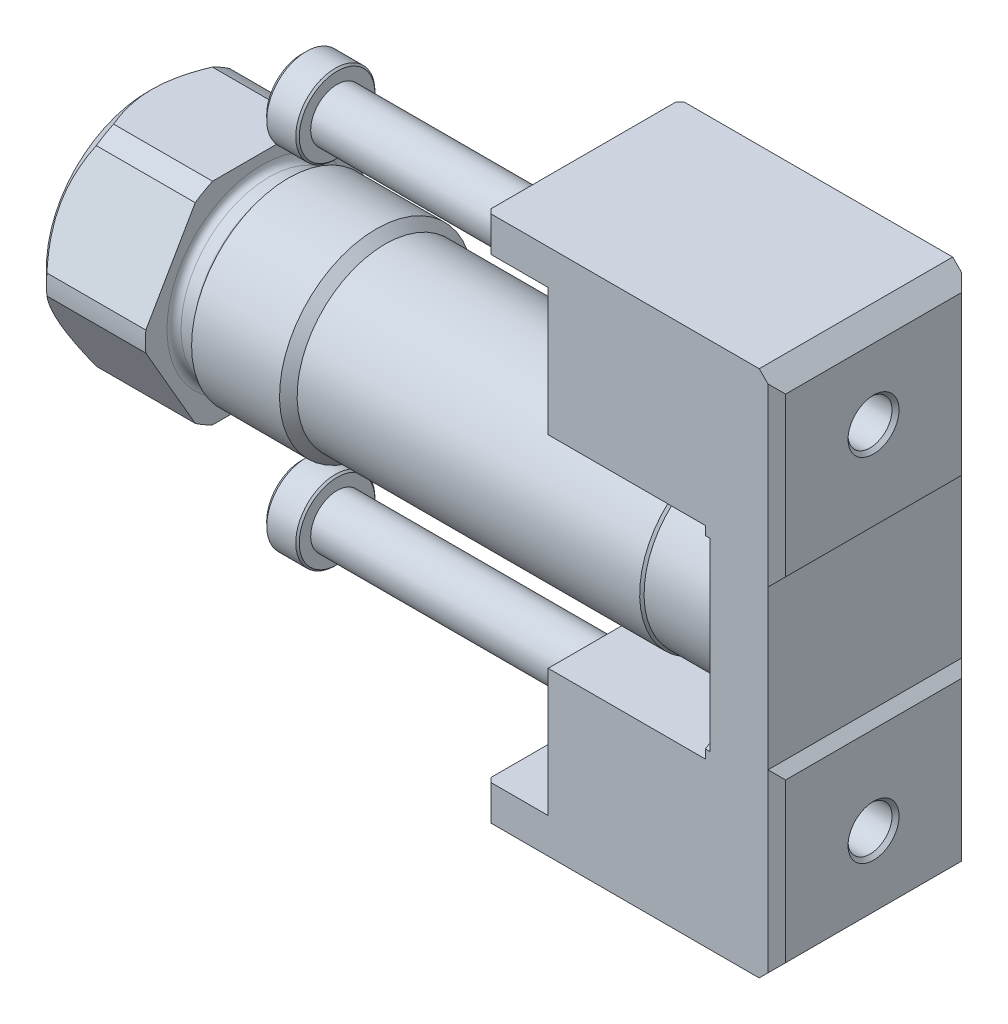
ISO-10303-21;
HEADER;
FILE_DESCRIPTION(('STEP AP214'),'2;1');
FILE_NAME('part.step','',(''),(''),'','','');
FILE_SCHEMA(('AUTOMOTIVE_DESIGN { 1 0 10303 214 1 1 1 1 }'));
ENDSEC;
DATA;
#1=APPLICATION_CONTEXT('core data for automotive mechanical design processes');
#2=APPLICATION_PROTOCOL_DEFINITION('international standard','automotive_design',2000,#1);
#3=PRODUCT_CONTEXT('',#1,'mechanical');
#4=PRODUCT('Part','Part','',(#3));
#5=PRODUCT_RELATED_PRODUCT_CATEGORY('part','',(#4));
#6=PRODUCT_DEFINITION_FORMATION('','',#4);
#7=PRODUCT_DEFINITION_CONTEXT('part definition',#1,'design');
#8=PRODUCT_DEFINITION('design','',#6,#7);
#9=PRODUCT_DEFINITION_SHAPE('','',#8);
#10=(LENGTH_UNIT() NAMED_UNIT(*) SI_UNIT(.MILLI.,.METRE.));
#11=(NAMED_UNIT(*) PLANE_ANGLE_UNIT() SI_UNIT($,.RADIAN.));
#12=(NAMED_UNIT(*) SI_UNIT($,.STERADIAN.) SOLID_ANGLE_UNIT());
#13=UNCERTAINTY_MEASURE_WITH_UNIT(LENGTH_MEASURE(1.E-05),#10,'distance_accuracy_value','');
#14=(GEOMETRIC_REPRESENTATION_CONTEXT(3) GLOBAL_UNCERTAINTY_ASSIGNED_CONTEXT((#13)) GLOBAL_UNIT_ASSIGNED_CONTEXT((#10,
#11,#12)) REPRESENTATION_CONTEXT('',''));
#15=CARTESIAN_POINT('',(0.,0.,0.));
#16=DIRECTION('',(0.,0.,1.));
#17=DIRECTION('',(1.,0.,0.));
#18=AXIS2_PLACEMENT_3D('',#15,#16,#17);
#19=CARTESIAN_POINT('',(-63.,18.5241982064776,0.906647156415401));
#20=DIRECTION('',(-1.,0.,0.));
#21=DIRECTION('',(0.,0.852054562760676,-0.523452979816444));
#22=AXIS2_PLACEMENT_3D('',#19,#20,#21);
#23=PLANE('',#22);
#24=DIRECTION('',(0.,0.0272962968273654,0.999627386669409));
#25=VECTOR('',#24,1.);
#26=CARTESIAN_POINT('',(-63.,18.4769196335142,-0.824758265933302));
#27=LINE('',#26,#25);
#28=CARTESIAN_POINT('',(-63.,18.4769196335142,-0.824758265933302));
#29=VERTEX_POINT('',#28);
#30=CARTESIAN_POINT('',(-63.,18.5241982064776,0.906647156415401));
#31=VERTEX_POINT('',#30);
#32=EDGE_CURVE('E2123',#29,#31,#27,.T.);
#33=ORIENTED_EDGE('',*,*,#32,.T.);
#34=DIRECTION('',(0.,0.879350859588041,0.476174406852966));
#35=VECTOR('',#34,1.);
#36=CARTESIAN_POINT('',(-63.,18.5241982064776,0.906647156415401));
#37=LINE('',#36,#35);
#38=CARTESIAN_POINT('',(-63.,20.0472785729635,1.7314054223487));
#39=VERTEX_POINT('',#38);
#40=EDGE_CURVE('E2125',#31,#39,#37,.T.);
#41=ORIENTED_EDGE('',*,*,#40,.T.);
#42=DIRECTION('',(0.,0.852054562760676,-0.523452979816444));
#43=VECTOR('',#42,1.);
#44=CARTESIAN_POINT('',(-63.,20.0472785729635,1.7314054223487));
#45=LINE('',#44,#43);
#46=CARTESIAN_POINT('',(-63.,21.5230803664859,0.824758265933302));
#47=VERTEX_POINT('',#46);
#48=EDGE_CURVE('E2129',#39,#47,#45,.T.);
#49=ORIENTED_EDGE('',*,*,#48,.T.);
#50=DIRECTION('',(0.,-0.0272962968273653,-0.999627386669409));
#51=VECTOR('',#50,1.);
#52=CARTESIAN_POINT('',(-63.,21.5230803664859,0.824758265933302));
#53=LINE('',#52,#51);
#54=CARTESIAN_POINT('',(-63.,21.4758017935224,-0.906647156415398));
#55=VERTEX_POINT('',#54);
#56=EDGE_CURVE('E2132',#47,#55,#53,.T.);
#57=ORIENTED_EDGE('',*,*,#56,.T.);
#58=DIRECTION('',(0.,-0.879350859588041,-0.476174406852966));
#59=VECTOR('',#58,1.);
#60=CARTESIAN_POINT('',(-63.,21.4758017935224,-0.906647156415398));
#61=LINE('',#60,#59);
#62=CARTESIAN_POINT('',(-63.,19.9527214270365,-1.7314054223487));
#63=VERTEX_POINT('',#62);
#64=EDGE_CURVE('E2135',#55,#63,#61,.T.);
#65=ORIENTED_EDGE('',*,*,#64,.T.);
#66=DIRECTION('',(0.,-0.852054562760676,0.523452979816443));
#67=VECTOR('',#66,1.);
#68=CARTESIAN_POINT('',(-63.,19.9527214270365,-1.7314054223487));
#69=LINE('',#68,#67);
#70=EDGE_CURVE('E2138',#63,#29,#69,.T.);
#71=ORIENTED_EDGE('',*,*,#70,.T.);
#72=EDGE_LOOP('',(#33,#41,#49,#57,#65,#71));
#73=FACE_BOUND('',#72,.T.);
#74=ADVANCED_FACE('F14',(#73),#23,.T.);
#75=CARTESIAN_POINT('',(-63.,-21.4758017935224,0.906647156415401));
#76=DIRECTION('',(-1.,0.,0.));
#77=DIRECTION('',(0.,0.852054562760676,-0.523452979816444));
#78=AXIS2_PLACEMENT_3D('',#75,#76,#77);
#79=PLANE('',#78);
#80=DIRECTION('',(0.,0.0272962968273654,0.999627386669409));
#81=VECTOR('',#80,1.);
#82=CARTESIAN_POINT('',(-63.,-21.5230803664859,-0.824758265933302));
#83=LINE('',#82,#81);
#84=CARTESIAN_POINT('',(-63.,-21.5230803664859,-0.824758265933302));
#85=VERTEX_POINT('',#84);
#86=CARTESIAN_POINT('',(-63.,-21.4758017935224,0.906647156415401));
#87=VERTEX_POINT('',#86);
#88=EDGE_CURVE('E2231',#85,#87,#83,.T.);
#89=ORIENTED_EDGE('',*,*,#88,.T.);
#90=DIRECTION('',(0.,0.879350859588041,0.476174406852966));
#91=VECTOR('',#90,1.);
#92=CARTESIAN_POINT('',(-63.,-21.4758017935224,0.906647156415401));
#93=LINE('',#92,#91);
#94=CARTESIAN_POINT('',(-63.,-19.9527214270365,1.7314054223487));
#95=VERTEX_POINT('',#94);
#96=EDGE_CURVE('E2256',#87,#95,#93,.T.);
#97=ORIENTED_EDGE('',*,*,#96,.T.);
#98=DIRECTION('',(0.,0.852054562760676,-0.523452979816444));
#99=VECTOR('',#98,1.);
#100=CARTESIAN_POINT('',(-63.,-19.9527214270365,1.7314054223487));
#101=LINE('',#100,#99);
#102=CARTESIAN_POINT('',(-63.,-18.4769196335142,0.824758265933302));
#103=VERTEX_POINT('',#102);
#104=EDGE_CURVE('E2253',#95,#103,#101,.T.);
#105=ORIENTED_EDGE('',*,*,#104,.T.);
#106=DIRECTION('',(0.,-0.0272962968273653,-0.999627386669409));
#107=VECTOR('',#106,1.);
#108=CARTESIAN_POINT('',(-63.,-18.4769196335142,0.824758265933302));
#109=LINE('',#108,#107);
#110=CARTESIAN_POINT('',(-63.,-18.5241982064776,-0.906647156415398));
#111=VERTEX_POINT('',#110);
#112=EDGE_CURVE('E2250',#103,#111,#109,.T.);
#113=ORIENTED_EDGE('',*,*,#112,.T.);
#114=DIRECTION('',(0.,-0.879350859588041,-0.476174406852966));
#115=VECTOR('',#114,1.);
#116=CARTESIAN_POINT('',(-63.,-18.5241982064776,-0.906647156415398));
#117=LINE('',#116,#115);
#118=CARTESIAN_POINT('',(-63.,-20.0472785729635,-1.7314054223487));
#119=VERTEX_POINT('',#118);
#120=EDGE_CURVE('E2247',#111,#119,#117,.T.);
#121=ORIENTED_EDGE('',*,*,#120,.T.);
#122=DIRECTION('',(0.,-0.852054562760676,0.523452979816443));
#123=VECTOR('',#122,1.);
#124=CARTESIAN_POINT('',(-63.,-20.0472785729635,-1.7314054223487));
#125=LINE('',#124,#123);
#126=EDGE_CURVE('E2215',#119,#85,#125,.T.);
#127=ORIENTED_EDGE('',*,*,#126,.T.);
#128=EDGE_LOOP('',(#89,#97,#105,#113,#121,#127));
#129=FACE_BOUND('',#128,.T.);
#130=ADVANCED_FACE('F600',(#129),#79,.T.);
#131=CARTESIAN_POINT('',(-63.,18.5241982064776,0.906647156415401));
#132=DIRECTION('',(0.,-0.476174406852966,0.879350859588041));
#133=DIRECTION('',(0.,0.879350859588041,0.476174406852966));
#134=AXIS2_PLACEMENT_3D('',#131,#132,#133);
#135=PLANE('',#134);
#136=DIRECTION('',(0.,0.879350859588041,0.476174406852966));
#137=VECTOR('',#136,1.);
#138=CARTESIAN_POINT('',(-65.,18.5241982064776,0.906647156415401));
#139=LINE('',#138,#137);
#140=CARTESIAN_POINT('',(-65.,18.5241982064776,0.906647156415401));
#141=VERTEX_POINT('',#140);
#142=CARTESIAN_POINT('',(-65.,20.0472785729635,1.7314054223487));
#143=VERTEX_POINT('',#142);
#144=EDGE_CURVE('E2143',#141,#143,#139,.T.);
#145=ORIENTED_EDGE('',*,*,#144,.T.);
#146=DIRECTION('',(-1.,0.,0.));
#147=VECTOR('',#146,1.);
#148=CARTESIAN_POINT('',(-63.,20.0472785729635,1.7314054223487));
#149=LINE('',#148,#147);
#150=EDGE_CURVE('E2166',#39,#143,#149,.T.);
#151=ORIENTED_EDGE('',*,*,#150,.F.);
#152=ORIENTED_EDGE('',*,*,#40,.F.);
#153=DIRECTION('',(-1.,0.,0.));
#154=VECTOR('',#153,1.);
#155=CARTESIAN_POINT('',(-63.,18.5241982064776,0.906647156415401));
#156=LINE('',#155,#154);
#157=EDGE_CURVE('E2141',#31,#141,#156,.T.);
#158=ORIENTED_EDGE('',*,*,#157,.T.);
#159=EDGE_LOOP('',(#145,#151,#152,#158));
#160=FACE_BOUND('',#159,.T.);
#161=ADVANCED_FACE('F607',(#160),#135,.F.);
#162=CARTESIAN_POINT('',(-63.,20.0472785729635,1.7314054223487));
#163=DIRECTION('',(0.,0.523452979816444,0.852054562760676));
#164=DIRECTION('',(0.,0.852054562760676,-0.523452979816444));
#165=AXIS2_PLACEMENT_3D('',#162,#163,#164);
#166=PLANE('',#165);
#167=DIRECTION('',(0.,0.852054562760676,-0.523452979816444));
#168=VECTOR('',#167,1.);
#169=CARTESIAN_POINT('',(-65.,20.0472785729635,1.7314054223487));
#170=LINE('',#169,#168);
#171=CARTESIAN_POINT('',(-65.,21.5230803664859,0.824758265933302));
#172=VERTEX_POINT('',#171);
#173=EDGE_CURVE('E2146',#143,#172,#170,.T.);
#174=ORIENTED_EDGE('',*,*,#173,.T.);
#175=DIRECTION('',(-1.,0.,0.));
#176=VECTOR('',#175,1.);
#177=CARTESIAN_POINT('',(-63.,21.5230803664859,0.824758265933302));
#178=LINE('',#177,#176);
#179=EDGE_CURVE('E2164',#47,#172,#178,.T.);
#180=ORIENTED_EDGE('',*,*,#179,.F.);
#181=ORIENTED_EDGE('',*,*,#48,.F.);
#182=ORIENTED_EDGE('',*,*,#150,.T.);
#183=EDGE_LOOP('',(#174,#180,#181,#182));
#184=FACE_BOUND('',#183,.T.);
#185=ADVANCED_FACE('F627',(#184),#166,.F.);
#186=CARTESIAN_POINT('',(-63.,21.5230803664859,0.824758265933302));
#187=DIRECTION('',(0.,0.999627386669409,-0.0272962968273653));
#188=DIRECTION('',(0.,-0.0272962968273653,-0.999627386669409));
#189=AXIS2_PLACEMENT_3D('',#186,#187,#188);
#190=PLANE('',#189);
#191=DIRECTION('',(0.,-0.0272962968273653,-0.999627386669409));
#192=VECTOR('',#191,1.);
#193=CARTESIAN_POINT('',(-65.,21.5230803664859,0.824758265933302));
#194=LINE('',#193,#192);
#195=CARTESIAN_POINT('',(-65.,21.4758017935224,-0.906647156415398));
#196=VERTEX_POINT('',#195);
#197=EDGE_CURVE('E2149',#172,#196,#194,.T.);
#198=ORIENTED_EDGE('',*,*,#197,.T.);
#199=DIRECTION('',(-1.,0.,0.));
#200=VECTOR('',#199,1.);
#201=CARTESIAN_POINT('',(-63.,21.4758017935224,-0.906647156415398));
#202=LINE('',#201,#200);
#203=EDGE_CURVE('E2162',#55,#196,#202,.T.);
#204=ORIENTED_EDGE('',*,*,#203,.F.);
#205=ORIENTED_EDGE('',*,*,#56,.F.);
#206=ORIENTED_EDGE('',*,*,#179,.T.);
#207=EDGE_LOOP('',(#198,#204,#205,#206));
#208=FACE_BOUND('',#207,.T.);
#209=ADVANCED_FACE('F623',(#208),#190,.F.);
#210=CARTESIAN_POINT('',(-63.,21.4758017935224,-0.906647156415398));
#211=DIRECTION('',(0.,0.476174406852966,-0.879350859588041));
#212=DIRECTION('',(0.,-0.879350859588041,-0.476174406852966));
#213=AXIS2_PLACEMENT_3D('',#210,#211,#212);
#214=PLANE('',#213);
#215=DIRECTION('',(0.,-0.879350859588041,-0.476174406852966));
#216=VECTOR('',#215,1.);
#217=CARTESIAN_POINT('',(-65.,21.4758017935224,-0.906647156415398));
#218=LINE('',#217,#216);
#219=CARTESIAN_POINT('',(-65.,19.9527214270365,-1.7314054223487));
#220=VERTEX_POINT('',#219);
#221=EDGE_CURVE('E2152',#196,#220,#218,.T.);
#222=ORIENTED_EDGE('',*,*,#221,.T.);
#223=DIRECTION('',(-1.,0.,0.));
#224=VECTOR('',#223,1.);
#225=CARTESIAN_POINT('',(-63.,19.9527214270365,-1.7314054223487));
#226=LINE('',#225,#224);
#227=EDGE_CURVE('E2160',#63,#220,#226,.T.);
#228=ORIENTED_EDGE('',*,*,#227,.F.);
#229=ORIENTED_EDGE('',*,*,#64,.F.);
#230=ORIENTED_EDGE('',*,*,#203,.T.);
#231=EDGE_LOOP('',(#222,#228,#229,#230));
#232=FACE_BOUND('',#231,.T.);
#233=ADVANCED_FACE('F619',(#232),#214,.F.);
#234=CARTESIAN_POINT('',(-63.,19.9527214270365,-1.7314054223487));
#235=DIRECTION('',(0.,-0.523452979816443,-0.852054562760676));
#236=DIRECTION('',(0.,-0.852054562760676,0.523452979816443));
#237=AXIS2_PLACEMENT_3D('',#234,#235,#236);
#238=PLANE('',#237);
#239=DIRECTION('',(0.,-0.852054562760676,0.523452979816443));
#240=VECTOR('',#239,1.);
#241=CARTESIAN_POINT('',(-65.,19.9527214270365,-1.7314054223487));
#242=LINE('',#241,#240);
#243=CARTESIAN_POINT('',(-65.,18.4769196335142,-0.824758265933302));
#244=VERTEX_POINT('',#243);
#245=EDGE_CURVE('E2126',#220,#244,#242,.T.);
#246=ORIENTED_EDGE('',*,*,#245,.T.);
#247=DIRECTION('',(-1.,0.,0.));
#248=VECTOR('',#247,1.);
#249=CARTESIAN_POINT('',(-63.,18.4769196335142,-0.824758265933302));
#250=LINE('',#249,#248);
#251=EDGE_CURVE('E2157',#29,#244,#250,.T.);
#252=ORIENTED_EDGE('',*,*,#251,.F.);
#253=ORIENTED_EDGE('',*,*,#70,.F.);
#254=ORIENTED_EDGE('',*,*,#227,.T.);
#255=EDGE_LOOP('',(#246,#252,#253,#254));
#256=FACE_BOUND('',#255,.T.);
#257=ADVANCED_FACE('F615',(#256),#238,.F.);
#258=CARTESIAN_POINT('',(-63.,18.4769196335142,-0.824758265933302));
#259=DIRECTION('',(0.,-0.999627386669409,0.0272962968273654));
#260=DIRECTION('',(0.,0.0272962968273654,0.999627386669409));
#261=AXIS2_PLACEMENT_3D('',#258,#259,#260);
#262=PLANE('',#261);
#263=DIRECTION('',(0.,0.0272962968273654,0.999627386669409));
#264=VECTOR('',#263,1.);
#265=CARTESIAN_POINT('',(-65.,18.4769196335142,-0.824758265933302));
#266=LINE('',#265,#264);
#267=EDGE_CURVE('E965',#244,#141,#266,.T.);
#268=ORIENTED_EDGE('',*,*,#267,.T.);
#269=ORIENTED_EDGE('',*,*,#157,.F.);
#270=ORIENTED_EDGE('',*,*,#32,.F.);
#271=ORIENTED_EDGE('',*,*,#251,.T.);
#272=EDGE_LOOP('',(#268,#269,#270,#271));
#273=FACE_BOUND('',#272,.T.);
#274=ADVANCED_FACE('F618',(#273),#262,.F.);
#275=CARTESIAN_POINT('',(-63.,-21.4758017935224,0.906647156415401));
#276=DIRECTION('',(0.,-0.476174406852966,0.879350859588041));
#277=DIRECTION('',(0.,0.879350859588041,0.476174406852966));
#278=AXIS2_PLACEMENT_3D('',#275,#276,#277);
#279=PLANE('',#278);
#280=DIRECTION('',(0.,0.879350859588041,0.476174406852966));
#281=VECTOR('',#280,1.);
#282=CARTESIAN_POINT('',(-65.,-21.4758017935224,0.906647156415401));
#283=LINE('',#282,#281);
#284=CARTESIAN_POINT('',(-65.,-21.4758017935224,0.906647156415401));
#285=VERTEX_POINT('',#284);
#286=CARTESIAN_POINT('',(-65.,-19.9527214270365,1.7314054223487));
#287=VERTEX_POINT('',#286);
#288=EDGE_CURVE('E2241',#285,#287,#283,.T.);
#289=ORIENTED_EDGE('',*,*,#288,.T.);
#290=DIRECTION('',(-1.,0.,0.));
#291=VECTOR('',#290,1.);
#292=CARTESIAN_POINT('',(-63.,-19.9527214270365,1.7314054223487));
#293=LINE('',#292,#291);
#294=EDGE_CURVE('E2214',#95,#287,#293,.T.);
#295=ORIENTED_EDGE('',*,*,#294,.F.);
#296=ORIENTED_EDGE('',*,*,#96,.F.);
#297=DIRECTION('',(-1.,0.,0.));
#298=VECTOR('',#297,1.);
#299=CARTESIAN_POINT('',(-63.,-21.4758017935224,0.906647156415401));
#300=LINE('',#299,#298);
#301=EDGE_CURVE('E2212',#87,#285,#300,.T.);
#302=ORIENTED_EDGE('',*,*,#301,.T.);
#303=EDGE_LOOP('',(#289,#295,#296,#302));
#304=FACE_BOUND('',#303,.T.);
#305=ADVANCED_FACE('F637',(#304),#279,.F.);
#306=CARTESIAN_POINT('',(-63.,-19.9527214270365,1.7314054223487));
#307=DIRECTION('',(0.,0.523452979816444,0.852054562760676));
#308=DIRECTION('',(0.,0.852054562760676,-0.523452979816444));
#309=AXIS2_PLACEMENT_3D('',#306,#307,#308);
#310=PLANE('',#309);
#311=DIRECTION('',(0.,0.852054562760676,-0.523452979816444));
#312=VECTOR('',#311,1.);
#313=CARTESIAN_POINT('',(-65.,-19.9527214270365,1.7314054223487));
#314=LINE('',#313,#312);
#315=CARTESIAN_POINT('',(-65.,-18.4769196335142,0.824758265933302));
#316=VERTEX_POINT('',#315);
#317=EDGE_CURVE('E2238',#287,#316,#314,.T.);
#318=ORIENTED_EDGE('',*,*,#317,.T.);
#319=DIRECTION('',(-1.,0.,0.));
#320=VECTOR('',#319,1.);
#321=CARTESIAN_POINT('',(-63.,-18.4769196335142,0.824758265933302));
#322=LINE('',#321,#320);
#323=EDGE_CURVE('E2218',#103,#316,#322,.T.);
#324=ORIENTED_EDGE('',*,*,#323,.F.);
#325=ORIENTED_EDGE('',*,*,#104,.F.);
#326=ORIENTED_EDGE('',*,*,#294,.T.);
#327=EDGE_LOOP('',(#318,#324,#325,#326));
#328=FACE_BOUND('',#327,.T.);
#329=ADVANCED_FACE('F1631',(#328),#310,.F.);
#330=CARTESIAN_POINT('',(-63.,-18.4769196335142,0.824758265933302));
#331=DIRECTION('',(0.,0.999627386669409,-0.0272962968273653));
#332=DIRECTION('',(0.,-0.0272962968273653,-0.999627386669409));
#333=AXIS2_PLACEMENT_3D('',#330,#331,#332);
#334=PLANE('',#333);
#335=DIRECTION('',(0.,-0.0272962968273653,-0.999627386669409));
#336=VECTOR('',#335,1.);
#337=CARTESIAN_POINT('',(-65.,-18.4769196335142,0.824758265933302));
#338=LINE('',#337,#336);
#339=CARTESIAN_POINT('',(-65.,-18.5241982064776,-0.906647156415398));
#340=VERTEX_POINT('',#339);
#341=EDGE_CURVE('E2235',#316,#340,#338,.T.);
#342=ORIENTED_EDGE('',*,*,#341,.T.);
#343=DIRECTION('',(-1.,0.,0.));
#344=VECTOR('',#343,1.);
#345=CARTESIAN_POINT('',(-63.,-18.5241982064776,-0.906647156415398));
#346=LINE('',#345,#344);
#347=EDGE_CURVE('E2221',#111,#340,#346,.T.);
#348=ORIENTED_EDGE('',*,*,#347,.F.);
#349=ORIENTED_EDGE('',*,*,#112,.F.);
#350=ORIENTED_EDGE('',*,*,#323,.T.);
#351=EDGE_LOOP('',(#342,#348,#349,#350));
#352=FACE_BOUND('',#351,.T.);
#353=ADVANCED_FACE('F1639',(#352),#334,.F.);
#354=CARTESIAN_POINT('',(-63.,-18.5241982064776,-0.906647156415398));
#355=DIRECTION('',(0.,0.476174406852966,-0.879350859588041));
#356=DIRECTION('',(0.,-0.879350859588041,-0.476174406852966));
#357=AXIS2_PLACEMENT_3D('',#354,#355,#356);
#358=PLANE('',#357);
#359=DIRECTION('',(0.,-0.879350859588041,-0.476174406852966));
#360=VECTOR('',#359,1.);
#361=CARTESIAN_POINT('',(-65.,-18.5241982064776,-0.906647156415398));
#362=LINE('',#361,#360);
#363=CARTESIAN_POINT('',(-65.,-20.0472785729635,-1.7314054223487));
#364=VERTEX_POINT('',#363);
#365=EDGE_CURVE('E2232',#340,#364,#362,.T.);
#366=ORIENTED_EDGE('',*,*,#365,.T.);
#367=DIRECTION('',(-1.,0.,0.));
#368=VECTOR('',#367,1.);
#369=CARTESIAN_POINT('',(-63.,-20.0472785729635,-1.7314054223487));
#370=LINE('',#369,#368);
#371=EDGE_CURVE('E2224',#119,#364,#370,.T.);
#372=ORIENTED_EDGE('',*,*,#371,.F.);
#373=ORIENTED_EDGE('',*,*,#120,.F.);
#374=ORIENTED_EDGE('',*,*,#347,.T.);
#375=EDGE_LOOP('',(#366,#372,#373,#374));
#376=FACE_BOUND('',#375,.T.);
#377=ADVANCED_FACE('F1648',(#376),#358,.F.);
#378=CARTESIAN_POINT('',(-63.,-20.0472785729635,-1.7314054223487));
#379=DIRECTION('',(0.,-0.523452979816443,-0.852054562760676));
#380=DIRECTION('',(0.,-0.852054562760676,0.523452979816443));
#381=AXIS2_PLACEMENT_3D('',#378,#379,#380);
#382=PLANE('',#381);
#383=DIRECTION('',(0.,-0.852054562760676,0.523452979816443));
#384=VECTOR('',#383,1.);
#385=CARTESIAN_POINT('',(-65.,-20.0472785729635,-1.7314054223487));
#386=LINE('',#385,#384);
#387=CARTESIAN_POINT('',(-65.,-21.5230803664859,-0.824758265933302));
#388=VERTEX_POINT('',#387);
#389=EDGE_CURVE('E2228',#364,#388,#386,.T.);
#390=ORIENTED_EDGE('',*,*,#389,.T.);
#391=DIRECTION('',(-1.,0.,0.));
#392=VECTOR('',#391,1.);
#393=CARTESIAN_POINT('',(-63.,-21.5230803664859,-0.824758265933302));
#394=LINE('',#393,#392);
#395=EDGE_CURVE('E2211',#85,#388,#394,.T.);
#396=ORIENTED_EDGE('',*,*,#395,.F.);
#397=ORIENTED_EDGE('',*,*,#126,.F.);
#398=ORIENTED_EDGE('',*,*,#371,.T.);
#399=EDGE_LOOP('',(#390,#396,#397,#398));
#400=FACE_BOUND('',#399,.T.);
#401=ADVANCED_FACE('F1657',(#400),#382,.F.);
#402=CARTESIAN_POINT('',(-63.,-21.5230803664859,-0.824758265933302));
#403=DIRECTION('',(0.,-0.999627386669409,0.0272962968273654));
#404=DIRECTION('',(0.,0.0272962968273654,0.999627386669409));
#405=AXIS2_PLACEMENT_3D('',#402,#403,#404);
#406=PLANE('',#405);
#407=DIRECTION('',(0.,0.0272962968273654,0.999627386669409));
#408=VECTOR('',#407,1.);
#409=CARTESIAN_POINT('',(-65.,-21.5230803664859,-0.824758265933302));
#410=LINE('',#409,#408);
#411=EDGE_CURVE('E33',#388,#285,#410,.T.);
#412=ORIENTED_EDGE('',*,*,#411,.T.);
#413=ORIENTED_EDGE('',*,*,#301,.F.);
#414=ORIENTED_EDGE('',*,*,#88,.F.);
#415=ORIENTED_EDGE('',*,*,#395,.T.);
#416=EDGE_LOOP('',(#412,#413,#414,#415));
#417=FACE_BOUND('',#416,.T.);
#418=ADVANCED_FACE('F643',(#417),#406,.F.);
#419=CARTESIAN_POINT('',(-65.,20.,0.));
#420=DIRECTION('',(-1.,0.,0.));
#421=DIRECTION('',(0.,0.852054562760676,-0.523452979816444));
#422=AXIS2_PLACEMENT_3D('',#419,#420,#421);
#423=PLANE('',#422);
#424=CARTESIAN_POINT('',(-65.,20.,0.));
#425=DIRECTION('',(-1.,0.,0.));
#426=DIRECTION('',(0.,0.852054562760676,-0.523452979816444));
#427=AXIS2_PLACEMENT_3D('',#424,#425,#426);
#428=CIRCLE('',#427,4.);
#429=CARTESIAN_POINT('',(-65.,23.4082182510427,-2.09381191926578));
#430=VERTEX_POINT('',#429);
#431=EDGE_CURVE('E2175',#430,#430,#428,.T.);
#432=ORIENTED_EDGE('',*,*,#431,.T.);
#433=EDGE_LOOP('',(#432));
#434=FACE_BOUND('',#433,.T.);
#435=ORIENTED_EDGE('',*,*,#267,.F.);
#436=ORIENTED_EDGE('',*,*,#245,.F.);
#437=ORIENTED_EDGE('',*,*,#221,.F.);
#438=ORIENTED_EDGE('',*,*,#197,.F.);
#439=ORIENTED_EDGE('',*,*,#173,.F.);
#440=ORIENTED_EDGE('',*,*,#144,.F.);
#441=EDGE_LOOP('',(#435,#436,#437,#438,#439,#440));
#442=FACE_BOUND('',#441,.T.);
#443=ADVANCED_FACE('F639',(#434,#442),#423,.T.);
#444=CARTESIAN_POINT('',(-65.,-20.,0.));
#445=DIRECTION('',(-1.,0.,0.));
#446=DIRECTION('',(0.,0.852054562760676,-0.523452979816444));
#447=AXIS2_PLACEMENT_3D('',#444,#445,#446);
#448=PLANE('',#447);
#449=CARTESIAN_POINT('',(-65.,-20.,0.));
#450=DIRECTION('',(-1.,0.,0.));
#451=DIRECTION('',(0.,0.852054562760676,-0.523452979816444));
#452=AXIS2_PLACEMENT_3D('',#449,#450,#451);
#453=CIRCLE('',#452,4.);
#454=CARTESIAN_POINT('',(-65.,-16.5917817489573,-2.09381191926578));
#455=VERTEX_POINT('',#454);
#456=EDGE_CURVE('E2202',#455,#455,#453,.T.);
#457=ORIENTED_EDGE('',*,*,#456,.T.);
#458=EDGE_LOOP('',(#457));
#459=FACE_BOUND('',#458,.T.);
#460=ORIENTED_EDGE('',*,*,#411,.F.);
#461=ORIENTED_EDGE('',*,*,#389,.F.);
#462=ORIENTED_EDGE('',*,*,#365,.F.);
#463=ORIENTED_EDGE('',*,*,#341,.F.);
#464=ORIENTED_EDGE('',*,*,#317,.F.);
#465=ORIENTED_EDGE('',*,*,#288,.F.);
#466=EDGE_LOOP('',(#460,#461,#462,#463,#464,#465));
#467=FACE_BOUND('',#466,.T.);
#468=ADVANCED_FACE('F642',(#459,#467),#448,.T.);
#469=CARTESIAN_POINT('',(-64.5,20.,0.));
#470=DIRECTION('',(1.,0.,0.));
#471=DIRECTION('',(0.,-0.852054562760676,0.523452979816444));
#472=AXIS2_PLACEMENT_3D('',#469,#470,#471);
#473=CONICAL_SURFACE('',#472,4.5,0.785398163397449);
#474=ORIENTED_EDGE('',*,*,#431,.F.);
#475=EDGE_LOOP('',(#474));
#476=FACE_BOUND('',#475,.T.);
#477=CARTESIAN_POINT('',(-64.5,20.,0.));
#478=DIRECTION('',(-1.,0.,0.));
#479=DIRECTION('',(0.,0.852054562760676,-0.523452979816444));
#480=AXIS2_PLACEMENT_3D('',#477,#478,#479);
#481=CIRCLE('',#480,4.5);
#482=CARTESIAN_POINT('',(-64.5,23.834245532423,-2.355538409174));
#483=VERTEX_POINT('',#482);
#484=EDGE_CURVE('E2172',#483,#483,#481,.F.);
#485=ORIENTED_EDGE('',*,*,#484,.F.);
#486=EDGE_LOOP('',(#485));
#487=FACE_BOUND('',#486,.T.);
#488=ADVANCED_FACE('F663',(#476,#487),#473,.T.);
#489=CARTESIAN_POINT('',(-64.5,-20.,0.));
#490=DIRECTION('',(1.,0.,0.));
#491=DIRECTION('',(0.,-0.852054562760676,0.523452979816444));
#492=AXIS2_PLACEMENT_3D('',#489,#490,#491);
#493=CONICAL_SURFACE('',#492,4.5,0.785398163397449);
#494=ORIENTED_EDGE('',*,*,#456,.F.);
#495=EDGE_LOOP('',(#494));
#496=FACE_BOUND('',#495,.T.);
#497=CARTESIAN_POINT('',(-64.5,-20.,0.));
#498=DIRECTION('',(-1.,0.,0.));
#499=DIRECTION('',(0.,0.852054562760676,-0.523452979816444));
#500=AXIS2_PLACEMENT_3D('',#497,#498,#499);
#501=CIRCLE('',#500,4.5);
#502=CARTESIAN_POINT('',(-64.5,-16.165754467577,-2.355538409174));
#503=VERTEX_POINT('',#502);
#504=EDGE_CURVE('E2205',#503,#503,#501,.F.);
#505=ORIENTED_EDGE('',*,*,#504,.F.);
#506=EDGE_LOOP('',(#505));
#507=FACE_BOUND('',#506,.T.);
#508=ADVANCED_FACE('F661',(#496,#507),#493,.T.);
#509=CARTESIAN_POINT('',(-61.,20.,0.));
#510=DIRECTION('',(1.,0.,0.));
#511=DIRECTION('',(0.,-0.852054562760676,0.523452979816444));
#512=AXIS2_PLACEMENT_3D('',#509,#510,#511);
#513=CYLINDRICAL_SURFACE('',#512,4.5);
#514=CARTESIAN_POINT('',(-61.2,20.,0.));
#515=DIRECTION('',(1.,0.,0.));
#516=DIRECTION('',(0.,-0.852054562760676,0.523452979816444));
#517=AXIS2_PLACEMENT_3D('',#514,#515,#516);
#518=CIRCLE('',#517,4.5);
#519=CARTESIAN_POINT('',(-61.2,16.165754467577,2.355538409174));
#520=VERTEX_POINT('',#519);
#521=EDGE_CURVE('E1796',#520,#520,#518,.F.);
#522=ORIENTED_EDGE('',*,*,#521,.T.);
#523=EDGE_LOOP('',(#522));
#524=FACE_BOUND('',#523,.T.);
#525=ORIENTED_EDGE('',*,*,#484,.T.);
#526=EDGE_LOOP('',(#525));
#527=FACE_BOUND('',#526,.T.);
#528=ADVANCED_FACE('F657',(#524,#527),#513,.T.);
#529=CARTESIAN_POINT('',(-61.,-20.,0.));
#530=DIRECTION('',(1.,0.,0.));
#531=DIRECTION('',(0.,-0.852054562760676,0.523452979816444));
#532=AXIS2_PLACEMENT_3D('',#529,#530,#531);
#533=CYLINDRICAL_SURFACE('',#532,4.5);
#534=CARTESIAN_POINT('',(-61.2,-20.,0.));
#535=DIRECTION('',(1.,0.,0.));
#536=DIRECTION('',(0.,-0.852054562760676,0.523452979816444));
#537=AXIS2_PLACEMENT_3D('',#534,#535,#536);
#538=CIRCLE('',#537,4.5);
#539=CARTESIAN_POINT('',(-61.2,-23.834245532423,2.355538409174));
#540=VERTEX_POINT('',#539);
#541=EDGE_CURVE('E2116',#540,#540,#538,.F.);
#542=ORIENTED_EDGE('',*,*,#541,.T.);
#543=EDGE_LOOP('',(#542));
#544=FACE_BOUND('',#543,.T.);
#545=ORIENTED_EDGE('',*,*,#504,.T.);
#546=EDGE_LOOP('',(#545));
#547=FACE_BOUND('',#546,.T.);
#548=ADVANCED_FACE('F660',(#544,#547),#533,.T.);
#549=CARTESIAN_POINT('',(-61.,20.,0.));
#550=DIRECTION('',(-1.,0.,0.));
#551=DIRECTION('',(0.,0.852054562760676,-0.523452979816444));
#552=AXIS2_PLACEMENT_3D('',#549,#550,#551);
#553=CONICAL_SURFACE('',#552,4.3,0.785398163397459);
#554=ORIENTED_EDGE('',*,*,#521,.F.);
#555=EDGE_LOOP('',(#554));
#556=FACE_BOUND('',#555,.T.);
#557=CARTESIAN_POINT('',(-61.,20.,0.));
#558=DIRECTION('',(1.,0.,0.));
#559=DIRECTION('',(0.,-0.852054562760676,0.523452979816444));
#560=AXIS2_PLACEMENT_3D('',#557,#558,#559);
#561=CIRCLE('',#560,4.3);
#562=CARTESIAN_POINT('',(-61.,16.3361653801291,2.25084781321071));
#563=VERTEX_POINT('',#562);
#564=EDGE_CURVE('E1801',#563,#563,#561,.T.);
#565=ORIENTED_EDGE('',*,*,#564,.F.);
#566=EDGE_LOOP('',(#565));
#567=FACE_BOUND('',#566,.T.);
#568=ADVANCED_FACE('F667',(#556,#567),#553,.T.);
#569=CARTESIAN_POINT('',(-8.,20.,0.));
#570=DIRECTION('',(1.,0.,0.));
#571=DIRECTION('',(0.,1.,0.));
#572=AXIS2_PLACEMENT_3D('',#569,#570,#571);
#573=PLANE('',#572);
#574=CARTESIAN_POINT('',(-8.,20.,0.));
#575=DIRECTION('',(1.,0.,0.));
#576=DIRECTION('',(0.,1.,0.));
#577=AXIS2_PLACEMENT_3D('',#574,#575,#576);
#578=CIRCLE('',#577,2.5);
#579=CARTESIAN_POINT('',(-8.,22.5,0.));
#580=VERTEX_POINT('',#579);
#581=EDGE_CURVE('E1805',#580,#580,#578,.T.);
#582=ORIENTED_EDGE('',*,*,#581,.T.);
#583=EDGE_LOOP('',(#582));
#584=FACE_BOUND('',#583,.T.);
#585=ADVANCED_FACE('F670',(#584),#573,.T.);
#586=CARTESIAN_POINT('',(-8.,-20.,0.));
#587=DIRECTION('',(1.,0.,0.));
#588=DIRECTION('',(0.,1.,0.));
#589=AXIS2_PLACEMENT_3D('',#586,#587,#588);
#590=PLANE('',#589);
#591=CARTESIAN_POINT('',(-8.,-20.,0.));
#592=DIRECTION('',(1.,0.,0.));
#593=DIRECTION('',(0.,1.,0.));
#594=AXIS2_PLACEMENT_3D('',#591,#592,#593);
#595=CIRCLE('',#594,2.5);
#596=CARTESIAN_POINT('',(-8.,-17.5,0.));
#597=VERTEX_POINT('',#596);
#598=EDGE_CURVE('E939',#597,#597,#595,.T.);
#599=ORIENTED_EDGE('',*,*,#598,.T.);
#600=EDGE_LOOP('',(#599));
#601=FACE_BOUND('',#600,.T.);
#602=ADVANCED_FACE('F678',(#601),#590,.T.);
#603=CARTESIAN_POINT('',(-61.,-20.,0.));
#604=DIRECTION('',(-1.,0.,0.));
#605=DIRECTION('',(0.,0.852054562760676,-0.523452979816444));
#606=AXIS2_PLACEMENT_3D('',#603,#604,#605);
#607=CONICAL_SURFACE('',#606,4.3,0.785398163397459);
#608=ORIENTED_EDGE('',*,*,#541,.F.);
#609=EDGE_LOOP('',(#608));
#610=FACE_BOUND('',#609,.T.);
#611=CARTESIAN_POINT('',(-61.,-20.,0.));
#612=DIRECTION('',(1.,0.,0.));
#613=DIRECTION('',(0.,-0.852054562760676,0.523452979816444));
#614=AXIS2_PLACEMENT_3D('',#611,#612,#613);
#615=CIRCLE('',#614,4.3);
#616=CARTESIAN_POINT('',(-61.,-23.6638346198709,2.25084781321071));
#617=VERTEX_POINT('',#616);
#618=EDGE_CURVE('E2119',#617,#617,#615,.T.);
#619=ORIENTED_EDGE('',*,*,#618,.F.);
#620=EDGE_LOOP('',(#619));
#621=FACE_BOUND('',#620,.T.);
#622=ADVANCED_FACE('F655',(#610,#621),#607,.T.);
#623=CARTESIAN_POINT('',(-61.,18.4296410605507,-2.55616368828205));
#624=DIRECTION('',(1.,0.,0.));
#625=DIRECTION('',(0.,-0.852054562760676,0.523452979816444));
#626=AXIS2_PLACEMENT_3D('',#623,#624,#625);
#627=PLANE('',#626);
#628=ORIENTED_EDGE('',*,*,#564,.T.);
#629=EDGE_LOOP('',(#628));
#630=FACE_BOUND('',#629,.T.);
#631=CARTESIAN_POINT('',(-61.,20.,0.));
#632=DIRECTION('',(1.,0.,0.));
#633=DIRECTION('',(0.,-0.852054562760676,0.523452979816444));
#634=AXIS2_PLACEMENT_3D('',#631,#632,#633);
#635=CIRCLE('',#634,3.);
#636=CARTESIAN_POINT('',(-61.,17.443836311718,1.57035893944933));
#637=VERTEX_POINT('',#636);
#638=EDGE_CURVE('E2159',#637,#637,#635,.T.);
#639=ORIENTED_EDGE('',*,*,#638,.F.);
#640=EDGE_LOOP('',(#639));
#641=FACE_BOUND('',#640,.T.);
#642=ADVANCED_FACE('F651',(#630,#641),#627,.T.);
#643=CARTESIAN_POINT('',(-8.,20.,0.));
#644=DIRECTION('',(1.,0.,0.));
#645=DIRECTION('',(0.,1.,0.));
#646=AXIS2_PLACEMENT_3D('',#643,#644,#645);
#647=CYLINDRICAL_SURFACE('',#646,2.5);
#648=ORIENTED_EDGE('',*,*,#581,.F.);
#649=EDGE_LOOP('',(#648));
#650=FACE_BOUND('',#649,.T.);
#651=CARTESIAN_POINT('',(-0.4,20.,0.));
#652=DIRECTION('',(1.,0.,0.));
#653=DIRECTION('',(0.,1.,0.));
#654=AXIS2_PLACEMENT_3D('',#651,#652,#653);
#655=CIRCLE('',#654,2.5);
#656=CARTESIAN_POINT('',(-0.4,22.5,0.));
#657=VERTEX_POINT('',#656);
#658=EDGE_CURVE('E1808',#657,#657,#655,.F.);
#659=ORIENTED_EDGE('',*,*,#658,.F.);
#660=EDGE_LOOP('',(#659));
#661=FACE_BOUND('',#660,.T.);
#662=ADVANCED_FACE('F654',(#650,#661),#647,.F.);
#663=CARTESIAN_POINT('',(-8.,-20.,0.));
#664=DIRECTION('',(1.,0.,0.));
#665=DIRECTION('',(0.,1.,0.));
#666=AXIS2_PLACEMENT_3D('',#663,#664,#665);
#667=CYLINDRICAL_SURFACE('',#666,2.5);
#668=ORIENTED_EDGE('',*,*,#598,.F.);
#669=EDGE_LOOP('',(#668));
#670=FACE_BOUND('',#669,.T.);
#671=CARTESIAN_POINT('',(-0.4,-20.,0.));
#672=DIRECTION('',(1.,0.,0.));
#673=DIRECTION('',(0.,1.,0.));
#674=AXIS2_PLACEMENT_3D('',#671,#672,#673);
#675=CIRCLE('',#674,2.5);
#676=CARTESIAN_POINT('',(-0.4,-17.5,0.));
#677=VERTEX_POINT('',#676);
#678=EDGE_CURVE('E941',#677,#677,#675,.F.);
#679=ORIENTED_EDGE('',*,*,#678,.F.);
#680=EDGE_LOOP('',(#679));
#681=FACE_BOUND('',#680,.T.);
#682=ADVANCED_FACE('F682',(#670,#681),#667,.F.);
#683=CARTESIAN_POINT('',(-61.,-21.5703589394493,-2.55616368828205));
#684=DIRECTION('',(1.,0.,0.));
#685=DIRECTION('',(0.,-0.852054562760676,0.523452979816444));
#686=AXIS2_PLACEMENT_3D('',#683,#684,#685);
#687=PLANE('',#686);
#688=ORIENTED_EDGE('',*,*,#618,.T.);
#689=EDGE_LOOP('',(#688));
#690=FACE_BOUND('',#689,.T.);
#691=CARTESIAN_POINT('',(-61.,-20.,0.));
#692=DIRECTION('',(1.,0.,0.));
#693=DIRECTION('',(0.,-0.852054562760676,0.523452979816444));
#694=AXIS2_PLACEMENT_3D('',#691,#692,#693);
#695=CIRCLE('',#694,3.);
#696=CARTESIAN_POINT('',(-61.,-22.556163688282,1.57035893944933));
#697=VERTEX_POINT('',#696);
#698=EDGE_CURVE('E2208',#697,#697,#695,.T.);
#699=ORIENTED_EDGE('',*,*,#698,.F.);
#700=EDGE_LOOP('',(#699));
#701=FACE_BOUND('',#700,.T.);
#702=ADVANCED_FACE('F649',(#690,#701),#687,.T.);
#703=CARTESIAN_POINT('',(-61.,20.,0.));
#704=DIRECTION('',(1.,0.,0.));
#705=DIRECTION('',(0.,-0.852054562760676,0.523452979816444));
#706=AXIS2_PLACEMENT_3D('',#703,#704,#705);
#707=CYLINDRICAL_SURFACE('',#706,3.);
#708=CARTESIAN_POINT('',(-26.2,20.,0.));
#709=DIRECTION('',(1.,0.,0.));
#710=DIRECTION('',(0.,-0.852054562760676,0.523452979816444));
#711=AXIS2_PLACEMENT_3D('',#708,#709,#710);
#712=CIRCLE('',#711,3.);
#713=CARTESIAN_POINT('',(-26.2,17.443836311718,1.57035893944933));
#714=VERTEX_POINT('',#713);
#715=EDGE_CURVE('E1795',#714,#714,#712,.F.);
#716=ORIENTED_EDGE('',*,*,#715,.T.);
#717=EDGE_LOOP('',(#716));
#718=FACE_BOUND('',#717,.T.);
#719=ORIENTED_EDGE('',*,*,#638,.T.);
#720=EDGE_LOOP('',(#719));
#721=FACE_BOUND('',#720,.T.);
#722=ADVANCED_FACE('F645',(#718,#721),#707,.T.);
#723=CARTESIAN_POINT('',(0.,20.,0.));
#724=DIRECTION('',(1.,0.,0.));
#725=DIRECTION('',(0.,1.,0.));
#726=AXIS2_PLACEMENT_3D('',#723,#724,#725);
#727=CONICAL_SURFACE('',#726,2.9,0.785398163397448);
#728=ORIENTED_EDGE('',*,*,#658,.T.);
#729=EDGE_LOOP('',(#728));
#730=FACE_BOUND('',#729,.T.);
#731=CARTESIAN_POINT('',(0.,20.,0.));
#732=DIRECTION('',(1.,0.,0.));
#733=DIRECTION('',(0.,1.,0.));
#734=AXIS2_PLACEMENT_3D('',#731,#732,#733);
#735=CIRCLE('',#734,2.9);
#736=CARTESIAN_POINT('',(0.,22.9,0.));
#737=VERTEX_POINT('',#736);
#738=EDGE_CURVE('E1871',#737,#737,#735,.T.);
#739=ORIENTED_EDGE('',*,*,#738,.T.);
#740=EDGE_LOOP('',(#739));
#741=FACE_BOUND('',#740,.T.);
#742=ADVANCED_FACE('F648',(#730,#741),#727,.F.);
#743=CARTESIAN_POINT('',(0.,-20.,0.));
#744=DIRECTION('',(1.,0.,0.));
#745=DIRECTION('',(0.,1.,0.));
#746=AXIS2_PLACEMENT_3D('',#743,#744,#745);
#747=CONICAL_SURFACE('',#746,2.9,0.785398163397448);
#748=ORIENTED_EDGE('',*,*,#678,.T.);
#749=EDGE_LOOP('',(#748));
#750=FACE_BOUND('',#749,.T.);
#751=CARTESIAN_POINT('',(0.,-20.,0.));
#752=DIRECTION('',(1.,0.,0.));
#753=DIRECTION('',(0.,1.,0.));
#754=AXIS2_PLACEMENT_3D('',#751,#752,#753);
#755=CIRCLE('',#754,2.9);
#756=CARTESIAN_POINT('',(0.,-17.1,0.));
#757=VERTEX_POINT('',#756);
#758=EDGE_CURVE('E1879',#757,#757,#755,.T.);
#759=ORIENTED_EDGE('',*,*,#758,.T.);
#760=EDGE_LOOP('',(#759));
#761=FACE_BOUND('',#760,.T.);
#762=ADVANCED_FACE('F728',(#750,#761),#747,.F.);
#763=CARTESIAN_POINT('',(-61.,-20.,0.));
#764=DIRECTION('',(1.,0.,0.));
#765=DIRECTION('',(0.,-0.852054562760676,0.523452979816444));
#766=AXIS2_PLACEMENT_3D('',#763,#764,#765);
#767=CYLINDRICAL_SURFACE('',#766,3.);
#768=CARTESIAN_POINT('',(-26.2,-20.,0.));
#769=DIRECTION('',(1.,0.,0.));
#770=DIRECTION('',(0.,-0.852054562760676,0.523452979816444));
#771=AXIS2_PLACEMENT_3D('',#768,#769,#770);
#772=CIRCLE('',#771,3.);
#773=CARTESIAN_POINT('',(-26.2,-22.556163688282,1.57035893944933));
#774=VERTEX_POINT('',#773);
#775=EDGE_CURVE('E9',#774,#774,#772,.F.);
#776=ORIENTED_EDGE('',*,*,#775,.T.);
#777=EDGE_LOOP('',(#776));
#778=FACE_BOUND('',#777,.T.);
#779=ORIENTED_EDGE('',*,*,#698,.T.);
#780=EDGE_LOOP('',(#779));
#781=FACE_BOUND('',#780,.T.);
#782=ADVANCED_FACE('F676',(#778,#781),#767,.T.);
#783=CARTESIAN_POINT('',(-26.,20.,0.));
#784=DIRECTION('',(-1.,0.,0.));
#785=DIRECTION('',(0.,0.852054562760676,-0.523452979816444));
#786=AXIS2_PLACEMENT_3D('',#783,#784,#785);
#787=CONICAL_SURFACE('',#786,2.8,0.785398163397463);
#788=ORIENTED_EDGE('',*,*,#715,.F.);
#789=EDGE_LOOP('',(#788));
#790=FACE_BOUND('',#789,.T.);
#791=CARTESIAN_POINT('',(-26.,20.,0.));
#792=DIRECTION('',(1.,0.,0.));
#793=DIRECTION('',(0.,-0.852054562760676,0.523452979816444));
#794=AXIS2_PLACEMENT_3D('',#791,#792,#793);
#795=CIRCLE('',#794,2.8);
#796=CARTESIAN_POINT('',(-26.,17.6142472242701,1.46566834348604));
#797=VERTEX_POINT('',#796);
#798=EDGE_CURVE('E1793',#797,#797,#795,.T.);
#799=ORIENTED_EDGE('',*,*,#798,.F.);
#800=EDGE_LOOP('',(#799));
#801=FACE_BOUND('',#800,.T.);
#802=ADVANCED_FACE('F672',(#790,#801),#787,.T.);
#803=CARTESIAN_POINT('',(-33.,30.,11.));
#804=DIRECTION('',(1.,0.,0.));
#805=DIRECTION('',(0.,1.,0.));
#806=AXIS2_PLACEMENT_3D('',#803,#804,#805);
#807=PLANE('',#806);
#808=DIRECTION('',(0.,0.,-1.));
#809=VECTOR('',#808,1.);
#810=CARTESIAN_POINT('',(-33.,30.,11.));
#811=LINE('',#810,#809);
#812=CARTESIAN_POINT('',(-33.,30.,10.5));
#813=VERTEX_POINT('',#812);
#814=CARTESIAN_POINT('',(-33.,30.,-10.5));
#815=VERTEX_POINT('',#814);
#816=EDGE_CURVE('E1941',#813,#815,#811,.T.);
#817=ORIENTED_EDGE('',*,*,#816,.T.);
#818=DIRECTION('',(0.,-1.,0.));
#819=VECTOR('',#818,1.);
#820=CARTESIAN_POINT('',(-33.,26.,-10.5));
#821=LINE('',#820,#819);
#822=CARTESIAN_POINT('',(-33.,26.,-10.5));
#823=VERTEX_POINT('',#822);
#824=EDGE_CURVE('E1970',#815,#823,#821,.T.);
#825=ORIENTED_EDGE('',*,*,#824,.T.);
#826=DIRECTION('',(0.,0.,-1.));
#827=VECTOR('',#826,1.);
#828=CARTESIAN_POINT('',(-33.,26.,11.));
#829=LINE('',#828,#827);
#830=CARTESIAN_POINT('',(-33.,26.,10.5));
#831=VERTEX_POINT('',#830);
#832=EDGE_CURVE('E1938',#831,#823,#829,.T.);
#833=ORIENTED_EDGE('',*,*,#832,.F.);
#834=DIRECTION('',(0.,1.,0.));
#835=VECTOR('',#834,1.);
#836=CARTESIAN_POINT('',(-33.,30.,10.5));
#837=LINE('',#836,#835);
#838=EDGE_CURVE('E1968',#831,#813,#837,.T.);
#839=ORIENTED_EDGE('',*,*,#838,.T.);
#840=EDGE_LOOP('',(#817,#825,#833,#839));
#841=FACE_BOUND('',#840,.T.);
#842=ADVANCED_FACE('F675',(#841),#807,.F.);
#843=CARTESIAN_POINT('',(0.,30.,11.));
#844=DIRECTION('',(-1.,0.,0.));
#845=DIRECTION('',(0.,-1.,0.));
#846=AXIS2_PLACEMENT_3D('',#843,#844,#845);
#847=PLANE('',#846);
#848=ORIENTED_EDGE('',*,*,#738,.F.);
#849=EDGE_LOOP('',(#848));
#850=FACE_BOUND('',#849,.T.);
#851=DIRECTION('',(0.,0.,1.));
#852=VECTOR('',#851,1.);
#853=CARTESIAN_POINT('',(0.,10.,-11.));
#854=LINE('',#853,#852);
#855=CARTESIAN_POINT('',(0.,10.,-10.));
#856=VERTEX_POINT('',#855);
#857=CARTESIAN_POINT('',(0.,10.,10.));
#858=VERTEX_POINT('',#857);
#859=EDGE_CURVE('E1886',#856,#858,#854,.T.);
#860=ORIENTED_EDGE('',*,*,#859,.F.);
#861=DIRECTION('',(0.,1.,0.));
#862=VECTOR('',#861,1.);
#863=CARTESIAN_POINT('',(0.,28.,-10.));
#864=LINE('',#863,#862);
#865=CARTESIAN_POINT('',(0.,28.,-10.));
#866=VERTEX_POINT('',#865);
#867=EDGE_CURVE('E2005',#856,#866,#864,.T.);
#868=ORIENTED_EDGE('',*,*,#867,.T.);
#869=DIRECTION('',(0.,0.,1.));
#870=VECTOR('',#869,1.);
#871=CARTESIAN_POINT('',(0.,28.,11.));
#872=LINE('',#871,#870);
#873=CARTESIAN_POINT('',(0.,28.,10.));
#874=VERTEX_POINT('',#873);
#875=EDGE_CURVE('E2000',#866,#874,#872,.T.);
#876=ORIENTED_EDGE('',*,*,#875,.T.);
#877=DIRECTION('',(0.,-1.,0.));
#878=VECTOR('',#877,1.);
#879=CARTESIAN_POINT('',(0.,30.,10.));
#880=LINE('',#879,#878);
#881=EDGE_CURVE('E2003',#874,#858,#880,.T.);
#882=ORIENTED_EDGE('',*,*,#881,.T.);
#883=EDGE_LOOP('',(#860,#868,#876,#882));
#884=FACE_BOUND('',#883,.T.);
#885=ADVANCED_FACE('F747',(#850,#884),#847,.F.);
#886=CARTESIAN_POINT('',(0.,10.,-11.));
#887=DIRECTION('',(-0.707106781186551,0.707106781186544,0.));
#888=DIRECTION('',(-0.707106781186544,-0.707106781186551,0.));
#889=AXIS2_PLACEMENT_3D('',#886,#887,#888);
#890=PLANE('',#889);
#891=DIRECTION('',(0.,0.,1.));
#892=VECTOR('',#891,1.);
#893=CARTESIAN_POINT('',(-1.,9.,-11.));
#894=LINE('',#893,#892);
#895=CARTESIAN_POINT('',(-1.,9.,-11.));
#896=VERTEX_POINT('',#895);
#897=CARTESIAN_POINT('',(-1.,9.,11.));
#898=VERTEX_POINT('',#897);
#899=EDGE_CURVE('E1896',#896,#898,#894,.T.);
#900=ORIENTED_EDGE('',*,*,#899,.F.);
#901=DIRECTION('',(0.577350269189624,0.577350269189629,0.577350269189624));
#902=VECTOR('',#901,1.);
#903=CARTESIAN_POINT('',(6.66666666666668,16.6666666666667,-3.3333333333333));
#904=LINE('',#903,#902);
#905=EDGE_CURVE('E2018',#896,#856,#904,.T.);
#906=ORIENTED_EDGE('',*,*,#905,.T.);
#907=ORIENTED_EDGE('',*,*,#859,.T.);
#908=DIRECTION('',(0.577350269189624,0.577350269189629,-0.577350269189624));
#909=VECTOR('',#908,1.);
#910=CARTESIAN_POINT('',(-14.,-4.00000000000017,24.));
#911=LINE('',#910,#909);
#912=EDGE_CURVE('E2016',#858,#898,#911,.F.);
#913=ORIENTED_EDGE('',*,*,#912,.T.);
#914=EDGE_LOOP('',(#900,#906,#907,#913));
#915=FACE_BOUND('',#914,.T.);
#916=ADVANCED_FACE('F737',(#915),#890,.F.);
#917=CARTESIAN_POINT('',(0.,-10.,-11.));
#918=DIRECTION('',(-0.707106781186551,-0.707106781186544,0.));
#919=DIRECTION('',(0.707106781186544,-0.707106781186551,0.));
#920=AXIS2_PLACEMENT_3D('',#917,#918,#919);
#921=PLANE('',#920);
#922=DIRECTION('',(0.,0.,1.));
#923=VECTOR('',#922,1.);
#924=CARTESIAN_POINT('',(0.,-10.,-11.));
#925=LINE('',#924,#923);
#926=CARTESIAN_POINT('',(0.,-10.,-10.));
#927=VERTEX_POINT('',#926);
#928=CARTESIAN_POINT('',(0.,-10.,10.));
#929=VERTEX_POINT('',#928);
#930=EDGE_CURVE('E1889',#927,#929,#925,.T.);
#931=ORIENTED_EDGE('',*,*,#930,.F.);
#932=DIRECTION('',(-0.577350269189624,0.577350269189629,-0.577350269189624));
#933=VECTOR('',#932,1.);
#934=CARTESIAN_POINT('',(-13.3333333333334,3.3333333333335,-23.3333333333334));
#935=LINE('',#934,#933);
#936=CARTESIAN_POINT('',(-1.,-9.,-11.));
#937=VERTEX_POINT('',#936);
#938=EDGE_CURVE('E2027',#927,#937,#935,.T.);
#939=ORIENTED_EDGE('',*,*,#938,.T.);
#940=DIRECTION('',(0.,0.,1.));
#941=VECTOR('',#940,1.);
#942=CARTESIAN_POINT('',(-1.,-9.,-11.));
#943=LINE('',#942,#941);
#944=CARTESIAN_POINT('',(-1.,-9.,11.));
#945=VERTEX_POINT('',#944);
#946=EDGE_CURVE('E1893',#937,#945,#943,.T.);
#947=ORIENTED_EDGE('',*,*,#946,.T.);
#948=DIRECTION('',(-0.577350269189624,0.577350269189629,0.577350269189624));
#949=VECTOR('',#948,1.);
#950=CARTESIAN_POINT('',(6.,-16.,4.));
#951=LINE('',#950,#949);
#952=EDGE_CURVE('E2025',#945,#929,#951,.F.);
#953=ORIENTED_EDGE('',*,*,#952,.T.);
#954=EDGE_LOOP('',(#931,#939,#947,#953));
#955=FACE_BOUND('',#954,.T.);
#956=ADVANCED_FACE('F733',(#955),#921,.F.);
#957=ORIENTED_EDGE('',*,*,#758,.F.);
#958=EDGE_LOOP('',(#957));
#959=FACE_BOUND('',#958,.T.);
#960=DIRECTION('',(0.,0.,-1.));
#961=VECTOR('',#960,1.);
#962=CARTESIAN_POINT('',(0.,-28.,11.));
#963=LINE('',#962,#961);
#964=CARTESIAN_POINT('',(0.,-28.,10.));
#965=VERTEX_POINT('',#964);
#966=CARTESIAN_POINT('',(0.,-28.,-10.));
#967=VERTEX_POINT('',#966);
#968=EDGE_CURVE('E1982',#965,#967,#963,.T.);
#969=ORIENTED_EDGE('',*,*,#968,.T.);
#970=DIRECTION('',(0.,1.,0.));
#971=VECTOR('',#970,1.);
#972=CARTESIAN_POINT('',(0.,-10.,-10.));
#973=LINE('',#972,#971);
#974=EDGE_CURVE('E2022',#967,#927,#973,.T.);
#975=ORIENTED_EDGE('',*,*,#974,.T.);
#976=ORIENTED_EDGE('',*,*,#930,.T.);
#977=DIRECTION('',(0.,-1.,0.));
#978=VECTOR('',#977,1.);
#979=CARTESIAN_POINT('',(0.,30.,10.));
#980=LINE('',#979,#978);
#981=EDGE_CURVE('E2020',#929,#965,#980,.T.);
#982=ORIENTED_EDGE('',*,*,#981,.T.);
#983=EDGE_LOOP('',(#969,#975,#976,#982));
#984=FACE_BOUND('',#983,.T.);
#985=ADVANCED_FACE('F736',(#959,#984),#847,.F.);
#986=CARTESIAN_POINT('',(-33.,-26.,11.));
#987=DIRECTION('',(1.,0.,0.));
#988=DIRECTION('',(0.,1.,0.));
#989=AXIS2_PLACEMENT_3D('',#986,#987,#988);
#990=PLANE('',#989);
#991=DIRECTION('',(0.,0.,-1.));
#992=VECTOR('',#991,1.);
#993=CARTESIAN_POINT('',(-33.,-30.,11.));
#994=LINE('',#993,#992);
#995=CARTESIAN_POINT('',(-33.,-30.,10.5));
#996=VERTEX_POINT('',#995);
#997=CARTESIAN_POINT('',(-33.,-30.,-10.5));
#998=VERTEX_POINT('',#997);
#999=EDGE_CURVE('E1915',#996,#998,#994,.T.);
#1000=ORIENTED_EDGE('',*,*,#999,.F.);
#1001=DIRECTION('',(0.,1.,0.));
#1002=VECTOR('',#1001,1.);
#1003=CARTESIAN_POINT('',(-33.,-26.,10.5));
#1004=LINE('',#1003,#1002);
#1005=CARTESIAN_POINT('',(-33.,-26.,10.5));
#1006=VERTEX_POINT('',#1005);
#1007=EDGE_CURVE('E1957',#996,#1006,#1004,.T.);
#1008=ORIENTED_EDGE('',*,*,#1007,.T.);
#1009=DIRECTION('',(0.,0.,-1.));
#1010=VECTOR('',#1009,1.);
#1011=CARTESIAN_POINT('',(-33.,-26.,11.));
#1012=LINE('',#1011,#1010);
#1013=CARTESIAN_POINT('',(-33.,-26.,-10.5));
#1014=VERTEX_POINT('',#1013);
#1015=EDGE_CURVE('E1929',#1006,#1014,#1012,.T.);
#1016=ORIENTED_EDGE('',*,*,#1015,.T.);
#1017=DIRECTION('',(0.,-1.,0.));
#1018=VECTOR('',#1017,1.);
#1019=CARTESIAN_POINT('',(-33.,-30.,-10.5));
#1020=LINE('',#1019,#1018);
#1021=EDGE_CURVE('E1954',#1014,#998,#1020,.T.);
#1022=ORIENTED_EDGE('',*,*,#1021,.T.);
#1023=EDGE_LOOP('',(#1000,#1008,#1016,#1022));
#1024=FACE_BOUND('',#1023,.T.);
#1025=ADVANCED_FACE('F761',(#1024),#990,.F.);
#1026=CARTESIAN_POINT('',(-26.,-20.,0.));
#1027=DIRECTION('',(-1.,0.,0.));
#1028=DIRECTION('',(0.,0.852054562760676,-0.523452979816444));
#1029=AXIS2_PLACEMENT_3D('',#1026,#1027,#1028);
#1030=CONICAL_SURFACE('',#1029,2.8,0.785398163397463);
#1031=ORIENTED_EDGE('',*,*,#775,.F.);
#1032=EDGE_LOOP('',(#1031));
#1033=FACE_BOUND('',#1032,.T.);
#1034=CARTESIAN_POINT('',(-26.,-20.,0.));
#1035=DIRECTION('',(1.,0.,0.));
#1036=DIRECTION('',(0.,-0.852054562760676,0.523452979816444));
#1037=AXIS2_PLACEMENT_3D('',#1034,#1035,#1036);
#1038=CIRCLE('',#1037,2.8);
#1039=CARTESIAN_POINT('',(-26.,-22.3857527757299,1.46566834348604));
#1040=VERTEX_POINT('',#1039);
#1041=EDGE_CURVE('E24',#1040,#1040,#1038,.T.);
#1042=ORIENTED_EDGE('',*,*,#1041,.F.);
#1043=EDGE_LOOP('',(#1042));
#1044=FACE_BOUND('',#1043,.T.);
#1045=ADVANCED_FACE('F613',(#1033,#1044),#1030,.T.);
#1046=CARTESIAN_POINT('',(-33.,30.,-10.5));
#1047=DIRECTION('',(-0.707106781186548,0.,-0.707106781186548));
#1048=DIRECTION('',(-0.707106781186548,0.,0.707106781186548));
#1049=AXIS2_PLACEMENT_3D('',#1046,#1047,#1048);
#1050=PLANE('',#1049);
#1051=DIRECTION('',(-0.707106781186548,0.,0.707106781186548));
#1052=VECTOR('',#1051,1.);
#1053=CARTESIAN_POINT('',(-33.,30.,-10.5));
#1054=LINE('',#1053,#1052);
#1055=CARTESIAN_POINT('',(-32.5,30.,-11.));
#1056=VERTEX_POINT('',#1055);
#1057=EDGE_CURVE('E1980',#1056,#815,#1054,.T.);
#1058=ORIENTED_EDGE('',*,*,#1057,.F.);
#1059=DIRECTION('',(0.,1.,0.));
#1060=VECTOR('',#1059,1.);
#1061=CARTESIAN_POINT('',(-32.5,30.,-11.));
#1062=LINE('',#1061,#1060);
#1063=CARTESIAN_POINT('',(-32.5,26.,-11.));
#1064=VERTEX_POINT('',#1063);
#1065=EDGE_CURVE('E1963',#1064,#1056,#1062,.T.);
#1066=ORIENTED_EDGE('',*,*,#1065,.F.);
#1067=DIRECTION('',(0.707106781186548,0.,-0.707106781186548));
#1068=VECTOR('',#1067,1.);
#1069=CARTESIAN_POINT('',(-33.,26.,-10.5));
#1070=LINE('',#1069,#1068);
#1071=EDGE_CURVE('E1975',#823,#1064,#1070,.T.);
#1072=ORIENTED_EDGE('',*,*,#1071,.F.);
#1073=ORIENTED_EDGE('',*,*,#824,.F.);
#1074=EDGE_LOOP('',(#1058,#1066,#1072,#1073));
#1075=FACE_BOUND('',#1074,.T.);
#1076=ADVANCED_FACE('F796',(#1075),#1050,.T.);
#1077=CARTESIAN_POINT('',(-33.,-26.,-10.5));
#1078=DIRECTION('',(-0.707106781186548,0.,-0.707106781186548));
#1079=DIRECTION('',(-0.707106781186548,0.,0.707106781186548));
#1080=AXIS2_PLACEMENT_3D('',#1077,#1078,#1079);
#1081=PLANE('',#1080);
#1082=DIRECTION('',(-0.707106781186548,0.,0.707106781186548));
#1083=VECTOR('',#1082,1.);
#1084=CARTESIAN_POINT('',(-33.,-26.,-10.5));
#1085=LINE('',#1084,#1083);
#1086=CARTESIAN_POINT('',(-32.5,-26.,-11.));
#1087=VERTEX_POINT('',#1086);
#1088=EDGE_CURVE('E1959',#1087,#1014,#1085,.T.);
#1089=ORIENTED_EDGE('',*,*,#1088,.F.);
#1090=DIRECTION('',(0.,1.,0.));
#1091=VECTOR('',#1090,1.);
#1092=CARTESIAN_POINT('',(-32.5,-26.,-11.));
#1093=LINE('',#1092,#1091);
#1094=CARTESIAN_POINT('',(-32.5,-30.,-11.));
#1095=VERTEX_POINT('',#1094);
#1096=EDGE_CURVE('E1966',#1095,#1087,#1093,.T.);
#1097=ORIENTED_EDGE('',*,*,#1096,.F.);
#1098=DIRECTION('',(0.707106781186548,0.,-0.707106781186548));
#1099=VECTOR('',#1098,1.);
#1100=CARTESIAN_POINT('',(-33.,-30.,-10.5));
#1101=LINE('',#1100,#1099);
#1102=EDGE_CURVE('E1950',#998,#1095,#1101,.T.);
#1103=ORIENTED_EDGE('',*,*,#1102,.F.);
#1104=ORIENTED_EDGE('',*,*,#1021,.F.);
#1105=EDGE_LOOP('',(#1089,#1097,#1103,#1104));
#1106=FACE_BOUND('',#1105,.T.);
#1107=ADVANCED_FACE('F792',(#1106),#1081,.T.);
#1108=CARTESIAN_POINT('',(0.,30.,-10.));
#1109=DIRECTION('',(0.707106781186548,0.,-0.707106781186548));
#1110=DIRECTION('',(-0.707106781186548,0.,-0.707106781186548));
#1111=AXIS2_PLACEMENT_3D('',#1108,#1109,#1110);
#1112=PLANE('',#1111);
#1113=DIRECTION('',(-0.577350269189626,-0.577350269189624,-0.577350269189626));
#1114=VECTOR('',#1113,1.);
#1115=CARTESIAN_POINT('',(7.,-21.,-3.));
#1116=LINE('',#1115,#1114);
#1117=CARTESIAN_POINT('',(-1.,-29.,-11.));
#1118=VERTEX_POINT('',#1117);
#1119=EDGE_CURVE('E2031',#1118,#967,#1116,.F.);
#1120=ORIENTED_EDGE('',*,*,#1119,.F.);
#1121=DIRECTION('',(0.,-1.,0.));
#1122=VECTOR('',#1121,1.);
#1123=CARTESIAN_POINT('',(-1.,-28.,-11.));
#1124=LINE('',#1123,#1122);
#1125=EDGE_CURVE('E2012',#937,#1118,#1124,.T.);
#1126=ORIENTED_EDGE('',*,*,#1125,.F.);
#1127=ORIENTED_EDGE('',*,*,#938,.F.);
#1128=ORIENTED_EDGE('',*,*,#974,.F.);
#1129=EDGE_LOOP('',(#1120,#1126,#1127,#1128));
#1130=FACE_BOUND('',#1129,.T.);
#1131=ADVANCED_FACE('F795',(#1130),#1112,.T.);
#1132=CARTESIAN_POINT('',(0.,30.,-10.));
#1133=DIRECTION('',(0.707106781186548,0.,-0.707106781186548));
#1134=DIRECTION('',(-0.707106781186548,0.,-0.707106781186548));
#1135=AXIS2_PLACEMENT_3D('',#1132,#1133,#1134);
#1136=PLANE('',#1135);
#1137=ORIENTED_EDGE('',*,*,#905,.F.);
#1138=DIRECTION('',(0.,-1.,0.));
#1139=VECTOR('',#1138,1.);
#1140=CARTESIAN_POINT('',(-1.,10.,-11.));
#1141=LINE('',#1140,#1139);
#1142=CARTESIAN_POINT('',(-1.,29.,-11.));
#1143=VERTEX_POINT('',#1142);
#1144=EDGE_CURVE('E2014',#1143,#896,#1141,.T.);
#1145=ORIENTED_EDGE('',*,*,#1144,.F.);
#1146=DIRECTION('',(0.577350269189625,-0.577350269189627,0.577350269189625));
#1147=VECTOR('',#1146,1.);
#1148=CARTESIAN_POINT('',(5.66666666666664,22.3333333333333,-4.33333333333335));
#1149=LINE('',#1148,#1147);
#1150=EDGE_CURVE('E2010',#866,#1143,#1149,.F.);
#1151=ORIENTED_EDGE('',*,*,#1150,.F.);
#1152=ORIENTED_EDGE('',*,*,#867,.F.);
#1153=EDGE_LOOP('',(#1137,#1145,#1151,#1152));
#1154=FACE_BOUND('',#1153,.T.);
#1155=ADVANCED_FACE('F810',(#1154),#1136,.T.);
#1156=CARTESIAN_POINT('',(-26.,-26.,11.));
#1157=DIRECTION('',(1.,0.,0.));
#1158=DIRECTION('',(0.,1.,0.));
#1159=AXIS2_PLACEMENT_3D('',#1156,#1157,#1158);
#1160=PLANE('',#1159);
#1161=DIRECTION('',(0.,0.,1.));
#1162=VECTOR('',#1161,1.);
#1163=CARTESIAN_POINT('',(-26.,11.5,11.));
#1164=LINE('',#1163,#1162);
#1165=CARTESIAN_POINT('',(-26.,11.5,-11.));
#1166=VERTEX_POINT('',#1165);
#1167=CARTESIAN_POINT('',(-26.,11.5,11.));
#1168=VERTEX_POINT('',#1167);
#1169=EDGE_CURVE('E1789',#1166,#1168,#1164,.T.);
#1170=ORIENTED_EDGE('',*,*,#1169,.T.);
#1171=DIRECTION('',(0.,-1.,0.));
#1172=VECTOR('',#1171,1.);
#1173=CARTESIAN_POINT('',(-26.,-26.,11.));
#1174=LINE('',#1173,#1172);
#1175=CARTESIAN_POINT('',(-26.,26.,11.));
#1176=VERTEX_POINT('',#1175);
#1177=EDGE_CURVE('E1907',#1176,#1168,#1174,.T.);
#1178=ORIENTED_EDGE('',*,*,#1177,.F.);
#1179=DIRECTION('',(0.,0.,-1.));
#1180=VECTOR('',#1179,1.);
#1181=CARTESIAN_POINT('',(-26.,26.,11.));
#1182=LINE('',#1181,#1180);
#1183=CARTESIAN_POINT('',(-26.,26.,-11.));
#1184=VERTEX_POINT('',#1183);
#1185=EDGE_CURVE('E1935',#1176,#1184,#1182,.T.);
#1186=ORIENTED_EDGE('',*,*,#1185,.T.);
#1187=DIRECTION('',(0.,-1.,0.));
#1188=VECTOR('',#1187,1.);
#1189=CARTESIAN_POINT('',(-26.,-26.,-11.));
#1190=LINE('',#1189,#1188);
#1191=EDGE_CURVE('E1920',#1184,#1166,#1190,.T.);
#1192=ORIENTED_EDGE('',*,*,#1191,.T.);
#1193=EDGE_LOOP('',(#1170,#1178,#1186,#1192));
#1194=FACE_BOUND('',#1193,.T.);
#1195=ORIENTED_EDGE('',*,*,#798,.T.);
#1196=EDGE_LOOP('',(#1195));
#1197=FACE_BOUND('',#1196,.T.);
#1198=ADVANCED_FACE('F772',(#1194,#1197),#1160,.F.);
#1199=CARTESIAN_POINT('',(-26.,26.,11.));
#1200=DIRECTION('',(0.,1.,0.));
#1201=DIRECTION('',(-1.,0.,0.));
#1202=AXIS2_PLACEMENT_3D('',#1199,#1200,#1201);
#1203=PLANE('',#1202);
#1204=ORIENTED_EDGE('',*,*,#832,.T.);
#1205=ORIENTED_EDGE('',*,*,#1071,.T.);
#1206=DIRECTION('',(1.,0.,0.));
#1207=VECTOR('',#1206,1.);
#1208=CARTESIAN_POINT('',(-26.,26.,-11.));
#1209=LINE('',#1208,#1207);
#1210=EDGE_CURVE('E1917',#1064,#1184,#1209,.T.);
#1211=ORIENTED_EDGE('',*,*,#1210,.T.);
#1212=ORIENTED_EDGE('',*,*,#1185,.F.);
#1213=DIRECTION('',(1.,0.,0.));
#1214=VECTOR('',#1213,1.);
#1215=CARTESIAN_POINT('',(-26.,26.,11.));
#1216=LINE('',#1215,#1214);
#1217=CARTESIAN_POINT('',(-32.5,26.,11.));
#1218=VERTEX_POINT('',#1217);
#1219=EDGE_CURVE('E1903',#1218,#1176,#1216,.T.);
#1220=ORIENTED_EDGE('',*,*,#1219,.F.);
#1221=DIRECTION('',(0.707106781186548,0.,0.707106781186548));
#1222=VECTOR('',#1221,1.);
#1223=CARTESIAN_POINT('',(-32.5,26.,11.));
#1224=LINE('',#1223,#1222);
#1225=EDGE_CURVE('E1973',#1218,#831,#1224,.F.);
#1226=ORIENTED_EDGE('',*,*,#1225,.T.);
#1227=EDGE_LOOP('',(#1204,#1205,#1211,#1212,#1220,#1226));
#1228=FACE_BOUND('',#1227,.T.);
#1229=ADVANCED_FACE('F773',(#1228),#1203,.F.);
#1230=CARTESIAN_POINT('',(-32.5,-30.,11.));
#1231=DIRECTION('',(0.707106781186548,0.,-0.707106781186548));
#1232=DIRECTION('',(-0.707106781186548,0.,-0.707106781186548));
#1233=AXIS2_PLACEMENT_3D('',#1230,#1231,#1232);
#1234=PLANE('',#1233);
#1235=DIRECTION('',(-0.707106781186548,0.,-0.707106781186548));
#1236=VECTOR('',#1235,1.);
#1237=CARTESIAN_POINT('',(-32.5,30.,11.));
#1238=LINE('',#1237,#1236);
#1239=CARTESIAN_POINT('',(-32.5,30.,11.));
#1240=VERTEX_POINT('',#1239);
#1241=EDGE_CURVE('E1977',#813,#1240,#1238,.F.);
#1242=ORIENTED_EDGE('',*,*,#1241,.F.);
#1243=ORIENTED_EDGE('',*,*,#838,.F.);
#1244=ORIENTED_EDGE('',*,*,#1225,.F.);
#1245=DIRECTION('',(0.,-1.,0.));
#1246=VECTOR('',#1245,1.);
#1247=CARTESIAN_POINT('',(-32.5,-30.,11.));
#1248=LINE('',#1247,#1246);
#1249=EDGE_CURVE('E1944',#1240,#1218,#1248,.T.);
#1250=ORIENTED_EDGE('',*,*,#1249,.F.);
#1251=EDGE_LOOP('',(#1242,#1243,#1244,#1250));
#1252=FACE_BOUND('',#1251,.T.);
#1253=ADVANCED_FACE('F776',(#1252),#1234,.F.);
#1254=CARTESIAN_POINT('',(0.,30.,11.));
#1255=DIRECTION('',(0.,-1.,0.));
#1256=DIRECTION('',(1.,0.,0.));
#1257=AXIS2_PLACEMENT_3D('',#1254,#1255,#1256);
#1258=PLANE('',#1257);
#1259=DIRECTION('',(-1.,0.,0.));
#1260=VECTOR('',#1259,1.);
#1261=CARTESIAN_POINT('',(0.,30.,11.));
#1262=LINE('',#1261,#1260);
#1263=CARTESIAN_POINT('',(-2.,30.,11.));
#1264=VERTEX_POINT('',#1263);
#1265=EDGE_CURVE('E1901',#1264,#1240,#1262,.T.);
#1266=ORIENTED_EDGE('',*,*,#1265,.F.);
#1267=DIRECTION('',(0.,0.,-1.));
#1268=VECTOR('',#1267,1.);
#1269=CARTESIAN_POINT('',(-2.,30.,11.));
#1270=LINE('',#1269,#1268);
#1271=CARTESIAN_POINT('',(-2.,30.,-11.));
#1272=VERTEX_POINT('',#1271);
#1273=EDGE_CURVE('E1997',#1264,#1272,#1270,.T.);
#1274=ORIENTED_EDGE('',*,*,#1273,.T.);
#1275=DIRECTION('',(-1.,0.,0.));
#1276=VECTOR('',#1275,1.);
#1277=CARTESIAN_POINT('',(0.,30.,-11.));
#1278=LINE('',#1277,#1276);
#1279=EDGE_CURVE('E1892',#1272,#1056,#1278,.T.);
#1280=ORIENTED_EDGE('',*,*,#1279,.T.);
#1281=ORIENTED_EDGE('',*,*,#1057,.T.);
#1282=ORIENTED_EDGE('',*,*,#816,.F.);
#1283=ORIENTED_EDGE('',*,*,#1241,.T.);
#1284=EDGE_LOOP('',(#1266,#1274,#1280,#1281,#1282,#1283));
#1285=FACE_BOUND('',#1284,.T.);
#1286=ADVANCED_FACE('F781',(#1285),#1258,.F.);
#1287=CARTESIAN_POINT('',(-2.,30.,11.));
#1288=DIRECTION('',(-0.707106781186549,-0.707106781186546,0.));
#1289=DIRECTION('',(0.707106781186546,-0.707106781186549,0.));
#1290=AXIS2_PLACEMENT_3D('',#1287,#1288,#1289);
#1291=PLANE('',#1290);
#1292=ORIENTED_EDGE('',*,*,#875,.F.);
#1293=ORIENTED_EDGE('',*,*,#1150,.T.);
#1294=DIRECTION('',(-0.707106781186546,0.707106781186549,0.));
#1295=VECTOR('',#1294,1.);
#1296=CARTESIAN_POINT('',(29.,-1.00000000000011,-11.));
#1297=LINE('',#1296,#1295);
#1298=EDGE_CURVE('E1985',#1272,#1143,#1297,.F.);
#1299=ORIENTED_EDGE('',*,*,#1298,.F.);
#1300=ORIENTED_EDGE('',*,*,#1273,.F.);
#1301=DIRECTION('',(0.707106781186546,-0.707106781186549,0.));
#1302=VECTOR('',#1301,1.);
#1303=CARTESIAN_POINT('',(-2.,30.,11.));
#1304=LINE('',#1303,#1302);
#1305=CARTESIAN_POINT('',(-1.,29.,11.));
#1306=VERTEX_POINT('',#1305);
#1307=EDGE_CURVE('E1992',#1306,#1264,#1304,.F.);
#1308=ORIENTED_EDGE('',*,*,#1307,.F.);
#1309=DIRECTION('',(0.577350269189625,-0.577350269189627,-0.577350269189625));
#1310=VECTOR('',#1309,1.);
#1311=CARTESIAN_POINT('',(-1.66666666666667,29.6666666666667,11.6666666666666));
#1312=LINE('',#1311,#1310);
#1313=EDGE_CURVE('E2008',#1306,#874,#1312,.T.);
#1314=ORIENTED_EDGE('',*,*,#1313,.T.);
#1315=EDGE_LOOP('',(#1292,#1293,#1299,#1300,#1308,#1314));
#1316=FACE_BOUND('',#1315,.T.);
#1317=ADVANCED_FACE('F784',(#1316),#1291,.F.);
#1318=CARTESIAN_POINT('',(-1.,-30.,11.));
#1319=DIRECTION('',(-0.707106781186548,0.,-0.707106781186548));
#1320=DIRECTION('',(-0.707106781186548,0.,0.707106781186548));
#1321=AXIS2_PLACEMENT_3D('',#1318,#1319,#1320);
#1322=PLANE('',#1321);
#1323=ORIENTED_EDGE('',*,*,#912,.F.);
#1324=ORIENTED_EDGE('',*,*,#881,.F.);
#1325=ORIENTED_EDGE('',*,*,#1313,.F.);
#1326=DIRECTION('',(0.,1.,0.));
#1327=VECTOR('',#1326,1.);
#1328=CARTESIAN_POINT('',(-1.,-30.,11.));
#1329=LINE('',#1328,#1327);
#1330=EDGE_CURVE('E971',#898,#1306,#1329,.T.);
#1331=ORIENTED_EDGE('',*,*,#1330,.F.);
#1332=EDGE_LOOP('',(#1323,#1324,#1325,#1331));
#1333=FACE_BOUND('',#1332,.T.);
#1334=ADVANCED_FACE('F743',(#1333),#1322,.F.);
#1335=CARTESIAN_POINT('',(-1.,9.,-11.));
#1336=DIRECTION('',(-1.,0.,0.));
#1337=DIRECTION('',(0.,-1.,0.));
#1338=AXIS2_PLACEMENT_3D('',#1335,#1336,#1337);
#1339=PLANE('',#1338);
#1340=DIRECTION('',(0.,-1.,0.));
#1341=VECTOR('',#1340,1.);
#1342=CARTESIAN_POINT('',(-1.,9.,11.));
#1343=LINE('',#1342,#1341);
#1344=EDGE_CURVE('E1882',#898,#945,#1343,.T.);
#1345=ORIENTED_EDGE('',*,*,#1344,.T.);
#1346=ORIENTED_EDGE('',*,*,#946,.F.);
#1347=DIRECTION('',(0.,-1.,0.));
#1348=VECTOR('',#1347,1.);
#1349=CARTESIAN_POINT('',(-1.,9.,-11.));
#1350=LINE('',#1349,#1348);
#1351=EDGE_CURVE('E1883',#896,#937,#1350,.T.);
#1352=ORIENTED_EDGE('',*,*,#1351,.F.);
#1353=ORIENTED_EDGE('',*,*,#899,.T.);
#1354=EDGE_LOOP('',(#1345,#1346,#1352,#1353));
#1355=FACE_BOUND('',#1354,.T.);
#1356=ADVANCED_FACE('F739',(#1355),#1339,.F.);
#1357=CARTESIAN_POINT('',(-1.,-30.,11.));
#1358=DIRECTION('',(-0.707106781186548,0.,-0.707106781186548));
#1359=DIRECTION('',(-0.707106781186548,0.,0.707106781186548));
#1360=AXIS2_PLACEMENT_3D('',#1357,#1358,#1359);
#1361=PLANE('',#1360);
#1362=DIRECTION('',(-0.577350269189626,-0.577350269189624,0.577350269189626));
#1363=VECTOR('',#1362,1.);
#1364=CARTESIAN_POINT('',(-0.33333333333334,-28.3333333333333,10.3333333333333));
#1365=LINE('',#1364,#1363);
#1366=CARTESIAN_POINT('',(-1.,-29.,11.));
#1367=VERTEX_POINT('',#1366);
#1368=EDGE_CURVE('E2029',#965,#1367,#1365,.T.);
#1369=ORIENTED_EDGE('',*,*,#1368,.F.);
#1370=ORIENTED_EDGE('',*,*,#981,.F.);
#1371=ORIENTED_EDGE('',*,*,#952,.F.);
#1372=DIRECTION('',(0.,1.,0.));
#1373=VECTOR('',#1372,1.);
#1374=CARTESIAN_POINT('',(-1.,-30.,11.));
#1375=LINE('',#1374,#1373);
#1376=EDGE_CURVE('E968',#1367,#945,#1375,.T.);
#1377=ORIENTED_EDGE('',*,*,#1376,.F.);
#1378=EDGE_LOOP('',(#1369,#1370,#1371,#1377));
#1379=FACE_BOUND('',#1378,.T.);
#1380=ADVANCED_FACE('F742',(#1379),#1361,.F.);
#1381=CARTESIAN_POINT('',(0.,-28.,11.));
#1382=DIRECTION('',(-0.707106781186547,0.707106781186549,0.));
#1383=DIRECTION('',(-0.707106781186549,-0.707106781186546,0.));
#1384=AXIS2_PLACEMENT_3D('',#1381,#1382,#1383);
#1385=PLANE('',#1384);
#1386=DIRECTION('',(0.707106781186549,0.707106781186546,0.));
#1387=VECTOR('',#1386,1.);
#1388=CARTESIAN_POINT('',(-1.,-29.,-11.));
#1389=LINE('',#1388,#1387);
#1390=CARTESIAN_POINT('',(-2.,-30.,-11.));
#1391=VERTEX_POINT('',#1390);
#1392=EDGE_CURVE('E1988',#1118,#1391,#1389,.F.);
#1393=ORIENTED_EDGE('',*,*,#1392,.F.);
#1394=ORIENTED_EDGE('',*,*,#1119,.T.);
#1395=ORIENTED_EDGE('',*,*,#968,.F.);
#1396=ORIENTED_EDGE('',*,*,#1368,.T.);
#1397=DIRECTION('',(-0.707106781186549,-0.707106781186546,0.));
#1398=VECTOR('',#1397,1.);
#1399=CARTESIAN_POINT('',(0.,-28.,11.));
#1400=LINE('',#1399,#1398);
#1401=CARTESIAN_POINT('',(-2.,-30.,11.));
#1402=VERTEX_POINT('',#1401);
#1403=EDGE_CURVE('E1994',#1402,#1367,#1400,.F.);
#1404=ORIENTED_EDGE('',*,*,#1403,.F.);
#1405=DIRECTION('',(0.,0.,1.));
#1406=VECTOR('',#1405,1.);
#1407=CARTESIAN_POINT('',(-2.,-30.,11.));
#1408=LINE('',#1407,#1406);
#1409=EDGE_CURVE('E1990',#1391,#1402,#1408,.T.);
#1410=ORIENTED_EDGE('',*,*,#1409,.F.);
#1411=EDGE_LOOP('',(#1393,#1394,#1395,#1396,#1404,#1410));
#1412=FACE_BOUND('',#1411,.T.);
#1413=ADVANCED_FACE('F759',(#1412),#1385,.F.);
#1414=CARTESIAN_POINT('',(0.,-30.,11.));
#1415=DIRECTION('',(0.,1.,0.));
#1416=DIRECTION('',(-1.,0.,0.));
#1417=AXIS2_PLACEMENT_3D('',#1414,#1415,#1416);
#1418=PLANE('',#1417);
#1419=DIRECTION('',(1.,0.,0.));
#1420=VECTOR('',#1419,1.);
#1421=CARTESIAN_POINT('',(0.,-30.,-11.));
#1422=LINE('',#1421,#1420);
#1423=EDGE_CURVE('E1904',#1095,#1391,#1422,.T.);
#1424=ORIENTED_EDGE('',*,*,#1423,.T.);
#1425=ORIENTED_EDGE('',*,*,#1409,.T.);
#1426=DIRECTION('',(1.,0.,0.));
#1427=VECTOR('',#1426,1.);
#1428=CARTESIAN_POINT('',(0.,-30.,11.));
#1429=LINE('',#1428,#1427);
#1430=CARTESIAN_POINT('',(-32.5,-30.,11.));
#1431=VERTEX_POINT('',#1430);
#1432=EDGE_CURVE('E1912',#1431,#1402,#1429,.T.);
#1433=ORIENTED_EDGE('',*,*,#1432,.F.);
#1434=DIRECTION('',(0.707106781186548,0.,0.707106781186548));
#1435=VECTOR('',#1434,1.);
#1436=CARTESIAN_POINT('',(-32.5,-30.,11.));
#1437=LINE('',#1436,#1435);
#1438=EDGE_CURVE('E1952',#1431,#996,#1437,.F.);
#1439=ORIENTED_EDGE('',*,*,#1438,.T.);
#1440=ORIENTED_EDGE('',*,*,#999,.T.);
#1441=ORIENTED_EDGE('',*,*,#1102,.T.);
#1442=EDGE_LOOP('',(#1424,#1425,#1433,#1439,#1440,#1441));
#1443=FACE_BOUND('',#1442,.T.);
#1444=ADVANCED_FACE('F755',(#1443),#1418,.F.);
#1445=CARTESIAN_POINT('',(-32.5,-30.,11.));
#1446=DIRECTION('',(0.707106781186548,0.,-0.707106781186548));
#1447=DIRECTION('',(-0.707106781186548,0.,-0.707106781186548));
#1448=AXIS2_PLACEMENT_3D('',#1445,#1446,#1447);
#1449=PLANE('',#1448);
#1450=DIRECTION('',(-0.707106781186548,0.,-0.707106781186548));
#1451=VECTOR('',#1450,1.);
#1452=CARTESIAN_POINT('',(-32.5,-26.,11.));
#1453=LINE('',#1452,#1451);
#1454=CARTESIAN_POINT('',(-32.5,-26.,11.));
#1455=VERTEX_POINT('',#1454);
#1456=EDGE_CURVE('E1961',#1006,#1455,#1453,.F.);
#1457=ORIENTED_EDGE('',*,*,#1456,.F.);
#1458=ORIENTED_EDGE('',*,*,#1007,.F.);
#1459=ORIENTED_EDGE('',*,*,#1438,.F.);
#1460=DIRECTION('',(0.,-1.,0.));
#1461=VECTOR('',#1460,1.);
#1462=CARTESIAN_POINT('',(-32.5,-30.,11.));
#1463=LINE('',#1462,#1461);
#1464=EDGE_CURVE('E1947',#1455,#1431,#1463,.T.);
#1465=ORIENTED_EDGE('',*,*,#1464,.F.);
#1466=EDGE_LOOP('',(#1457,#1458,#1459,#1465));
#1467=FACE_BOUND('',#1466,.T.);
#1468=ADVANCED_FACE('F758',(#1467),#1449,.F.);
#1469=CARTESIAN_POINT('',(-33.,-26.,11.));
#1470=DIRECTION('',(0.,-1.,0.));
#1471=DIRECTION('',(1.,0.,0.));
#1472=AXIS2_PLACEMENT_3D('',#1469,#1470,#1471);
#1473=PLANE('',#1472);
#1474=ORIENTED_EDGE('',*,*,#1015,.F.);
#1475=ORIENTED_EDGE('',*,*,#1456,.T.);
#1476=DIRECTION('',(-1.,0.,0.));
#1477=VECTOR('',#1476,1.);
#1478=CARTESIAN_POINT('',(-33.,-26.,11.));
#1479=LINE('',#1478,#1477);
#1480=CARTESIAN_POINT('',(-26.,-26.,11.));
#1481=VERTEX_POINT('',#1480);
#1482=EDGE_CURVE('E1909',#1481,#1455,#1479,.T.);
#1483=ORIENTED_EDGE('',*,*,#1482,.F.);
#1484=DIRECTION('',(0.,0.,-1.));
#1485=VECTOR('',#1484,1.);
#1486=CARTESIAN_POINT('',(-26.,-26.,11.));
#1487=LINE('',#1486,#1485);
#1488=CARTESIAN_POINT('',(-26.,-26.,-11.));
#1489=VERTEX_POINT('',#1488);
#1490=EDGE_CURVE('E1932',#1481,#1489,#1487,.T.);
#1491=ORIENTED_EDGE('',*,*,#1490,.T.);
#1492=DIRECTION('',(-1.,0.,0.));
#1493=VECTOR('',#1492,1.);
#1494=CARTESIAN_POINT('',(-33.,-26.,-11.));
#1495=LINE('',#1494,#1493);
#1496=EDGE_CURVE('E1922',#1489,#1087,#1495,.T.);
#1497=ORIENTED_EDGE('',*,*,#1496,.T.);
#1498=ORIENTED_EDGE('',*,*,#1088,.T.);
#1499=EDGE_LOOP('',(#1474,#1475,#1483,#1491,#1497,#1498));
#1500=FACE_BOUND('',#1499,.T.);
#1501=ADVANCED_FACE('F765',(#1500),#1473,.F.);
#1502=CARTESIAN_POINT('',(-26.,-11.5,11.));
#1503=VERTEX_POINT('',#1502);
#1504=EDGE_CURVE('E1906',#1503,#1481,#1174,.T.);
#1505=ORIENTED_EDGE('',*,*,#1504,.F.);
#1506=DIRECTION('',(0.,0.,1.));
#1507=VECTOR('',#1506,1.);
#1508=CARTESIAN_POINT('',(-26.,-11.5,11.));
#1509=LINE('',#1508,#1507);
#1510=CARTESIAN_POINT('',(-26.,-11.5,-11.));
#1511=VERTEX_POINT('',#1510);
#1512=EDGE_CURVE('E1856',#1511,#1503,#1509,.T.);
#1513=ORIENTED_EDGE('',*,*,#1512,.F.);
#1514=EDGE_CURVE('E1919',#1511,#1489,#1190,.T.);
#1515=ORIENTED_EDGE('',*,*,#1514,.T.);
#1516=ORIENTED_EDGE('',*,*,#1490,.F.);
#1517=EDGE_LOOP('',(#1505,#1513,#1515,#1516));
#1518=FACE_BOUND('',#1517,.T.);
#1519=ORIENTED_EDGE('',*,*,#1041,.T.);
#1520=EDGE_LOOP('',(#1519));
#1521=FACE_BOUND('',#1520,.T.);
#1522=ADVANCED_FACE('F702',(#1518,#1521),#1160,.F.);
#1523=CARTESIAN_POINT('',(-8.13208888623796,10.5,11.));
#1524=DIRECTION('',(-0.939692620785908,0.,0.34202014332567));
#1525=DIRECTION('',(0.34202014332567,0.,0.939692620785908));
#1526=AXIS2_PLACEMENT_3D('',#1523,#1524,#1525);
#1527=PLANE('',#1526);
#1528=DIRECTION('',(0.34202014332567,0.,0.939692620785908));
#1529=VECTOR('',#1528,1.);
#1530=CARTESIAN_POINT('',(-8.13208888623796,11.5,11.));
#1531=LINE('',#1530,#1529);
#1532=CARTESIAN_POINT('',(-13.,11.5,-2.37447586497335));
#1533=VERTEX_POINT('',#1532);
#1534=CARTESIAN_POINT('',(-8.13208888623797,11.5,11.));
#1535=VERTEX_POINT('',#1534);
#1536=EDGE_CURVE('E1813',#1533,#1535,#1531,.T.);
#1537=ORIENTED_EDGE('',*,*,#1536,.F.);
#1538=DIRECTION('',(0.,1.,0.));
#1539=VECTOR('',#1538,1.);
#1540=CARTESIAN_POINT('',(-13.,10.5,-2.37447586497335));
#1541=LINE('',#1540,#1539);
#1542=CARTESIAN_POINT('',(-13.,10.5,-2.37447586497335));
#1543=VERTEX_POINT('',#1542);
#1544=EDGE_CURVE('E1822',#1543,#1533,#1541,.T.);
#1545=ORIENTED_EDGE('',*,*,#1544,.F.);
#1546=DIRECTION('',(0.34202014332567,0.,0.939692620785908));
#1547=VECTOR('',#1546,1.);
#1548=CARTESIAN_POINT('',(-8.13208888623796,10.5,11.));
#1549=LINE('',#1548,#1547);
#1550=CARTESIAN_POINT('',(-8.13208888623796,10.5,11.));
#1551=VERTEX_POINT('',#1550);
#1552=EDGE_CURVE('E1816',#1543,#1551,#1549,.T.);
#1553=ORIENTED_EDGE('',*,*,#1552,.T.);
#1554=DIRECTION('',(0.,1.,0.));
#1555=VECTOR('',#1554,1.);
#1556=CARTESIAN_POINT('',(-8.13208888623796,10.5,11.));
#1557=LINE('',#1556,#1555);
#1558=EDGE_CURVE('E1826',#1551,#1535,#1557,.T.);
#1559=ORIENTED_EDGE('',*,*,#1558,.T.);
#1560=EDGE_LOOP('',(#1537,#1545,#1553,#1559));
#1561=FACE_BOUND('',#1560,.T.);
#1562=ADVANCED_FACE('F698',(#1561),#1527,.T.);
#1563=CARTESIAN_POINT('',(-8.13208888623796,-10.5,11.));
#1564=DIRECTION('',(0.939692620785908,0.,-0.34202014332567));
#1565=DIRECTION('',(-0.34202014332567,0.,-0.939692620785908));
#1566=AXIS2_PLACEMENT_3D('',#1563,#1564,#1565);
#1567=PLANE('',#1566);
#1568=DIRECTION('',(0.34202014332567,0.,0.939692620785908));
#1569=VECTOR('',#1568,1.);
#1570=CARTESIAN_POINT('',(-8.13208888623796,-11.5,11.));
#1571=LINE('',#1570,#1569);
#1572=CARTESIAN_POINT('',(-13.,-11.5,-2.37447586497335));
#1573=VERTEX_POINT('',#1572);
#1574=CARTESIAN_POINT('',(-8.13208888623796,-11.5,11.));
#1575=VERTEX_POINT('',#1574);
#1576=EDGE_CURVE('E1829',#1573,#1575,#1571,.T.);
#1577=ORIENTED_EDGE('',*,*,#1576,.T.);
#1578=DIRECTION('',(0.,-1.,0.));
#1579=VECTOR('',#1578,1.);
#1580=CARTESIAN_POINT('',(-8.13208888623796,-10.5,11.));
#1581=LINE('',#1580,#1579);
#1582=CARTESIAN_POINT('',(-8.13208888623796,-10.5,11.));
#1583=VERTEX_POINT('',#1582);
#1584=EDGE_CURVE('E1840',#1583,#1575,#1581,.T.);
#1585=ORIENTED_EDGE('',*,*,#1584,.F.);
#1586=DIRECTION('',(0.34202014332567,0.,0.939692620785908));
#1587=VECTOR('',#1586,1.);
#1588=CARTESIAN_POINT('',(-8.13208888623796,-10.5,11.));
#1589=LINE('',#1588,#1587);
#1590=CARTESIAN_POINT('',(-13.,-10.5,-2.37447586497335));
#1591=VERTEX_POINT('',#1590);
#1592=EDGE_CURVE('E1835',#1591,#1583,#1589,.T.);
#1593=ORIENTED_EDGE('',*,*,#1592,.F.);
#1594=DIRECTION('',(0.,-1.,0.));
#1595=VECTOR('',#1594,1.);
#1596=CARTESIAN_POINT('',(-13.,-10.5,-2.37447586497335));
#1597=LINE('',#1596,#1595);
#1598=EDGE_CURVE('E1845',#1591,#1573,#1597,.T.);
#1599=ORIENTED_EDGE('',*,*,#1598,.T.);
#1600=EDGE_LOOP('',(#1577,#1585,#1593,#1599));
#1601=FACE_BOUND('',#1600,.T.);
#1602=ADVANCED_FACE('F701',(#1601),#1567,.F.);
#1603=CARTESIAN_POINT('',(-26.,-11.5,11.));
#1604=DIRECTION('',(0.,-1.,0.));
#1605=DIRECTION('',(1.,0.,0.));
#1606=AXIS2_PLACEMENT_3D('',#1603,#1604,#1605);
#1607=PLANE('',#1606);
#1608=ORIENTED_EDGE('',*,*,#1576,.F.);
#1609=DIRECTION('',(0.,0.,-1.));
#1610=VECTOR('',#1609,1.);
#1611=CARTESIAN_POINT('',(-13.,-11.5,-3.8363780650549));
#1612=LINE('',#1611,#1610);
#1613=CARTESIAN_POINT('',(-13.,-11.5,-11.));
#1614=VERTEX_POINT('',#1613);
#1615=EDGE_CURVE('E1851',#1573,#1614,#1612,.T.);
#1616=ORIENTED_EDGE('',*,*,#1615,.T.);
#1617=DIRECTION('',(-1.,0.,0.));
#1618=VECTOR('',#1617,1.);
#1619=CARTESIAN_POINT('',(-13.,-11.5,-11.));
#1620=LINE('',#1619,#1618);
#1621=EDGE_CURVE('E1854',#1614,#1511,#1620,.T.);
#1622=ORIENTED_EDGE('',*,*,#1621,.T.);
#1623=ORIENTED_EDGE('',*,*,#1512,.T.);
#1624=DIRECTION('',(1.,0.,0.));
#1625=VECTOR('',#1624,1.);
#1626=CARTESIAN_POINT('',(-7.6,-11.5,11.));
#1627=LINE('',#1626,#1625);
#1628=EDGE_CURVE('E1849',#1503,#1575,#1627,.T.);
#1629=ORIENTED_EDGE('',*,*,#1628,.T.);
#1630=EDGE_LOOP('',(#1608,#1616,#1622,#1623,#1629));
#1631=FACE_BOUND('',#1630,.T.);
#1632=ADVANCED_FACE('F711',(#1631),#1607,.F.);
#1633=CARTESIAN_POINT('',(0.,-30.,-11.));
#1634=DIRECTION('',(0.,0.,-1.));
#1635=DIRECTION('',(0.,-1.,0.));
#1636=AXIS2_PLACEMENT_3D('',#1633,#1634,#1635);
#1637=PLANE('',#1636);
#1638=ORIENTED_EDGE('',*,*,#1298,.T.);
#1639=ORIENTED_EDGE('',*,*,#1144,.T.);
#1640=ORIENTED_EDGE('',*,*,#1351,.T.);
#1641=ORIENTED_EDGE('',*,*,#1125,.T.);
#1642=ORIENTED_EDGE('',*,*,#1392,.T.);
#1643=ORIENTED_EDGE('',*,*,#1423,.F.);
#1644=ORIENTED_EDGE('',*,*,#1096,.T.);
#1645=ORIENTED_EDGE('',*,*,#1496,.F.);
#1646=ORIENTED_EDGE('',*,*,#1514,.F.);
#1647=ORIENTED_EDGE('',*,*,#1621,.F.);
#1648=DIRECTION('',(0.,1.,0.));
#1649=VECTOR('',#1648,1.);
#1650=CARTESIAN_POINT('',(-13.,-11.5,-11.));
#1651=LINE('',#1650,#1649);
#1652=CARTESIAN_POINT('',(-13.,11.5,-11.));
#1653=VERTEX_POINT('',#1652);
#1654=EDGE_CURVE('E1868',#1614,#1653,#1651,.T.);
#1655=ORIENTED_EDGE('',*,*,#1654,.T.);
#1656=DIRECTION('',(-1.,0.,0.));
#1657=VECTOR('',#1656,1.);
#1658=CARTESIAN_POINT('',(-13.,11.5,-11.));
#1659=LINE('',#1658,#1657);
#1660=EDGE_CURVE('E1864',#1653,#1166,#1659,.T.);
#1661=ORIENTED_EDGE('',*,*,#1660,.T.);
#1662=ORIENTED_EDGE('',*,*,#1191,.F.);
#1663=ORIENTED_EDGE('',*,*,#1210,.F.);
#1664=ORIENTED_EDGE('',*,*,#1065,.T.);
#1665=ORIENTED_EDGE('',*,*,#1279,.F.);
#1666=EDGE_LOOP('',(#1638,#1639,#1640,#1641,#1642,#1643,#1644,#1645,#1646,#1647,#1655,#1661,
#1662,#1663,#1664,#1665));
#1667=FACE_BOUND('',#1666,.T.);
#1668=ADVANCED_FACE('F715',(#1667),#1637,.T.);
#1669=CARTESIAN_POINT('',(-26.,11.5,11.));
#1670=DIRECTION('',(0.,-1.,0.));
#1671=DIRECTION('',(1.,0.,0.));
#1672=AXIS2_PLACEMENT_3D('',#1669,#1670,#1671);
#1673=PLANE('',#1672);
#1674=ORIENTED_EDGE('',*,*,#1536,.T.);
#1675=DIRECTION('',(1.,0.,0.));
#1676=VECTOR('',#1675,1.);
#1677=CARTESIAN_POINT('',(-7.6,11.5,11.));
#1678=LINE('',#1677,#1676);
#1679=EDGE_CURVE('E1848',#1168,#1535,#1678,.T.);
#1680=ORIENTED_EDGE('',*,*,#1679,.F.);
#1681=ORIENTED_EDGE('',*,*,#1169,.F.);
#1682=ORIENTED_EDGE('',*,*,#1660,.F.);
#1683=DIRECTION('',(0.,0.,-1.));
#1684=VECTOR('',#1683,1.);
#1685=CARTESIAN_POINT('',(-13.,11.5,-3.8363780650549));
#1686=LINE('',#1685,#1684);
#1687=EDGE_CURVE('E1861',#1533,#1653,#1686,.T.);
#1688=ORIENTED_EDGE('',*,*,#1687,.F.);
#1689=EDGE_LOOP('',(#1674,#1680,#1681,#1682,#1688));
#1690=FACE_BOUND('',#1689,.T.);
#1691=ADVANCED_FACE('F696',(#1690),#1673,.T.);
#1692=CARTESIAN_POINT('',(-7.6,10.5,11.));
#1693=DIRECTION('',(0.,-1.,0.));
#1694=DIRECTION('',(-1.,0.,0.));
#1695=AXIS2_PLACEMENT_3D('',#1692,#1693,#1694);
#1696=PLANE('',#1695);
#1697=DIRECTION('',(-0.34202014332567,0.,-0.939692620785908));
#1698=VECTOR('',#1697,1.);
#1699=CARTESIAN_POINT('',(-7.6,10.5,11.));
#1700=LINE('',#1699,#1698);
#1701=CARTESIAN_POINT('',(-7.6,10.5,11.));
#1702=VERTEX_POINT('',#1701);
#1703=CARTESIAN_POINT('',(-13.,10.5,-3.8363780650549));
#1704=VERTEX_POINT('',#1703);
#1705=EDGE_CURVE('E1809',#1702,#1704,#1700,.T.);
#1706=ORIENTED_EDGE('',*,*,#1705,.F.);
#1707=DIRECTION('',(1.,0.,0.));
#1708=VECTOR('',#1707,1.);
#1709=CARTESIAN_POINT('',(-7.6,10.5,11.));
#1710=LINE('',#1709,#1708);
#1711=EDGE_CURVE('E1812',#1551,#1702,#1710,.T.);
#1712=ORIENTED_EDGE('',*,*,#1711,.F.);
#1713=ORIENTED_EDGE('',*,*,#1552,.F.);
#1714=DIRECTION('',(0.,0.,1.));
#1715=VECTOR('',#1714,1.);
#1716=CARTESIAN_POINT('',(-13.,10.5,-2.37447586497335));
#1717=LINE('',#1716,#1715);
#1718=EDGE_CURVE('E1819',#1704,#1543,#1717,.T.);
#1719=ORIENTED_EDGE('',*,*,#1718,.F.);
#1720=EDGE_LOOP('',(#1706,#1712,#1713,#1719));
#1721=FACE_BOUND('',#1720,.T.);
#1722=ADVANCED_FACE('F692',(#1721),#1696,.T.);
#1723=CARTESIAN_POINT('',(0.,-30.,11.));
#1724=DIRECTION('',(0.,0.,-1.));
#1725=DIRECTION('',(0.,-1.,0.));
#1726=AXIS2_PLACEMENT_3D('',#1723,#1724,#1725);
#1727=PLANE('',#1726);
#1728=DIRECTION('',(0.,1.,0.));
#1729=VECTOR('',#1728,1.);
#1730=CARTESIAN_POINT('',(-7.6,-11.5,11.));
#1731=LINE('',#1730,#1729);
#1732=CARTESIAN_POINT('',(-7.6,-10.5,11.));
#1733=VERTEX_POINT('',#1732);
#1734=EDGE_CURVE('E1858',#1733,#1702,#1731,.T.);
#1735=ORIENTED_EDGE('',*,*,#1734,.F.);
#1736=DIRECTION('',(1.,0.,0.));
#1737=VECTOR('',#1736,1.);
#1738=CARTESIAN_POINT('',(-7.6,-10.5,11.));
#1739=LINE('',#1738,#1737);
#1740=EDGE_CURVE('E1837',#1583,#1733,#1739,.T.);
#1741=ORIENTED_EDGE('',*,*,#1740,.F.);
#1742=ORIENTED_EDGE('',*,*,#1584,.T.);
#1743=ORIENTED_EDGE('',*,*,#1628,.F.);
#1744=ORIENTED_EDGE('',*,*,#1504,.T.);
#1745=ORIENTED_EDGE('',*,*,#1482,.T.);
#1746=ORIENTED_EDGE('',*,*,#1464,.T.);
#1747=ORIENTED_EDGE('',*,*,#1432,.T.);
#1748=ORIENTED_EDGE('',*,*,#1403,.T.);
#1749=ORIENTED_EDGE('',*,*,#1376,.T.);
#1750=ORIENTED_EDGE('',*,*,#1344,.F.);
#1751=ORIENTED_EDGE('',*,*,#1330,.T.);
#1752=ORIENTED_EDGE('',*,*,#1307,.T.);
#1753=ORIENTED_EDGE('',*,*,#1265,.T.);
#1754=ORIENTED_EDGE('',*,*,#1249,.T.);
#1755=ORIENTED_EDGE('',*,*,#1219,.T.);
#1756=ORIENTED_EDGE('',*,*,#1177,.T.);
#1757=ORIENTED_EDGE('',*,*,#1679,.T.);
#1758=ORIENTED_EDGE('',*,*,#1558,.F.);
#1759=ORIENTED_EDGE('',*,*,#1711,.T.);
#1760=EDGE_LOOP('',(#1735,#1741,#1742,#1743,#1744,#1745,#1746,#1747,#1748,#1749,#1750,#1751,
#1752,#1753,#1754,#1755,#1756,#1757,#1758,#1759));
#1761=FACE_BOUND('',#1760,.T.);
#1762=ADVANCED_FACE('F695',(#1761),#1727,.F.);
#1763=CARTESIAN_POINT('',(-7.6,-10.5,11.));
#1764=DIRECTION('',(0.,1.,0.));
#1765=DIRECTION('',(-1.,0.,0.));
#1766=AXIS2_PLACEMENT_3D('',#1763,#1764,#1765);
#1767=PLANE('',#1766);
#1768=DIRECTION('',(-0.34202014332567,0.,-0.939692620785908));
#1769=VECTOR('',#1768,1.);
#1770=CARTESIAN_POINT('',(-7.6,-10.5,11.));
#1771=LINE('',#1770,#1769);
#1772=CARTESIAN_POINT('',(-13.,-10.5,-3.8363780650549));
#1773=VERTEX_POINT('',#1772);
#1774=EDGE_CURVE('E1830',#1733,#1773,#1771,.T.);
#1775=ORIENTED_EDGE('',*,*,#1774,.T.);
#1776=DIRECTION('',(0.,0.,1.));
#1777=VECTOR('',#1776,1.);
#1778=CARTESIAN_POINT('',(-13.,-10.5,-2.37447586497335));
#1779=LINE('',#1778,#1777);
#1780=EDGE_CURVE('E1833',#1773,#1591,#1779,.T.);
#1781=ORIENTED_EDGE('',*,*,#1780,.T.);
#1782=ORIENTED_EDGE('',*,*,#1592,.T.);
#1783=ORIENTED_EDGE('',*,*,#1740,.T.);
#1784=EDGE_LOOP('',(#1775,#1781,#1782,#1783));
#1785=FACE_BOUND('',#1784,.T.);
#1786=ADVANCED_FACE('F704',(#1785),#1767,.T.);
#1787=CARTESIAN_POINT('',(-13.,-11.5,-3.8363780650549));
#1788=DIRECTION('',(1.,0.,0.));
#1789=DIRECTION('',(0.,0.,-1.));
#1790=AXIS2_PLACEMENT_3D('',#1787,#1788,#1789);
#1791=PLANE('',#1790);
#1792=ORIENTED_EDGE('',*,*,#1687,.T.);
#1793=ORIENTED_EDGE('',*,*,#1654,.F.);
#1794=ORIENTED_EDGE('',*,*,#1615,.F.);
#1795=ORIENTED_EDGE('',*,*,#1598,.F.);
#1796=ORIENTED_EDGE('',*,*,#1780,.F.);
#1797=DIRECTION('',(0.,1.,0.));
#1798=VECTOR('',#1797,1.);
#1799=CARTESIAN_POINT('',(-13.,-11.5,-3.8363780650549));
#1800=LINE('',#1799,#1798);
#1801=CARTESIAN_POINT('',(-13.,-8.9635207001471,-3.8363780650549));
#1802=VERTEX_POINT('',#1801);
#1803=EDGE_CURVE('E1872',#1773,#1802,#1800,.T.);
#1804=ORIENTED_EDGE('',*,*,#1803,.T.);
#1805=CARTESIAN_POINT('',(-13.,8.96352070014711,-3.8363780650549));
#1806=VERTEX_POINT('',#1805);
#1807=EDGE_CURVE('E1874',#1802,#1806,#1800,.T.);
#1808=ORIENTED_EDGE('',*,*,#1807,.T.);
#1809=EDGE_CURVE('E1875',#1806,#1704,#1800,.T.);
#1810=ORIENTED_EDGE('',*,*,#1809,.T.);
#1811=ORIENTED_EDGE('',*,*,#1718,.T.);
#1812=ORIENTED_EDGE('',*,*,#1544,.T.);
#1813=EDGE_LOOP('',(#1792,#1793,#1794,#1795,#1796,#1804,#1808,#1810,#1811,#1812));
#1814=FACE_BOUND('',#1813,.T.);
#1815=ADVANCED_FACE('F707',(#1814),#1791,.F.);
#1816=CARTESIAN_POINT('',(-8.3433749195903,0.,0.));
#1817=DIRECTION('',(-1.,0.,0.));
#1818=DIRECTION('',(0.,-1.,0.));
#1819=AXIS2_PLACEMENT_3D('',#1816,#1817,#1818);
#1820=PLANE('',#1819);
#1821=CARTESIAN_POINT('',(-8.3433749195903,0.,0.));
#1822=DIRECTION('',(1.,0.,0.));
#1823=DIRECTION('',(0.,1.,0.));
#1824=AXIS2_PLACEMENT_3D('',#1821,#1822,#1823);
#1825=CIRCLE('',#1824,9.75);
#1826=CARTESIAN_POINT('',(-8.3433749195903,3.85019561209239,8.9575941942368));
#1827=VERTEX_POINT('',#1826);
#1828=CARTESIAN_POINT('',(-8.3433749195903,-3.85019561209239,8.9575941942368));
#1829=VERTEX_POINT('',#1828);
#1830=EDGE_CURVE('E949',#1827,#1829,#1825,.T.);
#1831=ORIENTED_EDGE('',*,*,#1830,.T.);
#1832=DIRECTION('',(0.,1.,0.));
#1833=VECTOR('',#1832,1.);
#1834=CARTESIAN_POINT('',(-8.3433749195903,-11.5,8.9575941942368));
#1835=LINE('',#1834,#1833);
#1836=EDGE_CURVE('E966',#1829,#1827,#1835,.T.);
#1837=ORIENTED_EDGE('',*,*,#1836,.T.);
#1838=EDGE_LOOP('',(#1831,#1837));
#1839=FACE_BOUND('',#1838,.T.);
#1840=ADVANCED_FACE('F16',(#1839),#1820,.F.);
#1841=CARTESIAN_POINT('',(-8.3433749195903,-15.,8.9575941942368));
#1842=DIRECTION('',(-0.939692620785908,0.,0.34202014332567));
#1843=DIRECTION('',(0.34202014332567,0.,0.939692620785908));
#1844=AXIS2_PLACEMENT_3D('',#1841,#1842,#1843);
#1845=PLANE('',#1844);
#1846=ORIENTED_EDGE('',*,*,#1807,.F.);
#1847=CARTESIAN_POINT('',(-11.6036725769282,0.,0.));
#1848=DIRECTION('',(-0.939692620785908,0.,0.34202014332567));
#1849=DIRECTION('',(0.34202014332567,0.,0.939692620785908));
#1850=AXIS2_PLACEMENT_3D('',#1847,#1848,#1849);
#1851=ELLIPSE('',#1850,10.3757332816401,9.75);
#1852=EDGE_CURVE('E18',#1806,#1802,#1851,.T.);
#1853=ORIENTED_EDGE('',*,*,#1852,.F.);
#1854=EDGE_LOOP('',(#1846,#1853));
#1855=FACE_BOUND('',#1854,.T.);
#1856=ADVANCED_FACE('F582',(#1855),#1845,.F.);
#1857=CARTESIAN_POINT('',(-7.6,-11.5,11.));
#1858=DIRECTION('',(0.939692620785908,0.,-0.34202014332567));
#1859=DIRECTION('',(-0.34202014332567,0.,-0.939692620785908));
#1860=AXIS2_PLACEMENT_3D('',#1857,#1858,#1859);
#1861=PLANE('',#1860);
#1862=EDGE_CURVE('E956',#1827,#1806,#1851,.T.);
#1863=ORIENTED_EDGE('',*,*,#1862,.F.);
#1864=ORIENTED_EDGE('',*,*,#1836,.F.);
#1865=EDGE_CURVE('E957',#1802,#1829,#1851,.T.);
#1866=ORIENTED_EDGE('',*,*,#1865,.F.);
#1867=ORIENTED_EDGE('',*,*,#1803,.F.);
#1868=ORIENTED_EDGE('',*,*,#1774,.F.);
#1869=ORIENTED_EDGE('',*,*,#1734,.T.);
#1870=ORIENTED_EDGE('',*,*,#1705,.T.);
#1871=ORIENTED_EDGE('',*,*,#1809,.F.);
#1872=EDGE_LOOP('',(#1863,#1864,#1866,#1867,#1868,#1869,#1870,#1871));
#1873=FACE_BOUND('',#1872,.T.);
#1874=ADVANCED_FACE('F580',(#1873),#1861,.F.);
#1875=CARTESIAN_POINT('',(-8.3433749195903,0.,0.));
#1876=DIRECTION('',(1.,0.,0.));
#1877=DIRECTION('',(0.,1.,0.));
#1878=AXIS2_PLACEMENT_3D('',#1875,#1876,#1877);
#1879=CYLINDRICAL_SURFACE('',#1878,9.75);
#1880=CARTESIAN_POINT('',(-16.3433749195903,0.,0.));
#1881=DIRECTION('',(1.,0.,0.));
#1882=DIRECTION('',(0.,1.,0.));
#1883=AXIS2_PLACEMENT_3D('',#1880,#1881,#1882);
#1884=CIRCLE('',#1883,9.75);
#1885=CARTESIAN_POINT('',(-16.3433749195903,9.75,0.));
#1886=VERTEX_POINT('',#1885);
#1887=EDGE_CURVE('E947',#1886,#1886,#1884,.T.);
#1888=ORIENTED_EDGE('',*,*,#1887,.T.);
#1889=EDGE_LOOP('',(#1888));
#1890=FACE_BOUND('',#1889,.T.);
#1891=ORIENTED_EDGE('',*,*,#1862,.T.);
#1892=ORIENTED_EDGE('',*,*,#1852,.T.);
#1893=ORIENTED_EDGE('',*,*,#1865,.T.);
#1894=ORIENTED_EDGE('',*,*,#1830,.F.);
#1895=EDGE_LOOP('',(#1891,#1892,#1893,#1894));
#1896=FACE_BOUND('',#1895,.T.);
#1897=ADVANCED_FACE('F576',(#1890,#1896),#1879,.T.);
#1898=CARTESIAN_POINT('',(-16.3433749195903,0.,0.));
#1899=DIRECTION('',(-1.,0.,0.));
#1900=DIRECTION('',(0.,-1.,0.));
#1901=AXIS2_PLACEMENT_3D('',#1898,#1899,#1900);
#1902=CONICAL_SURFACE('',#1901,9.75,0.785398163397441);
#1903=CARTESIAN_POINT('',(-16.5933749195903,0.,0.));
#1904=DIRECTION('',(1.,0.,0.));
#1905=DIRECTION('',(0.,1.,0.));
#1906=AXIS2_PLACEMENT_3D('',#1903,#1904,#1905);
#1907=CIRCLE('',#1906,10.);
#1908=CARTESIAN_POINT('',(-16.5933749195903,10.,0.));
#1909=VERTEX_POINT('',#1908);
#1910=EDGE_CURVE('E944',#1909,#1909,#1907,.T.);
#1911=ORIENTED_EDGE('',*,*,#1910,.T.);
#1912=EDGE_LOOP('',(#1911));
#1913=FACE_BOUND('',#1912,.T.);
#1914=ORIENTED_EDGE('',*,*,#1887,.F.);
#1915=EDGE_LOOP('',(#1914));
#1916=FACE_BOUND('',#1915,.T.);
#1917=ADVANCED_FACE('F572',(#1913,#1916),#1902,.T.);
#1918=CARTESIAN_POINT('',(-8.3433749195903,0.,0.));
#1919=DIRECTION('',(1.,0.,0.));
#1920=DIRECTION('',(0.,1.,0.));
#1921=AXIS2_PLACEMENT_3D('',#1918,#1919,#1920);
#1922=CYLINDRICAL_SURFACE('',#1921,10.);
#1923=ORIENTED_EDGE('',*,*,#1910,.F.);
#1924=EDGE_LOOP('',(#1923));
#1925=FACE_BOUND('',#1924,.T.);
#1926=CARTESIAN_POINT('',(-55.5433749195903,0.,0.));
#1927=DIRECTION('',(1.,0.,0.));
#1928=DIRECTION('',(0.,1.,0.));
#1929=AXIS2_PLACEMENT_3D('',#1926,#1927,#1928);
#1930=CIRCLE('',#1929,10.);
#1931=CARTESIAN_POINT('',(-55.5433749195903,10.,0.));
#1932=VERTEX_POINT('',#1931);
#1933=EDGE_CURVE('E996',#1932,#1932,#1930,.T.);
#1934=ORIENTED_EDGE('',*,*,#1933,.T.);
#1935=EDGE_LOOP('',(#1934));
#1936=FACE_BOUND('',#1935,.T.);
#1937=ADVANCED_FACE('F575',(#1925,#1936),#1922,.T.);
#1938=CARTESIAN_POINT('',(-72.5433749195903,0.,0.));
#1939=DIRECTION('',(-1.,0.,0.));
#1940=DIRECTION('',(0.,-1.,0.));
#1941=AXIS2_PLACEMENT_3D('',#1938,#1939,#1940);
#1942=CONICAL_SURFACE('',#1941,5.,1.02974425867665);
#1943=CARTESIAN_POINT('',(-69.5390718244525,0.,0.));
#1944=VERTEX_POINT('',#1943);
#1945=VERTEX_LOOP('',#1944);
#1946=FACE_BOUND('',#1945,.T.);
#1947=CARTESIAN_POINT('',(-72.5433749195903,0.,0.));
#1948=DIRECTION('',(-1.,0.,0.));
#1949=DIRECTION('',(0.,-1.,0.));
#1950=AXIS2_PLACEMENT_3D('',#1947,#1948,#1949);
#1951=CIRCLE('',#1950,5.);
#1952=CARTESIAN_POINT('',(-72.5433749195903,-5.,0.));
#1953=VERTEX_POINT('',#1952);
#1954=EDGE_CURVE('E963',#1953,#1953,#1951,.T.);
#1955=ORIENTED_EDGE('',*,*,#1954,.T.);
#1956=EDGE_LOOP('',(#1955));
#1957=FACE_BOUND('',#1956,.T.);
#1958=ADVANCED_FACE('F586',(#1946,#1957),#1942,.F.);
#1959=CARTESIAN_POINT('',(-82.5433749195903,0.,0.));
#1960=DIRECTION('',(-1.,0.,0.));
#1961=DIRECTION('',(0.,-1.,0.));
#1962=AXIS2_PLACEMENT_3D('',#1959,#1960,#1961);
#1963=CYLINDRICAL_SURFACE('',#1962,5.);
#1964=CARTESIAN_POINT('',(-75.5433749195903,0.,0.));
#1965=DIRECTION('',(-1.,0.,0.));
#1966=DIRECTION('',(0.,-1.,0.));
#1967=AXIS2_PLACEMENT_3D('',#1964,#1965,#1966);
#1968=CIRCLE('',#1967,5.);
#1969=CARTESIAN_POINT('',(-75.5433749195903,-5.,0.));
#1970=VERTEX_POINT('',#1969);
#1971=CARTESIAN_POINT('',(-75.5433749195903,-2.5,4.3301270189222));
#1972=VERTEX_POINT('',#1971);
#1973=EDGE_CURVE('E418',#1970,#1972,#1968,.T.);
#1974=ORIENTED_EDGE('',*,*,#1973,.T.);
#1975=CARTESIAN_POINT('',(-75.5433749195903,2.5,4.3301270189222));
#1976=VERTEX_POINT('',#1975);
#1977=EDGE_CURVE('E916',#1972,#1976,#1968,.T.);
#1978=ORIENTED_EDGE('',*,*,#1977,.T.);
#1979=CARTESIAN_POINT('',(-75.5433749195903,5.,0.));
#1980=VERTEX_POINT('',#1979);
#1981=EDGE_CURVE('E911',#1976,#1980,#1968,.T.);
#1982=ORIENTED_EDGE('',*,*,#1981,.T.);
#1983=CARTESIAN_POINT('',(-75.5433749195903,2.5,-4.3301270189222));
#1984=VERTEX_POINT('',#1983);
#1985=EDGE_CURVE('E404',#1980,#1984,#1968,.T.);
#1986=ORIENTED_EDGE('',*,*,#1985,.T.);
#1987=CARTESIAN_POINT('',(-75.5433749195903,-2.5,-4.3301270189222));
#1988=VERTEX_POINT('',#1987);
#1989=EDGE_CURVE('E397',#1984,#1988,#1968,.T.);
#1990=ORIENTED_EDGE('',*,*,#1989,.T.);
#1991=EDGE_CURVE('E401',#1988,#1970,#1968,.T.);
#1992=ORIENTED_EDGE('',*,*,#1991,.T.);
#1993=EDGE_LOOP('',(#1974,#1978,#1982,#1986,#1990,#1992));
#1994=FACE_BOUND('',#1993,.T.);
#1995=ORIENTED_EDGE('',*,*,#1954,.F.);
#1996=EDGE_LOOP('',(#1995));
#1997=FACE_BOUND('',#1996,.T.);
#1998=ADVANCED_FACE('F399',(#1994,#1997),#1963,.F.);
#1999=CARTESIAN_POINT('',(-75.5433749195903,0.,5.77350269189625));
#2000=DIRECTION('',(-1.,0.,0.));
#2001=DIRECTION('',(0.,-1.,0.));
#2002=AXIS2_PLACEMENT_3D('',#1999,#2000,#2001);
#2003=PLANE('',#2002);
#2004=ORIENTED_EDGE('',*,*,#1991,.F.);
#2005=DIRECTION('',(0.,-0.866025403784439,0.5));
#2006=VECTOR('',#2005,1.);
#2007=CARTESIAN_POINT('',(-75.5433749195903,0.,-5.77350269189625));
#2008=LINE('',#2007,#2006);
#2009=CARTESIAN_POINT('',(-75.5433749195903,-5.,-2.88675134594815));
#2010=VERTEX_POINT('',#2009);
#2011=EDGE_CURVE('E413',#1988,#2010,#2008,.T.);
#2012=ORIENTED_EDGE('',*,*,#2011,.T.);
#2013=DIRECTION('',(0.,0.,1.));
#2014=VECTOR('',#2013,1.);
#2015=CARTESIAN_POINT('',(-75.5433749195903,-5.,-2.88675134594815));
#2016=LINE('',#2015,#2014);
#2017=EDGE_CURVE('E416',#2010,#1970,#2016,.T.);
#2018=ORIENTED_EDGE('',*,*,#2017,.T.);
#2019=EDGE_LOOP('',(#2004,#2012,#2018));
#2020=FACE_BOUND('',#2019,.T.);
#2021=ADVANCED_FACE('F412',(#2020),#2003,.T.);
#2022=ORIENTED_EDGE('',*,*,#1973,.F.);
#2023=CARTESIAN_POINT('',(-75.5433749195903,-5.,2.88675134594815));
#2024=VERTEX_POINT('',#2023);
#2025=EDGE_CURVE('E431',#1970,#2024,#2016,.T.);
#2026=ORIENTED_EDGE('',*,*,#2025,.T.);
#2027=DIRECTION('',(0.,0.866025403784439,0.5));
#2028=VECTOR('',#2027,1.);
#2029=CARTESIAN_POINT('',(-75.5433749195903,-5.,2.88675134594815));
#2030=LINE('',#2029,#2028);
#2031=EDGE_CURVE('E920',#2024,#1972,#2030,.T.);
#2032=ORIENTED_EDGE('',*,*,#2031,.T.);
#2033=EDGE_LOOP('',(#2022,#2026,#2032));
#2034=FACE_BOUND('',#2033,.T.);
#2035=ADVANCED_FACE('F878',(#2034),#2003,.T.);
#2036=ORIENTED_EDGE('',*,*,#1977,.F.);
#2037=CARTESIAN_POINT('',(-75.5433749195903,0.,5.77350269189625));
#2038=VERTEX_POINT('',#2037);
#2039=EDGE_CURVE('E924',#1972,#2038,#2030,.T.);
#2040=ORIENTED_EDGE('',*,*,#2039,.T.);
#2041=DIRECTION('',(0.,0.866025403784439,-0.5));
#2042=VECTOR('',#2041,1.);
#2043=CARTESIAN_POINT('',(-75.5433749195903,0.,5.77350269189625));
#2044=LINE('',#2043,#2042);
#2045=EDGE_CURVE('E919',#2038,#1976,#2044,.T.);
#2046=ORIENTED_EDGE('',*,*,#2045,.T.);
#2047=EDGE_LOOP('',(#2036,#2040,#2046));
#2048=FACE_BOUND('',#2047,.T.);
#2049=ADVANCED_FACE('F900',(#2048),#2003,.T.);
#2050=ORIENTED_EDGE('',*,*,#1981,.F.);
#2051=CARTESIAN_POINT('',(-75.5433749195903,5.,2.88675134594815));
#2052=VERTEX_POINT('',#2051);
#2053=EDGE_CURVE('E912',#1976,#2052,#2044,.T.);
#2054=ORIENTED_EDGE('',*,*,#2053,.T.);
#2055=DIRECTION('',(0.,0.,-1.));
#2056=VECTOR('',#2055,1.);
#2057=CARTESIAN_POINT('',(-75.5433749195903,5.,2.88675134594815));
#2058=LINE('',#2057,#2056);
#2059=EDGE_CURVE('E915',#2052,#1980,#2058,.T.);
#2060=ORIENTED_EDGE('',*,*,#2059,.T.);
#2061=EDGE_LOOP('',(#2050,#2054,#2060));
#2062=FACE_BOUND('',#2061,.T.);
#2063=ADVANCED_FACE('F892',(#2062),#2003,.T.);
#2064=ORIENTED_EDGE('',*,*,#1985,.F.);
#2065=CARTESIAN_POINT('',(-75.5433749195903,5.,-2.88675134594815));
#2066=VERTEX_POINT('',#2065);
#2067=EDGE_CURVE('E926',#1980,#2066,#2058,.T.);
#2068=ORIENTED_EDGE('',*,*,#2067,.T.);
#2069=DIRECTION('',(0.,-0.866025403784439,-0.5));
#2070=VECTOR('',#2069,1.);
#2071=CARTESIAN_POINT('',(-75.5433749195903,5.,-2.88675134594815));
#2072=LINE('',#2071,#2070);
#2073=EDGE_CURVE('E426',#2066,#1984,#2072,.T.);
#2074=ORIENTED_EDGE('',*,*,#2073,.T.);
#2075=EDGE_LOOP('',(#2064,#2068,#2074));
#2076=FACE_BOUND('',#2075,.T.);
#2077=ADVANCED_FACE('F888',(#2076),#2003,.T.);
#2078=ORIENTED_EDGE('',*,*,#1989,.F.);
#2079=CARTESIAN_POINT('',(-75.5433749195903,0.,-5.77350269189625));
#2080=VERTEX_POINT('',#2079);
#2081=EDGE_CURVE('E429',#1984,#2080,#2072,.T.);
#2082=ORIENTED_EDGE('',*,*,#2081,.T.);
#2083=EDGE_CURVE('E423',#2080,#1988,#2008,.T.);
#2084=ORIENTED_EDGE('',*,*,#2083,.T.);
#2085=EDGE_LOOP('',(#2078,#2082,#2084));
#2086=FACE_BOUND('',#2085,.T.);
#2087=ADVANCED_FACE('F428',(#2086),#2003,.T.);
#2088=CARTESIAN_POINT('',(-75.5433749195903,0.,-5.77350269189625));
#2089=DIRECTION('',(0.,-0.5,-0.866025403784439));
#2090=DIRECTION('',(0.,-0.866025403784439,0.5));
#2091=AXIS2_PLACEMENT_3D('',#2088,#2089,#2090);
#2092=PLANE('',#2091);
#2093=ORIENTED_EDGE('',*,*,#2011,.F.);
#2094=ORIENTED_EDGE('',*,*,#2083,.F.);
#2095=DIRECTION('',(-1.,0.,0.));
#2096=VECTOR('',#2095,1.);
#2097=CARTESIAN_POINT('',(-75.5433749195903,0.,-5.77350269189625));
#2098=LINE('',#2097,#2096);
#2099=CARTESIAN_POINT('',(-82.0668776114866,0.,-5.77350269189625));
#2100=VERTEX_POINT('',#2099);
#2101=EDGE_CURVE('E442',#2080,#2100,#2098,.T.);
#2102=ORIENTED_EDGE('',*,*,#2101,.T.);
#2103=CARTESIAN_POINT('',(-82.0669930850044,0.000200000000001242,-5.7736181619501));
#2104=CARTESIAN_POINT('',(-82.0173611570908,-0.085772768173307,-5.72398176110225));
#2105=CARTESIAN_POINT('',(-81.9692523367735,-0.172406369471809,-5.67396382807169));
#2106=CARTESIAN_POINT('',(-81.8765442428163,-0.347124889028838,-5.57309004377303));
#2107=CARTESIAN_POINT('',(-81.831946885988,-0.435210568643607,-5.52223375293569));
#2108=CARTESIAN_POINT('',(-81.7037366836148,-0.702658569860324,-5.36782257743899));
#2109=CARTESIAN_POINT('',(-81.6262526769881,-0.884284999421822,-5.26296050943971));
#2110=CARTESIAN_POINT('',(-81.4935665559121,-1.25054924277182,-5.05149774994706));
#2111=CARTESIAN_POINT('',(-81.4380301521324,-1.4350934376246,-4.94495110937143));
#2112=CARTESIAN_POINT('',(-81.3737881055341,-1.71494377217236,-4.78337944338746));
#2113=CARTESIAN_POINT('',(-81.3555597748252,-1.80863923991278,-4.72928433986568));
#2114=CARTESIAN_POINT('',(-81.3258697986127,-1.99682352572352,-4.6206360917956));
#2115=CARTESIAN_POINT('',(-81.3144071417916,-2.09131222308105,-4.56608301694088));
#2116=CARTESIAN_POINT('',(-81.2951884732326,-2.32156625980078,-4.43314578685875));
#2117=CARTESIAN_POINT('',(-81.2911558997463,-2.45757968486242,-4.35461839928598));
#2118=CARTESIAN_POINT('',(-81.2979234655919,-2.72936141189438,-4.19770514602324));
#2119=CARTESIAN_POINT('',(-81.3087288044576,-2.86512961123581,-4.11931933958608));
#2120=CARTESIAN_POINT('',(-81.3445352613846,-3.13538603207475,-3.9632867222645));
#2121=CARTESIAN_POINT('',(-81.3695522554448,-3.26987265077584,-3.88564083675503));
#2122=CARTESIAN_POINT('',(-81.432421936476,-3.53653439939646,-3.73168360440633));
#2123=CARTESIAN_POINT('',(-81.4702736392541,-3.66870970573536,-3.65537215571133));
#2124=CARTESIAN_POINT('',(-81.5481474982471,-3.9033482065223,-3.51990355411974));
#2125=CARTESIAN_POINT('',(-81.5861218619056,-4.00633089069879,-3.46044647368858));
#2126=CARTESIAN_POINT('',(-81.6681902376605,-4.21044753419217,-3.34259967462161));
#2127=CARTESIAN_POINT('',(-81.7122844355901,-4.31158143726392,-3.28420998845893));
#2128=CARTESIAN_POINT('',(-81.8056039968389,-4.51168198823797,-3.16868188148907));
#2129=CARTESIAN_POINT('',(-81.8548132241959,-4.61065432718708,-3.11154017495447));
#2130=CARTESIAN_POINT('',(-81.9577167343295,-4.80676624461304,-2.99831490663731));
#2131=CARTESIAN_POINT('',(-82.0114082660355,-4.90390690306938,-2.94223072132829));
#2132=CARTESIAN_POINT('',(-82.0669930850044,-5.0002,-2.8866358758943));
#2133=B_SPLINE_CURVE_WITH_KNOTS('',3,(#2103,#2104,#2105,#2106,#2107,#2108,#2109,#2110,#2111,
#2112,#2113,#2114,#2115,#2116,#2117,#2118,#2119,#2120,#2121,#2122,#2123,#2124,#2125,#2126,#2127,
#2128,#2129,#2130,#2131,#2132),.UNSPECIFIED.,.F.,.F.,(4,2,2,2,2,2,2,2,2,2,2,2,2,2,4),(0.,
0.332945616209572,0.666071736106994,1.33592065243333,1.99513262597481,2.32409207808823,
2.65300234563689,3.12358963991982,3.59434188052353,4.06562104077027,4.53686407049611,
4.91117956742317,5.2855064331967,5.65868635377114,6.03163889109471),.UNSPECIFIED.);
#2134=CARTESIAN_POINT('',(-82.0668776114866,-5.,-2.88675134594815));
#2135=VERTEX_POINT('',#2134);
#2136=EDGE_CURVE('E866',#2100,#2135,#2133,.T.);
#2137=ORIENTED_EDGE('',*,*,#2136,.T.);
#2138=DIRECTION('',(-1.,0.,0.));
#2139=VECTOR('',#2138,1.);
#2140=CARTESIAN_POINT('',(-75.5433749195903,-5.,-2.88675134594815));
#2141=LINE('',#2140,#2139);
#2142=EDGE_CURVE('E425',#2010,#2135,#2141,.T.);
#2143=ORIENTED_EDGE('',*,*,#2142,.F.);
#2144=EDGE_LOOP('',(#2093,#2094,#2102,#2137,#2143));
#2145=FACE_BOUND('',#2144,.T.);
#2146=ADVANCED_FACE('F421',(#2145),#2092,.F.);
#2147=CARTESIAN_POINT('',(-75.5433749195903,-5.,-2.88675134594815));
#2148=DIRECTION('',(0.,-1.,0.));
#2149=DIRECTION('',(1.,0.,0.));
#2150=AXIS2_PLACEMENT_3D('',#2147,#2148,#2149);
#2151=PLANE('',#2150);
#2152=ORIENTED_EDGE('',*,*,#2025,.F.);
#2153=ORIENTED_EDGE('',*,*,#2017,.F.);
#2154=ORIENTED_EDGE('',*,*,#2142,.T.);
#2155=CARTESIAN_POINT('',(-84.9235871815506,-5.,-7.03424222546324));
#2156=CARTESIAN_POINT('',(-84.7792334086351,-5.,-6.85709132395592));
#2157=CARTESIAN_POINT('',(-84.6359302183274,-5.,-6.67907043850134));
#2158=CARTESIAN_POINT('',(-84.3519776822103,-5.,-6.32085209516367));
#2159=CARTESIAN_POINT('',(-84.2113290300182,-5.,-6.1406540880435));
#2160=CARTESIAN_POINT('',(-83.9317963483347,-5.,-5.77575564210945));
#2161=CARTESIAN_POINT('',(-83.7929483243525,-5.,-5.59102752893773));
#2162=CARTESIAN_POINT('',(-83.5194795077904,-5.,-5.21848644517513));
#2163=CARTESIAN_POINT('',(-83.3848583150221,-5.,-5.03067376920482));
#2164=CARTESIAN_POINT('',(-83.1091532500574,-5.,-4.63431887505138));
#2165=CARTESIAN_POINT('',(-82.968570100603,-5.,-4.42542636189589));
#2166=CARTESIAN_POINT('',(-82.6957708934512,-5.,-4.00211126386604));
#2167=CARTESIAN_POINT('',(-82.5635574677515,-5.,-3.78768696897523));
#2168=CARTESIAN_POINT('',(-82.3110684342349,-5.,-3.35317422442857));
#2169=CARTESIAN_POINT('',(-82.1907409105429,-5.,-3.13311622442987));
#2170=CARTESIAN_POINT('',(-81.9655384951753,-5.,-2.68530404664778));
#2171=CARTESIAN_POINT('',(-81.8606506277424,-5.,-2.45755653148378));
#2172=CARTESIAN_POINT('',(-81.6980981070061,-5.,-2.05777932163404));
#2173=CARTESIAN_POINT('',(-81.6354035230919,-5.,-1.88780974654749));
#2174=CARTESIAN_POINT('',(-81.5236156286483,-5.,-1.54335309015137));
#2175=CARTESIAN_POINT('',(-81.4745241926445,-5.,-1.36886538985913));
#2176=CARTESIAN_POINT('',(-81.3935697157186,-5.,-1.01986887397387));
#2177=CARTESIAN_POINT('',(-81.3613554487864,-5.,-0.845442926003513));
#2178=CARTESIAN_POINT('',(-81.314729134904,-5.,-0.494212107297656));
#2179=CARTESIAN_POINT('',(-81.3003130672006,-5.,-0.317407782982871));
#2180=CARTESIAN_POINT('',(-81.290618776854,-5.,0.0280430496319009));
#2181=CARTESIAN_POINT('',(-81.2944364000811,-5.,0.196664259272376));
#2182=CARTESIAN_POINT('',(-81.3188748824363,-5.,0.532674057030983));
#2183=CARTESIAN_POINT('',(-81.3394969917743,-5.,0.700062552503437));
#2184=CARTESIAN_POINT('',(-81.3967116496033,-5.,1.03531197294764));
#2185=CARTESIAN_POINT('',(-81.4336000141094,-5.,1.20312151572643));
#2186=CARTESIAN_POINT('',(-81.5212437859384,-5.,1.53501149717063));
#2187=CARTESIAN_POINT('',(-81.5719987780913,-5.,1.69909204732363));
#2188=CARTESIAN_POINT('',(-81.6870552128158,-5.,2.02892434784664));
#2189=CARTESIAN_POINT('',(-81.7517732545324,-5.,2.19452898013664));
#2190=CARTESIAN_POINT('',(-81.8912376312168,-5.,2.52149777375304));
#2191=CARTESIAN_POINT('',(-81.9659884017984,-5.,2.68286002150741));
#2192=CARTESIAN_POINT('',(-82.1237469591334,-5.,3.00209170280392));
#2193=CARTESIAN_POINT('',(-82.2067798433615,-5.,3.15994863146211));
#2194=CARTESIAN_POINT('',(-82.379279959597,-5.,3.47205254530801));
#2195=CARTESIAN_POINT('',(-82.4687462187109,-5.,3.62630007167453));
#2196=CARTESIAN_POINT('',(-82.6483067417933,-5.,3.92409946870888));
#2197=CARTESIAN_POINT('',(-82.7381509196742,-5.,4.06780293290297));
#2198=CARTESIAN_POINT('',(-82.9216840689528,-5.,4.35274071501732));
#2199=CARTESIAN_POINT('',(-83.0153733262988,-5.,4.49397484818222));
#2200=CARTESIAN_POINT('',(-83.2051557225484,-5.,4.77316796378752));
#2201=CARTESIAN_POINT('',(-83.301223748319,-5.,4.91114407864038));
#2202=CARTESIAN_POINT('',(-83.4959509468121,-5.,5.18520053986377));
#2203=CARTESIAN_POINT('',(-83.5946093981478,-5.,5.3212813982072));
#2204=CARTESIAN_POINT('',(-83.6943287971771,-5.,5.45656653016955));
#2205=B_SPLINE_CURVE_WITH_KNOTS('',3,(#2155,#2156,#2157,#2158,#2159,#2160,#2161,#2162,#2163,
#2164,#2165,#2166,#2167,#2168,#2169,#2170,#2171,#2172,#2173,#2174,#2175,#2176,#2177,#2178,#2179,
#2180,#2181,#2182,#2183,#2184,#2185,#2186,#2187,#2188,#2189,#2190,#2191,#2192,#2193,#2194,#2195,
#2196,#2197,#2198,#2199,#2200,#2201,#2202,#2203,#2204),.UNSPECIFIED.,.F.,.F.,(4,2,2,2,2,2,2,2,2,
2,2,2,2,2,2,2,2,2,2,2,2,2,2,2,4),(0.,0.685565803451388,1.37130832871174,2.06453405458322,
2.75769394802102,3.5129224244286,4.26838722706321,5.02039101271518,5.77175914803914,
6.31479461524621,6.85790487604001,7.38921214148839,7.92039935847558,8.42552805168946,
8.93069432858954,9.44545285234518,9.96019596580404,10.493195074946,11.0264306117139,
11.5613341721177,12.0961570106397,12.6045182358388,13.1129173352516,13.6172641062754,
14.1214718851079),.UNSPECIFIED.);
#2206=CARTESIAN_POINT('',(-82.0668776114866,-5.,2.88675134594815));
#2207=VERTEX_POINT('',#2206);
#2208=EDGE_CURVE('E860',#2135,#2207,#2205,.T.);
#2209=ORIENTED_EDGE('',*,*,#2208,.T.);
#2210=DIRECTION('',(-1.,0.,0.));
#2211=VECTOR('',#2210,1.);
#2212=CARTESIAN_POINT('',(-75.5433749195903,-5.,2.88675134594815));
#2213=LINE('',#2212,#2211);
#2214=EDGE_CURVE('E437',#2024,#2207,#2213,.T.);
#2215=ORIENTED_EDGE('',*,*,#2214,.F.);
#2216=EDGE_LOOP('',(#2152,#2153,#2154,#2209,#2215));
#2217=FACE_BOUND('',#2216,.T.);
#2218=ADVANCED_FACE('F873',(#2217),#2151,.F.);
#2219=CARTESIAN_POINT('',(-75.5433749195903,-5.,2.88675134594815));
#2220=DIRECTION('',(0.,-0.5,0.866025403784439));
#2221=DIRECTION('',(0.,0.866025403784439,0.5));
#2222=AXIS2_PLACEMENT_3D('',#2219,#2220,#2221);
#2223=PLANE('',#2222);
#2224=ORIENTED_EDGE('',*,*,#2039,.F.);
#2225=ORIENTED_EDGE('',*,*,#2031,.F.);
#2226=ORIENTED_EDGE('',*,*,#2214,.T.);
#2227=CARTESIAN_POINT('',(-82.0669930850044,-5.0002,2.8866358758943));
#2228=CARTESIAN_POINT('',(-82.0173611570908,-4.91422723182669,2.93627227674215));
#2229=CARTESIAN_POINT('',(-81.9692523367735,-4.82759363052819,2.98629020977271));
#2230=CARTESIAN_POINT('',(-81.8765442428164,-4.65287511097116,3.08716399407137));
#2231=CARTESIAN_POINT('',(-81.8319468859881,-4.56478943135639,3.13802028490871));
#2232=CARTESIAN_POINT('',(-81.7037366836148,-4.29734143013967,3.29243146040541));
#2233=CARTESIAN_POINT('',(-81.6262526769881,-4.11571500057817,3.39729352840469));
#2234=CARTESIAN_POINT('',(-81.4935665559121,-3.74945075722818,3.60875628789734));
#2235=CARTESIAN_POINT('',(-81.4380301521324,-3.56490656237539,3.71530292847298));
#2236=CARTESIAN_POINT('',(-81.3737881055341,-3.28505622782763,3.87687459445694));
#2237=CARTESIAN_POINT('',(-81.3555597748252,-3.19136076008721,3.93096969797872));
#2238=CARTESIAN_POINT('',(-81.3258697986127,-3.00317647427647,4.0396179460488));
#2239=CARTESIAN_POINT('',(-81.3144071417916,-2.90868777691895,4.09417102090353));
#2240=CARTESIAN_POINT('',(-81.2951884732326,-2.67843374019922,4.22710825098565));
#2241=CARTESIAN_POINT('',(-81.2911558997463,-2.54242031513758,4.30563563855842));
#2242=CARTESIAN_POINT('',(-81.2979234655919,-2.27063858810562,4.46254889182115));
#2243=CARTESIAN_POINT('',(-81.3087288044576,-2.13487038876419,4.54093469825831));
#2244=CARTESIAN_POINT('',(-81.3445352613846,-1.86461396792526,4.69696731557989));
#2245=CARTESIAN_POINT('',(-81.3695522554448,-1.73012734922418,4.77461320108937));
#2246=CARTESIAN_POINT('',(-81.432421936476,-1.46346560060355,4.92857043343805));
#2247=CARTESIAN_POINT('',(-81.4702736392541,-1.33129029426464,5.00488188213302));
#2248=CARTESIAN_POINT('',(-81.5481474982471,-1.0966517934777,5.14035048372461));
#2249=CARTESIAN_POINT('',(-81.5861218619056,-0.99366910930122,5.19980756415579));
#2250=CARTESIAN_POINT('',(-81.6681902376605,-0.78955246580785,5.31765436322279));
#2251=CARTESIAN_POINT('',(-81.7122844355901,-0.688418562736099,5.37604404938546));
#2252=CARTESIAN_POINT('',(-81.8056039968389,-0.488318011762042,5.49157215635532));
#2253=CARTESIAN_POINT('',(-81.854813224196,-0.389345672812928,5.54871386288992));
#2254=CARTESIAN_POINT('',(-81.9577167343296,-0.193233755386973,5.66193913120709));
#2255=CARTESIAN_POINT('',(-82.0114082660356,-0.0960930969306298,5.71802331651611));
#2256=CARTESIAN_POINT('',(-82.0669930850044,0.000199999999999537,5.7736181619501));
#2257=B_SPLINE_CURVE_WITH_KNOTS('',3,(#2227,#2228,#2229,#2230,#2231,#2232,#2233,#2234,#2235,
#2236,#2237,#2238,#2239,#2240,#2241,#2242,#2243,#2244,#2245,#2246,#2247,#2248,#2249,#2250,#2251,
#2252,#2253,#2254,#2255,#2256),.UNSPECIFIED.,.F.,.F.,(4,2,2,2,2,2,2,2,2,2,2,2,2,2,4),(0.,
0.332945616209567,0.666071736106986,1.33592065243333,1.9951326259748,2.32409207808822,
2.65300234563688,3.12358963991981,3.5943418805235,4.06562104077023,4.53686407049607,
4.91117956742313,5.28550643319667,5.65868635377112,6.03163889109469),.UNSPECIFIED.);
#2258=CARTESIAN_POINT('',(-82.0668776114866,0.,5.77350269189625));
#2259=VERTEX_POINT('',#2258);
#2260=EDGE_CURVE('E847',#2207,#2259,#2257,.T.);
#2261=ORIENTED_EDGE('',*,*,#2260,.T.);
#2262=DIRECTION('',(-1.,0.,0.));
#2263=VECTOR('',#2262,1.);
#2264=CARTESIAN_POINT('',(-75.5433749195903,0.,5.77350269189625));
#2265=LINE('',#2264,#2263);
#2266=EDGE_CURVE('E436',#2038,#2259,#2265,.T.);
#2267=ORIENTED_EDGE('',*,*,#2266,.F.);
#2268=EDGE_LOOP('',(#2224,#2225,#2226,#2261,#2267));
#2269=FACE_BOUND('',#2268,.T.);
#2270=ADVANCED_FACE('F484',(#2269),#2223,.F.);
#2271=CARTESIAN_POINT('',(-75.5433749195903,0.,5.77350269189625));
#2272=DIRECTION('',(0.,0.5,0.866025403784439));
#2273=DIRECTION('',(0.,0.866025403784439,-0.5));
#2274=AXIS2_PLACEMENT_3D('',#2271,#2272,#2273);
#2275=PLANE('',#2274);
#2276=ORIENTED_EDGE('',*,*,#2053,.F.);
#2277=ORIENTED_EDGE('',*,*,#2045,.F.);
#2278=ORIENTED_EDGE('',*,*,#2266,.T.);
#2279=CARTESIAN_POINT('',(-82.0669930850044,-0.000200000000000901,5.7736181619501));
#2280=CARTESIAN_POINT('',(-82.0173611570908,0.0857727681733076,5.72398176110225));
#2281=CARTESIAN_POINT('',(-81.9692523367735,0.17240636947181,5.67396382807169));
#2282=CARTESIAN_POINT('',(-81.8765442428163,0.347124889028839,5.57309004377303));
#2283=CARTESIAN_POINT('',(-81.831946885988,0.435210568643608,5.52223375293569));
#2284=CARTESIAN_POINT('',(-81.7037366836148,0.702658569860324,5.36782257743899));
#2285=CARTESIAN_POINT('',(-81.6262526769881,0.884284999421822,5.26296050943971));
#2286=CARTESIAN_POINT('',(-81.4935665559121,1.25054924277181,5.05149774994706));
#2287=CARTESIAN_POINT('',(-81.4380301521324,1.4350934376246,4.94495110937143));
#2288=CARTESIAN_POINT('',(-81.3737881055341,1.71494377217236,4.78337944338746));
#2289=CARTESIAN_POINT('',(-81.3555597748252,1.80863923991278,4.72928433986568));
#2290=CARTESIAN_POINT('',(-81.3258697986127,1.99682352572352,4.62063609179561));
#2291=CARTESIAN_POINT('',(-81.3144071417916,2.09131222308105,4.56608301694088));
#2292=CARTESIAN_POINT('',(-81.2951884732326,2.32156625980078,4.43314578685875));
#2293=CARTESIAN_POINT('',(-81.2911558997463,2.45757968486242,4.35461839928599));
#2294=CARTESIAN_POINT('',(-81.2979234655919,2.72936141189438,4.19770514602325));
#2295=CARTESIAN_POINT('',(-81.3087288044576,2.8651296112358,4.11931933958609));
#2296=CARTESIAN_POINT('',(-81.3445352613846,3.13538603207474,3.96328672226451));
#2297=CARTESIAN_POINT('',(-81.3695522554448,3.26987265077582,3.88564083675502));
#2298=CARTESIAN_POINT('',(-81.432421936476,3.53653439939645,3.73168360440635));
#2299=CARTESIAN_POINT('',(-81.4702736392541,3.66870970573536,3.65537215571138));
#2300=CARTESIAN_POINT('',(-81.5481474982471,3.9033482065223,3.51990355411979));
#2301=CARTESIAN_POINT('',(-81.5861218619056,4.00633089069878,3.4604464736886));
#2302=CARTESIAN_POINT('',(-81.6681902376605,4.21044753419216,3.3425996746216));
#2303=CARTESIAN_POINT('',(-81.7122844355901,4.31158143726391,3.28420998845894));
#2304=CARTESIAN_POINT('',(-81.8056039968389,4.51168198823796,3.16868188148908));
#2305=CARTESIAN_POINT('',(-81.8548132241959,4.61065432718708,3.11154017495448));
#2306=CARTESIAN_POINT('',(-81.9577167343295,4.80676624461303,2.99831490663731));
#2307=CARTESIAN_POINT('',(-82.0114082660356,4.90390690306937,2.94223072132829));
#2308=CARTESIAN_POINT('',(-82.0669930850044,5.0002,2.8866358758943));
#2309=B_SPLINE_CURVE_WITH_KNOTS('',3,(#2279,#2280,#2281,#2282,#2283,#2284,#2285,#2286,#2287,
#2288,#2289,#2290,#2291,#2292,#2293,#2294,#2295,#2296,#2297,#2298,#2299,#2300,#2301,#2302,#2303,
#2304,#2305,#2306,#2307,#2308),.UNSPECIFIED.,.F.,.F.,(4,2,2,2,2,2,2,2,2,2,2,2,2,2,4),(0.,
0.332945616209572,0.666071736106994,1.33592065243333,1.9951326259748,2.32409207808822,
2.65300234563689,3.12358963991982,3.59434188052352,4.06562104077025,4.53686407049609,
4.91117956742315,5.28550643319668,5.65868635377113,6.03163889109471),.UNSPECIFIED.);
#2310=CARTESIAN_POINT('',(-82.0668776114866,5.,2.88675134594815));
#2311=VERTEX_POINT('',#2310);
#2312=EDGE_CURVE('E417',#2259,#2311,#2309,.T.);
#2313=ORIENTED_EDGE('',*,*,#2312,.T.);
#2314=DIRECTION('',(-1.,0.,0.));
#2315=VECTOR('',#2314,1.);
#2316=CARTESIAN_POINT('',(-75.5433749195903,5.,2.88675134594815));
#2317=LINE('',#2316,#2315);
#2318=EDGE_CURVE('E447',#2052,#2311,#2317,.T.);
#2319=ORIENTED_EDGE('',*,*,#2318,.F.);
#2320=EDGE_LOOP('',(#2276,#2277,#2278,#2313,#2319));
#2321=FACE_BOUND('',#2320,.T.);
#2322=ADVANCED_FACE('F828',(#2321),#2275,.F.);
#2323=CARTESIAN_POINT('',(-75.5433749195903,5.,2.88675134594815));
#2324=DIRECTION('',(0.,1.,0.));
#2325=DIRECTION('',(-1.,0.,0.));
#2326=AXIS2_PLACEMENT_3D('',#2323,#2324,#2325);
#2327=PLANE('',#2326);
#2328=ORIENTED_EDGE('',*,*,#2067,.F.);
#2329=ORIENTED_EDGE('',*,*,#2059,.F.);
#2330=ORIENTED_EDGE('',*,*,#2318,.T.);
#2331=CARTESIAN_POINT('',(-84.9235871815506,5.,-7.03424222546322));
#2332=CARTESIAN_POINT('',(-84.7792334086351,5.,-6.85709132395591));
#2333=CARTESIAN_POINT('',(-84.6359302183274,5.,-6.67907043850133));
#2334=CARTESIAN_POINT('',(-84.3519776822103,5.,-6.32085209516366));
#2335=CARTESIAN_POINT('',(-84.2113290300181,5.,-6.14065408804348));
#2336=CARTESIAN_POINT('',(-83.9317963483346,5.,-5.77575564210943));
#2337=CARTESIAN_POINT('',(-83.7929483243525,5.,-5.59102752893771));
#2338=CARTESIAN_POINT('',(-83.5194795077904,5.,-5.21848644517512));
#2339=CARTESIAN_POINT('',(-83.3848583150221,5.,-5.03067376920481));
#2340=CARTESIAN_POINT('',(-83.1091532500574,5.,-4.63431887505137));
#2341=CARTESIAN_POINT('',(-82.968570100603,5.,-4.42542636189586));
#2342=CARTESIAN_POINT('',(-82.6957708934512,5.,-4.00211126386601));
#2343=CARTESIAN_POINT('',(-82.5635574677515,5.,-3.7876869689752));
#2344=CARTESIAN_POINT('',(-82.3110684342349,5.,-3.35317422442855));
#2345=CARTESIAN_POINT('',(-82.1907409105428,5.,-3.13311622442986));
#2346=CARTESIAN_POINT('',(-81.9655384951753,5.,-2.68530404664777));
#2347=CARTESIAN_POINT('',(-81.8606506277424,5.,-2.45755653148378));
#2348=CARTESIAN_POINT('',(-81.6980981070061,5.,-2.05777932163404));
#2349=CARTESIAN_POINT('',(-81.6354035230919,5.,-1.88780974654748));
#2350=CARTESIAN_POINT('',(-81.5236156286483,5.,-1.54335309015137));
#2351=CARTESIAN_POINT('',(-81.4745241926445,5.,-1.36886538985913));
#2352=CARTESIAN_POINT('',(-81.3935697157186,5.,-1.01986887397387));
#2353=CARTESIAN_POINT('',(-81.3613554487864,5.,-0.845442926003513));
#2354=CARTESIAN_POINT('',(-81.314729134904,5.,-0.494212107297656));
#2355=CARTESIAN_POINT('',(-81.3003130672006,5.,-0.317407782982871));
#2356=CARTESIAN_POINT('',(-81.290618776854,5.,0.0280430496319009));
#2357=CARTESIAN_POINT('',(-81.2944364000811,5.,0.196664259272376));
#2358=CARTESIAN_POINT('',(-81.3188748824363,5.,0.532674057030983));
#2359=CARTESIAN_POINT('',(-81.3394969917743,5.,0.700062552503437));
#2360=CARTESIAN_POINT('',(-81.3967116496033,5.,1.03531197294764));
#2361=CARTESIAN_POINT('',(-81.4336000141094,5.,1.20312151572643));
#2362=CARTESIAN_POINT('',(-81.5212437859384,5.,1.53501149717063));
#2363=CARTESIAN_POINT('',(-81.5719987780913,5.,1.69909204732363));
#2364=CARTESIAN_POINT('',(-81.6870552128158,5.,2.02892434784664));
#2365=CARTESIAN_POINT('',(-81.7517732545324,5.,2.19452898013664));
#2366=CARTESIAN_POINT('',(-81.8912376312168,5.,2.52149777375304));
#2367=CARTESIAN_POINT('',(-81.9659884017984,5.,2.68286002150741));
#2368=CARTESIAN_POINT('',(-82.1237469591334,5.,3.00209170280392));
#2369=CARTESIAN_POINT('',(-82.2067798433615,5.,3.15994863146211));
#2370=CARTESIAN_POINT('',(-82.379279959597,5.,3.47205254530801));
#2371=CARTESIAN_POINT('',(-82.4687462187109,5.,3.62630007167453));
#2372=CARTESIAN_POINT('',(-82.6483067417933,5.,3.92409946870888));
#2373=CARTESIAN_POINT('',(-82.7381509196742,5.,4.06780293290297));
#2374=CARTESIAN_POINT('',(-82.9216840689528,5.,4.35274071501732));
#2375=CARTESIAN_POINT('',(-83.0153733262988,5.,4.49397484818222));
#2376=CARTESIAN_POINT('',(-83.2051557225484,5.,4.77316796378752));
#2377=CARTESIAN_POINT('',(-83.301223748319,5.,4.91114407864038));
#2378=CARTESIAN_POINT('',(-83.4959509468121,5.,5.18520053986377));
#2379=CARTESIAN_POINT('',(-83.5946093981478,5.,5.3212813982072));
#2380=CARTESIAN_POINT('',(-83.6943287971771,5.,5.45656653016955));
#2381=B_SPLINE_CURVE_WITH_KNOTS('',3,(#2331,#2332,#2333,#2334,#2335,#2336,#2337,#2338,#2339,
#2340,#2341,#2342,#2343,#2344,#2345,#2346,#2347,#2348,#2349,#2350,#2351,#2352,#2353,#2354,#2355,
#2356,#2357,#2358,#2359,#2360,#2361,#2362,#2363,#2364,#2365,#2366,#2367,#2368,#2369,#2370,#2371,
#2372,#2373,#2374,#2375,#2376,#2377,#2378,#2379,#2380),.UNSPECIFIED.,.F.,.F.,(4,2,2,2,2,2,2,2,2,
2,2,2,2,2,2,2,2,2,2,2,2,2,2,2,4),(0.,0.68556580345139,1.37130832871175,2.06453405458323,
2.75769394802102,3.51292242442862,4.26838722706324,5.02039101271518,5.77175914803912,
6.31479461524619,6.85790487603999,7.38921214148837,7.92039935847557,8.42552805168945,
8.93069432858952,9.44545285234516,9.96019596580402,10.4931950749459,11.0264306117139,
11.5613341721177,12.0961570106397,12.6045182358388,13.1129173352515,13.6172641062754,
14.1214718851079),.UNSPECIFIED.);
#2382=CARTESIAN_POINT('',(-82.0668776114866,5.,-2.88675134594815));
#2383=VERTEX_POINT('',#2382);
#2384=EDGE_CURVE('E392',#2311,#2383,#2381,.F.);
#2385=ORIENTED_EDGE('',*,*,#2384,.T.);
#2386=DIRECTION('',(-1.,0.,0.));
#2387=VECTOR('',#2386,1.);
#2388=CARTESIAN_POINT('',(-75.5433749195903,5.,-2.88675134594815));
#2389=LINE('',#2388,#2387);
#2390=EDGE_CURVE('E444',#2066,#2383,#2389,.T.);
#2391=ORIENTED_EDGE('',*,*,#2390,.F.);
#2392=EDGE_LOOP('',(#2328,#2329,#2330,#2385,#2391));
#2393=FACE_BOUND('',#2392,.T.);
#2394=ADVANCED_FACE('F883',(#2393),#2327,.F.);
#2395=CARTESIAN_POINT('',(-75.5433749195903,5.,-2.88675134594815));
#2396=DIRECTION('',(0.,0.5,-0.866025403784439));
#2397=DIRECTION('',(0.,-0.866025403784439,-0.5));
#2398=AXIS2_PLACEMENT_3D('',#2395,#2396,#2397);
#2399=PLANE('',#2398);
#2400=ORIENTED_EDGE('',*,*,#2081,.F.);
#2401=ORIENTED_EDGE('',*,*,#2073,.F.);
#2402=ORIENTED_EDGE('',*,*,#2390,.T.);
#2403=CARTESIAN_POINT('',(-82.0669930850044,5.0002,-2.8866358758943));
#2404=CARTESIAN_POINT('',(-82.0173611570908,4.91422723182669,-2.93627227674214));
#2405=CARTESIAN_POINT('',(-81.9692523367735,4.82759363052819,-2.98629020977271));
#2406=CARTESIAN_POINT('',(-81.8765442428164,4.65287511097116,-3.08716399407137));
#2407=CARTESIAN_POINT('',(-81.8319468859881,4.56478943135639,-3.13802028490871));
#2408=CARTESIAN_POINT('',(-81.7037366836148,4.29734143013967,-3.29243146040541));
#2409=CARTESIAN_POINT('',(-81.6262526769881,4.11571500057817,-3.39729352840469));
#2410=CARTESIAN_POINT('',(-81.4935665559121,3.74945075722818,-3.60875628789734));
#2411=CARTESIAN_POINT('',(-81.4380301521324,3.56490656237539,-3.71530292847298));
#2412=CARTESIAN_POINT('',(-81.3737881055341,3.28505622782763,-3.87687459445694));
#2413=CARTESIAN_POINT('',(-81.3555597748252,3.19136076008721,-3.93096969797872));
#2414=CARTESIAN_POINT('',(-81.3258697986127,3.00317647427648,-4.0396179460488));
#2415=CARTESIAN_POINT('',(-81.3144071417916,2.90868777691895,-4.09417102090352));
#2416=CARTESIAN_POINT('',(-81.2951884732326,2.67843374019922,-4.22710825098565));
#2417=CARTESIAN_POINT('',(-81.2911558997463,2.54242031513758,-4.30563563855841));
#2418=CARTESIAN_POINT('',(-81.2979234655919,2.27063858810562,-4.46254889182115));
#2419=CARTESIAN_POINT('',(-81.3087288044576,2.1348703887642,-4.54093469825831));
#2420=CARTESIAN_POINT('',(-81.3445352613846,1.86461396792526,-4.69696731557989));
#2421=CARTESIAN_POINT('',(-81.3695522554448,1.73012734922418,-4.77461320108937));
#2422=CARTESIAN_POINT('',(-81.432421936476,1.46346560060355,-4.92857043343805));
#2423=CARTESIAN_POINT('',(-81.4702736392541,1.33129029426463,-5.00488188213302));
#2424=CARTESIAN_POINT('',(-81.5481474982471,1.09665179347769,-5.14035048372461));
#2425=CARTESIAN_POINT('',(-81.5861218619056,0.993669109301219,-5.19980756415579));
#2426=CARTESIAN_POINT('',(-81.6681902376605,0.789552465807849,-5.31765436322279));
#2427=CARTESIAN_POINT('',(-81.7122844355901,0.688418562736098,-5.37604404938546));
#2428=CARTESIAN_POINT('',(-81.8056039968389,0.488318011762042,-5.49157215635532));
#2429=CARTESIAN_POINT('',(-81.854813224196,0.389345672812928,-5.54871386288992));
#2430=CARTESIAN_POINT('',(-81.9577167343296,0.193233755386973,-5.66193913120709));
#2431=CARTESIAN_POINT('',(-82.0114082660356,0.0960930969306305,-5.71802331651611));
#2432=CARTESIAN_POINT('',(-82.0669930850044,-0.000199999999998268,-5.7736181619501));
#2433=B_SPLINE_CURVE_WITH_KNOTS('',3,(#2403,#2404,#2405,#2406,#2407,#2408,#2409,#2410,#2411,
#2412,#2413,#2414,#2415,#2416,#2417,#2418,#2419,#2420,#2421,#2422,#2423,#2424,#2425,#2426,#2427,
#2428,#2429,#2430,#2431,#2432),.UNSPECIFIED.,.F.,.F.,(4,2,2,2,2,2,2,2,2,2,2,2,2,2,4),(0.,
0.332945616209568,0.666071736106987,1.33592065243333,1.9951326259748,2.32409207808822,
2.65300234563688,3.12358963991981,3.5943418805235,4.06562104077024,4.53686407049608,
4.91117956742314,5.28550643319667,5.65868635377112,6.03163889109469),.UNSPECIFIED.);
#2434=EDGE_CURVE('E853',#2383,#2100,#2433,.T.);
#2435=ORIENTED_EDGE('',*,*,#2434,.T.);
#2436=ORIENTED_EDGE('',*,*,#2101,.F.);
#2437=EDGE_LOOP('',(#2400,#2401,#2402,#2435,#2436));
#2438=FACE_BOUND('',#2437,.T.);
#2439=ADVANCED_FACE('F826',(#2438),#2399,.F.);
#2440=CARTESIAN_POINT('',(-82.5433749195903,0.,0.));
#2441=DIRECTION('',(-1.,0.,0.));
#2442=DIRECTION('',(0.,-1.,0.));
#2443=AXIS2_PLACEMENT_3D('',#2440,#2441,#2442);
#2444=CONICAL_SURFACE('',#2443,6.25,0.785398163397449);
#2445=CARTESIAN_POINT('',(-82.5433749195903,0.,0.));
#2446=DIRECTION('',(-1.,0.,0.));
#2447=DIRECTION('',(0.,-1.,0.));
#2448=AXIS2_PLACEMENT_3D('',#2445,#2446,#2447);
#2449=CIRCLE('',#2448,6.25);
#2450=CARTESIAN_POINT('',(-82.5433749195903,-6.25,0.));
#2451=VERTEX_POINT('',#2450);
#2452=EDGE_CURVE('E955',#2451,#2451,#2449,.T.);
#2453=ORIENTED_EDGE('',*,*,#2452,.T.);
#2454=EDGE_LOOP('',(#2453));
#2455=FACE_BOUND('',#2454,.T.);
#2456=ORIENTED_EDGE('',*,*,#2434,.F.);
#2457=ORIENTED_EDGE('',*,*,#2384,.F.);
#2458=ORIENTED_EDGE('',*,*,#2312,.F.);
#2459=ORIENTED_EDGE('',*,*,#2260,.F.);
#2460=ORIENTED_EDGE('',*,*,#2208,.F.);
#2461=ORIENTED_EDGE('',*,*,#2136,.F.);
#2462=EDGE_LOOP('',(#2456,#2457,#2458,#2459,#2460,#2461));
#2463=FACE_BOUND('',#2462,.T.);
#2464=ADVANCED_FACE('F561',(#2455,#2463),#2444,.F.);
#2465=CARTESIAN_POINT('',(-82.5433749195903,0.,0.));
#2466=DIRECTION('',(-1.,0.,0.));
#2467=DIRECTION('',(0.,-1.,0.));
#2468=AXIS2_PLACEMENT_3D('',#2465,#2466,#2467);
#2469=PLANE('',#2468);
#2470=ORIENTED_EDGE('',*,*,#2452,.F.);
#2471=EDGE_LOOP('',(#2470));
#2472=FACE_BOUND('',#2471,.T.);
#2473=CARTESIAN_POINT('',(-82.5433749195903,0.,0.));
#2474=DIRECTION('',(-1.,0.,0.));
#2475=DIRECTION('',(0.,-1.,0.));
#2476=AXIS2_PLACEMENT_3D('',#2473,#2474,#2475);
#2477=CIRCLE('',#2476,11.5);
#2478=CARTESIAN_POINT('',(-82.5433749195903,-11.5,0.));
#2479=VERTEX_POINT('',#2478);
#2480=EDGE_CURVE('E440',#2479,#2479,#2477,.T.);
#2481=ORIENTED_EDGE('',*,*,#2480,.T.);
#2482=EDGE_LOOP('',(#2481));
#2483=FACE_BOUND('',#2482,.T.);
#2484=ADVANCED_FACE('F481',(#2472,#2483),#2469,.T.);
#2485=CARTESIAN_POINT('',(-78.5936777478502,0.,0.));
#2486=DIRECTION('',(1.,0.,0.));
#2487=DIRECTION('',(0.,1.,0.));
#2488=AXIS2_PLACEMENT_3D('',#2485,#2486,#2487);
#2489=CONICAL_SURFACE('',#2488,15.4496971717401,0.785398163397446);
#2490=CARTESIAN_POINT('',(-76.5438393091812,-5.03065319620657,-16.7608554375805));
#2491=CARTESIAN_POINT('',(-76.772865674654,-4.75808733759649,-16.6034894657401));
#2492=CARTESIAN_POINT('',(-76.9993635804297,-4.48390024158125,-16.4451874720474));
#2493=CARTESIAN_POINT('',(-77.4462158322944,-3.93168843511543,-16.1263678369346));
#2494=CARTESIAN_POINT('',(-77.6665684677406,-3.65366268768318,-15.965849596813));
#2495=CARTESIAN_POINT('',(-78.1015726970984,-3.09118597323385,-15.6411035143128));
#2496=CARTESIAN_POINT('',(-78.3161678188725,-2.80670213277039,-15.4768566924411));
#2497=CARTESIAN_POINT('',(-78.7363183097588,-2.23278562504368,-15.1455058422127));
#2498=CARTESIAN_POINT('',(-78.9418743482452,-1.94335332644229,-14.978402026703));
#2499=CARTESIAN_POINT('',(-79.3514180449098,-1.34512938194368,-14.6330172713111));
#2500=CARTESIAN_POINT('',(-79.554880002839,-1.03606642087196,-14.4545796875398));
#2501=CARTESIAN_POINT('',(-79.9470145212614,-0.410883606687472,-14.0936302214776));
#2502=CARTESIAN_POINT('',(-80.1356850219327,-0.0947627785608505,-13.9111177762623));
#2503=CARTESIAN_POINT('',(-80.494120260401,0.544314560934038,-13.5421463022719));
#2504=CARTESIAN_POINT('',(-80.6639396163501,0.867247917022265,-13.3557006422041));
#2505=CARTESIAN_POINT('',(-80.9809156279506,1.52128276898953,-12.9780934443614));
#2506=CARTESIAN_POINT('',(-81.1280816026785,1.85238084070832,-12.7869338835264));
#2507=CARTESIAN_POINT('',(-81.3894133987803,2.50953968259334,-12.4075230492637));
#2508=CARTESIAN_POINT('',(-81.5046620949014,2.83527386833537,-12.2194603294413));
#2509=CARTESIAN_POINT('',(-81.7048035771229,3.49379581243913,-11.8392625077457));
#2510=CARTESIAN_POINT('',(-81.7896940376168,3.82658410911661,-11.6471270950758));
#2511=CARTESIAN_POINT('',(-81.9235197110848,4.49211484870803,-11.2628827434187));
#2512=CARTESIAN_POINT('',(-81.9730105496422,4.82477216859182,-11.0708229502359));
#2513=CARTESIAN_POINT('',(-82.0352284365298,5.49266618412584,-10.6852141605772));
#2514=CARTESIAN_POINT('',(-82.0479600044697,5.82790255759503,-10.4916653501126));
#2515=CARTESIAN_POINT('',(-82.0359997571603,6.48914932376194,-10.1098943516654));
#2516=CARTESIAN_POINT('',(-82.0122708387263,6.81517330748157,-9.92166431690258));
#2517=CARTESIAN_POINT('',(-81.9306182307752,7.46397338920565,-9.54707941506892));
#2518=CARTESIAN_POINT('',(-81.8726909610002,7.78674914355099,-9.36072474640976));
#2519=CARTESIAN_POINT('',(-81.7246276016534,8.43216219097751,-8.98809534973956));
#2520=CARTESIAN_POINT('',(-81.6339766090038,8.75470959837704,-8.80187251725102));
#2521=CARTESIAN_POINT('',(-81.4249851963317,9.39286150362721,-8.43343534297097));
#2522=CARTESIAN_POINT('',(-81.3066482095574,9.7084668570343,-8.25122050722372));
#2523=CARTESIAN_POINT('',(-81.0252205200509,10.383984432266,-7.86121025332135));
#2524=CARTESIAN_POINT('',(-80.8579643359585,10.7425847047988,-7.65417228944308));
#2525=CARTESIAN_POINT('',(-80.4981892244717,11.4502354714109,-7.2456099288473));
#2526=CARTESIAN_POINT('',(-80.3056577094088,11.7992811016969,-7.04408834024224));
#2527=CARTESIAN_POINT('',(-79.8999580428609,12.4896663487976,-6.64549423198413));
#2528=CARTESIAN_POINT('',(-79.6867226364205,12.830976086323,-6.44843896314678));
#2529=CARTESIAN_POINT('',(-79.2443732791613,13.5056593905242,-6.05891037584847));
#2530=CARTESIAN_POINT('',(-79.0152620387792,13.8390342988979,-5.86643628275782));
#2531=CARTESIAN_POINT('',(-78.5563461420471,14.4821354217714,-5.49514167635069));
#2532=CARTESIAN_POINT('',(-78.3271720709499,14.7922009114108,-5.31612528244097));
#2533=CARTESIAN_POINT('',(-77.8594884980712,15.40702356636,-4.96115725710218));
#2534=CARTESIAN_POINT('',(-77.6209782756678,15.7117803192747,-4.78520586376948));
#2535=CARTESIAN_POINT('',(-77.1383345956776,16.3141664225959,-4.4374180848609));
#2536=CARTESIAN_POINT('',(-76.8942645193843,16.6118339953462,-4.2655596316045));
#2537=CARTESIAN_POINT('',(-76.3998944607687,17.2031444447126,-3.92416638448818));
#2538=CARTESIAN_POINT('',(-76.1495961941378,17.496788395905,-3.75463097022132));
#2539=CARTESIAN_POINT('',(-75.8967592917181,17.7887549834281,-3.5860639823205));
#2540=B_SPLINE_CURVE_WITH_KNOTS('',3,(#2490,#2491,#2492,#2493,#2494,#2495,#2496,#2497,#2498,
#2499,#2500,#2501,#2502,#2503,#2504,#2505,#2506,#2507,#2508,#2509,#2510,#2511,#2512,#2513,#2514,
#2515,#2516,#2517,#2518,#2519,#2520,#2521,#2522,#2523,#2524,#2525,#2526,#2527,#2528,#2529,#2530,
#2531,#2532,#2533,#2534,#2535,#2536,#2537,#2538,#2539),.UNSPECIFIED.,.F.,.F.,(4,2,2,2,2,2,2,2,2,
2,2,2,2,2,2,2,2,2,2,2,2,2,2,2,4),(0.,1.16775166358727,2.33582521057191,3.51282983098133,
4.68974714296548,5.92186188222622,7.15414789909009,8.3827648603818,9.61087503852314,
10.7899571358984,11.9691295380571,13.1293616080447,14.2894510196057,15.4194255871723,
16.5495184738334,17.6982291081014,18.8467973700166,20.1854580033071,21.5247878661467,
22.8686240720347,24.2122314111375,25.4873537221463,26.7625746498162,28.0271743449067,
29.2914294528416),.UNSPECIFIED.);
#2541=CARTESIAN_POINT('',(-80.7933749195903,10.8653751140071,-7.58327921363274));
#2542=VERTEX_POINT('',#2541);
#2543=CARTESIAN_POINT('',(-80.7933749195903,1.13462488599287,-13.2013304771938));
#2544=VERTEX_POINT('',#2543);
#2545=EDGE_CURVE('E1048',#2542,#2544,#2540,.F.);
#2546=ORIENTED_EDGE('',*,*,#2545,.T.);
#2547=CARTESIAN_POINT('',(-80.7933749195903,0.,0.));
#2548=DIRECTION('',(1.,0.,0.));
#2549=DIRECTION('',(0.,1.,0.));
#2550=AXIS2_PLACEMENT_3D('',#2547,#2548,#2549);
#2551=CIRCLE('',#2550,13.25);
#2552=CARTESIAN_POINT('',(-80.7933749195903,-1.13462488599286,-13.2013304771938));
#2553=VERTEX_POINT('',#2552);
#2554=EDGE_CURVE('E1053',#2544,#2553,#2551,.F.);
#2555=ORIENTED_EDGE('',*,*,#2554,.T.);
#2556=CARTESIAN_POINT('',(-79.0727452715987,1.75176199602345,-14.8677867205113));
#2557=CARTESIAN_POINT('',(-79.2045064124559,1.56088744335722,-14.757585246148));
#2558=CARTESIAN_POINT('',(-79.3339983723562,1.36882146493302,-14.6466959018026));
#2559=CARTESIAN_POINT('',(-79.587755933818,0.982057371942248,-14.4233975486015));
#2560=CARTESIAN_POINT('',(-79.7120202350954,0.78735861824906,-14.3109881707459));
#2561=CARTESIAN_POINT('',(-79.9550619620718,0.394376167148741,-14.0840996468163));
#2562=CARTESIAN_POINT('',(-80.073815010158,0.196081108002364,-13.9696139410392));
#2563=CARTESIAN_POINT('',(-80.3043944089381,-0.203483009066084,-13.7389254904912));
#2564=CARTESIAN_POINT('',(-80.4162212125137,-0.404751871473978,-13.6227228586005));
#2565=CARTESIAN_POINT('',(-80.7439184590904,-1.02089884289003,-13.2669902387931));
#2566=CARTESIAN_POINT('',(-80.9474101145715,-1.44082440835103,-13.0245461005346));
#2567=CARTESIAN_POINT('',(-81.3113536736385,-2.2939684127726,-12.5319831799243));
#2568=CARTESIAN_POINT('',(-81.4718782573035,-2.7271630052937,-12.2818781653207));
#2569=CARTESIAN_POINT('',(-81.6846376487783,-3.42758934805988,-11.8774868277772));
#2570=CARTESIAN_POINT('',(-81.7543841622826,-3.69084898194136,-11.7254938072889));
#2571=CARTESIAN_POINT('',(-81.8725219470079,-4.22100150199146,-11.4194101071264));
#2572=CARTESIAN_POINT('',(-81.9209123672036,-4.48789453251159,-11.2653193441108));
#2573=CARTESIAN_POINT('',(-81.9941609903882,-5.02163072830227,-10.9571666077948));
#2574=CARTESIAN_POINT('',(-82.0192312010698,-5.28845184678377,-10.803117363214));
#2575=CARTESIAN_POINT('',(-82.0455968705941,-5.8229852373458,-10.4945043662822));
#2576=CARTESIAN_POINT('',(-82.0468913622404,-6.09069754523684,-10.3399405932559));
#2577=CARTESIAN_POINT('',(-82.0233950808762,-6.68128319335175,-9.99896581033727));
#2578=CARTESIAN_POINT('',(-81.9931002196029,-7.00400035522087,-9.81264497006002));
#2579=CARTESIAN_POINT('',(-81.8993942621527,-7.64580988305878,-9.44209606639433));
#2580=CARTESIAN_POINT('',(-81.8359748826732,-7.96490132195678,-9.25786853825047));
#2581=CARTESIAN_POINT('',(-81.6782776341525,-8.60190708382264,-8.89009309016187));
#2582=CARTESIAN_POINT('',(-81.5835807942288,-8.91974259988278,-8.70659066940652));
#2583=CARTESIAN_POINT('',(-81.3678580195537,-9.54847935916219,-8.34358933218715));
#2584=CARTESIAN_POINT('',(-81.2468369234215,-9.85938186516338,-8.16408968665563));
#2585=CARTESIAN_POINT('',(-80.9524186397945,-10.5445511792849,-7.76850699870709));
#2586=CARTESIAN_POINT('',(-80.7733752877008,-10.9169863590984,-7.5534814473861));
#2587=CARTESIAN_POINT('',(-80.3889151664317,-11.6515937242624,-7.12935568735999));
#2588=CARTESIAN_POINT('',(-80.1834842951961,-12.013760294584,-6.92025872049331));
#2589=CARTESIAN_POINT('',(-79.751251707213,-12.7299406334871,-6.5067718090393));
#2590=CARTESIAN_POINT('',(-79.5243776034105,-13.0839213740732,-6.30240093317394));
#2591=CARTESIAN_POINT('',(-79.0543700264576,-13.783548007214,-5.89847130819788));
#2592=CARTESIAN_POINT('',(-78.811239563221,-14.1291954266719,-5.69891167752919));
#2593=CARTESIAN_POINT('',(-78.3245798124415,-14.7962367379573,-5.31379519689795));
#2594=CARTESIAN_POINT('',(-78.0816816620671,-15.1179777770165,-5.12803792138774));
#2595=CARTESIAN_POINT('',(-77.5864305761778,-15.7559737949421,-4.7596907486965));
#2596=CARTESIAN_POINT('',(-77.3340768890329,-16.0722283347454,-4.57710110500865));
#2597=CARTESIAN_POINT('',(-76.8238526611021,-16.69730797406,-4.21621120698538));
#2598=CARTESIAN_POINT('',(-76.5660480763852,-17.0061735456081,-4.03788758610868));
#2599=CARTESIAN_POINT('',(-76.1746678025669,-17.4664189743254,-3.77216476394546));
#2600=CARTESIAN_POINT('',(-76.0434456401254,-17.6193062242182,-3.68389526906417));
#2601=CARTESIAN_POINT('',(-75.7795654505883,-17.9241442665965,-3.50789694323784));
#2602=CARTESIAN_POINT('',(-75.64690745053,-18.0760950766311,-3.42016810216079));
#2603=CARTESIAN_POINT('',(-75.5135951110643,-18.2276144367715,-3.33268835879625));
#2604=B_SPLINE_CURVE_WITH_KNOTS('',3,(#2556,#2557,#2558,#2559,#2560,#2561,#2562,#2563,#2564,
#2565,#2566,#2567,#2568,#2569,#2570,#2571,#2572,#2573,#2574,#2575,#2576,#2577,#2578,#2579,#2580,
#2581,#2582,#2583,#2584,#2585,#2586,#2587,#2588,#2589,#2590,#2591,#2592,#2593,#2594,#2595,#2596,
#2597,#2598,#2599,#2600,#2601,#2602,#2603),.UNSPECIFIED.,.F.,.F.,(4,2,2,2,2,2,2,2,2,2,2,2,2,2,2,
2,2,2,2,2,2,2,2,4),(0.,0.770364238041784,1.54091897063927,2.31460839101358,3.08824716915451,
4.66425196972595,6.2375738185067,7.17257639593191,8.10761622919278,9.03406992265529,
9.96056130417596,11.0805405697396,12.2008000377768,13.3367193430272,14.4724300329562,
15.8687637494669,17.2658468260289,18.6678270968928,20.0695485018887,21.400992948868,
22.732543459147,24.0526633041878,24.7125569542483,25.3724381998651),.UNSPECIFIED.);
#2605=CARTESIAN_POINT('',(-80.7933749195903,-10.8653751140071,-7.58327921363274));
#2606=VERTEX_POINT('',#2605);
#2607=EDGE_CURVE('E503',#2553,#2606,#2604,.T.);
#2608=ORIENTED_EDGE('',*,*,#2607,.T.);
#2609=CARTESIAN_POINT('',(-80.7933749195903,0.,0.));
#2610=DIRECTION('',(1.,0.,0.));
#2611=DIRECTION('',(0.,1.,0.));
#2612=AXIS2_PLACEMENT_3D('',#2609,#2610,#2611);
#2613=CIRCLE('',#2612,13.25);
#2614=CARTESIAN_POINT('',(-80.7933749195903,-12.,-5.61805126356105));
#2615=VERTEX_POINT('',#2614);
#2616=EDGE_CURVE('E1108',#2606,#2615,#2613,.F.);
#2617=ORIENTED_EDGE('',*,*,#2616,.T.);
#2618=CARTESIAN_POINT('',(-76.4722424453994,-12.,-12.835291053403));
#2619=CARTESIAN_POINT('',(-76.7036723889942,-12.,-12.5183976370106));
#2620=CARTESIAN_POINT('',(-76.9325773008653,-12.,-12.1996280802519));
#2621=CARTESIAN_POINT('',(-77.3842465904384,-12.,-11.5576423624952));
#2622=CARTESIAN_POINT('',(-77.6070092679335,-12.,-11.2344250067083));
#2623=CARTESIAN_POINT('',(-78.0468597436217,-12.,-10.5805185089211));
#2624=CARTESIAN_POINT('',(-78.263890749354,-12.,-10.2497910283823));
#2625=CARTESIAN_POINT('',(-78.6889024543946,-12.,-9.58258794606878));
#2626=CARTESIAN_POINT('',(-78.8968838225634,-12.,-9.24611277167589));
#2627=CARTESIAN_POINT('',(-79.3115502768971,-12.,-8.55034541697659));
#2628=CARTESIAN_POINT('',(-79.5176981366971,-12.,-8.1907314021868));
#2629=CARTESIAN_POINT('',(-79.9151247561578,-12.,-7.46326263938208));
#2630=CARTESIAN_POINT('',(-80.106401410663,-12.,-7.09540673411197));
#2631=CARTESIAN_POINT('',(-80.4699040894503,-12.,-6.35169513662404));
#2632=CARTESIAN_POINT('',(-80.6421854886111,-12.,-5.97586672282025));
#2633=CARTESIAN_POINT('',(-80.9638716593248,-12.,-5.21462412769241));
#2634=CARTESIAN_POINT('',(-81.1132859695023,-12.,-4.82921402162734));
#2635=CARTESIAN_POINT('',(-81.3779853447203,-12.,-4.0662232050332));
#2636=CARTESIAN_POINT('',(-81.4945083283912,-12.,-3.68907671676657));
#2637=CARTESIAN_POINT('',(-81.6971330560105,-12.,-2.92654305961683));
#2638=CARTESIAN_POINT('',(-81.7832324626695,-12.,-2.54115526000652));
#2639=CARTESIAN_POINT('',(-81.9193113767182,-12.,-1.77040419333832));
#2640=CARTESIAN_POINT('',(-81.9698542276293,-12.,-1.38514196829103));
#2641=CARTESIAN_POINT('',(-82.0339817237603,-12.,-0.611540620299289));
#2642=CARTESIAN_POINT('',(-82.0475710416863,-12.,-0.223201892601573));
#2643=CARTESIAN_POINT('',(-82.0370559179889,-12.,0.542586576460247));
#2644=CARTESIAN_POINT('',(-82.0139467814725,-12.,0.92005059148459));
#2645=CARTESIAN_POINT('',(-81.9333146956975,-12.,1.67126150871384));
#2646=CARTESIAN_POINT('',(-81.875788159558,-12.,2.04500801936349));
#2647=CARTESIAN_POINT('',(-81.7283076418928,-12.,2.79238683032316));
#2648=CARTESIAN_POINT('',(-81.637832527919,-12.,3.16591478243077));
#2649=CARTESIAN_POINT('',(-81.4289898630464,-12.,3.90492460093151));
#2650=CARTESIAN_POINT('',(-81.3106256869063,-12.,4.27040743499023));
#2651=CARTESIAN_POINT('',(-81.0297781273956,-12.,5.05038882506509));
#2652=CARTESIAN_POINT('',(-80.8632707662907,-12.,5.46342663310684));
#2653=CARTESIAN_POINT('',(-80.5050676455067,-12.,6.2785284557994));
#2654=CARTESIAN_POINT('',(-80.3133594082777,-12.,6.68058691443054));
#2655=CARTESIAN_POINT('',(-79.9093563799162,-12.,7.47583900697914));
#2656=CARTESIAN_POINT('',(-79.6969947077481,-12.,7.86899839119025));
#2657=CARTESIAN_POINT('',(-79.2564194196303,-12.,8.64618400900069));
#2658=CARTESIAN_POINT('',(-79.0282084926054,-12.,9.03021177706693));
#2659=CARTESIAN_POINT('',(-78.5710359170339,-12.,9.77107070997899));
#2660=CARTESIAN_POINT('',(-78.3427027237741,-12.,10.1282917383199));
#2661=CARTESIAN_POINT('',(-77.8767069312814,-12.,10.8366163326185));
#2662=CARTESIAN_POINT('',(-77.6390436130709,-12.,11.1877194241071));
#2663=CARTESIAN_POINT('',(-77.1580848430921,-12.,11.8817169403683));
#2664=CARTESIAN_POINT('',(-76.9148526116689,-12.,12.2246553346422));
#2665=CARTESIAN_POINT('',(-76.4221586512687,-12.,12.9058904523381));
#2666=CARTESIAN_POINT('',(-76.1726986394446,-12.,13.2441884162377));
#2667=CARTESIAN_POINT('',(-75.9206994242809,-12.,13.580551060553));
#2668=B_SPLINE_CURVE_WITH_KNOTS('',3,(#2618,#2619,#2620,#2621,#2622,#2623,#2624,#2625,#2626,
#2627,#2628,#2629,#2630,#2631,#2632,#2633,#2634,#2635,#2636,#2637,#2638,#2639,#2640,#2641,#2642,
#2643,#2644,#2645,#2646,#2647,#2648,#2649,#2650,#2651,#2652,#2653,#2654,#2655,#2656,#2657,#2658,
#2659,#2660,#2661,#2662,#2663,#2664,#2665,#2666,#2667),.UNSPECIFIED.,.F.,.F.,(4,2,2,2,2,2,2,2,2,
2,2,2,2,2,2,2,2,2,2,2,2,2,2,2,4),(0.,1.17723929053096,2.35480124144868,3.54141596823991,
4.72794284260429,5.97118905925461,7.21461094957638,8.45430643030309,9.6934833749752,
10.8766172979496,12.0598420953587,13.2238703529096,14.3877514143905,15.5206018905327,
16.6535704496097,17.8052976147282,18.9568854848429,20.2918235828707,21.627425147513,
22.9675056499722,24.3073593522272,25.5790708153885,26.8508804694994,28.1121206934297,
29.3730169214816),.UNSPECIFIED.);
#2669=CARTESIAN_POINT('',(-80.7933749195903,-12.,5.61805126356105));
#2670=VERTEX_POINT('',#2669);
#2671=EDGE_CURVE('E458',#2615,#2670,#2668,.T.);
#2672=ORIENTED_EDGE('',*,*,#2671,.T.);
#2673=CARTESIAN_POINT('',(-80.7933749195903,0.,0.));
#2674=DIRECTION('',(1.,0.,0.));
#2675=DIRECTION('',(0.,1.,0.));
#2676=AXIS2_PLACEMENT_3D('',#2673,#2674,#2675);
#2677=CIRCLE('',#2676,13.25);
#2678=CARTESIAN_POINT('',(-80.7933749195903,-10.8653751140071,7.58327921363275));
#2679=VERTEX_POINT('',#2678);
#2680=EDGE_CURVE('E454',#2670,#2679,#2677,.F.);
#2681=ORIENTED_EDGE('',*,*,#2680,.T.);
#2682=CARTESIAN_POINT('',(-76.6269539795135,-16.9315501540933,4.0809714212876));
#2683=CARTESIAN_POINT('',(-76.8531881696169,-16.6611569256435,4.23708302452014));
#2684=CARTESIAN_POINT('',(-77.0768899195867,-16.3891467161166,4.3941281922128));
#2685=CARTESIAN_POINT('',(-77.5181464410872,-15.8413044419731,4.71042507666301));
#2686=CARTESIAN_POINT('',(-77.7356994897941,-15.5654713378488,4.86967739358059));
#2687=CARTESIAN_POINT('',(-78.1650743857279,-15.0074333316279,5.19186078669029));
#2688=CARTESIAN_POINT('',(-78.3768401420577,-14.72519594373,5.35481061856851));
#2689=CARTESIAN_POINT('',(-78.791344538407,-14.1558067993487,5.68354759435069));
#2690=CARTESIAN_POINT('',(-78.9940838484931,-13.868655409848,5.84933452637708));
#2691=CARTESIAN_POINT('',(-79.397684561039,-13.2754542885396,6.19181935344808));
#2692=CARTESIAN_POINT('',(-79.5980335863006,-12.9691417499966,6.36866898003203));
#2693=CARTESIAN_POINT('',(-79.9840353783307,-12.3495527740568,6.72638884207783));
#2694=CARTESIAN_POINT('',(-80.1696861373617,-12.0362753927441,6.90725962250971));
#2695=CARTESIAN_POINT('',(-80.5222504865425,-11.4029922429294,7.27288581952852));
#2696=CARTESIAN_POINT('',(-80.6892178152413,-11.0830090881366,7.45762818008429));
#2697=CARTESIAN_POINT('',(-81.0007380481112,-10.4350290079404,7.83173965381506));
#2698=CARTESIAN_POINT('',(-81.1453000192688,-10.1070353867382,8.02110685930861));
#2699=CARTESIAN_POINT('',(-81.4027210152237,-9.45405689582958,8.39810416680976));
#2700=CARTESIAN_POINT('',(-81.5164829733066,-9.12934201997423,8.58557838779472));
#2701=CARTESIAN_POINT('',(-81.7137254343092,-8.47295563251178,8.96454324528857));
#2702=CARTESIAN_POINT('',(-81.7972036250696,-8.1412835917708,9.15603418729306));
#2703=CARTESIAN_POINT('',(-81.9283943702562,-7.47801463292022,9.53897269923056));
#2704=CARTESIAN_POINT('',(-81.9766536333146,-7.14650009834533,9.73037270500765));
#2705=CARTESIAN_POINT('',(-82.0366328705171,-6.48099114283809,10.1146044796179));
#2706=CARTESIAN_POINT('',(-82.0483571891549,-6.14699702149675,10.307436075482));
#2707=CARTESIAN_POINT('',(-82.0346941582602,-5.48800416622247,10.6879057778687));
#2708=CARTESIAN_POINT('',(-82.0102329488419,-5.16299049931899,10.8755525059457));
#2709=CARTESIAN_POINT('',(-81.9273706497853,-4.51624494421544,11.2489512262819));
#2710=CARTESIAN_POINT('',(-81.8689659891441,-4.19451340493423,11.4347030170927));
#2711=CARTESIAN_POINT('',(-81.7202023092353,-3.55123517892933,11.8060998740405));
#2712=CARTESIAN_POINT('',(-81.6293356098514,-3.2297778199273,11.9916933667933));
#2713=CARTESIAN_POINT('',(-81.4201493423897,-2.59377701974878,12.3588885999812));
#2714=CARTESIAN_POINT('',(-81.3018332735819,-2.27923270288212,12.5404908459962));
#2715=CARTESIAN_POINT('',(-81.0196834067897,-1.60362679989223,12.9305520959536));
#2716=CARTESIAN_POINT('',(-80.851516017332,-1.24393316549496,13.1382213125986));
#2717=CARTESIAN_POINT('',(-80.4898281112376,-0.534151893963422,13.5480137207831));
#2718=CARTESIAN_POINT('',(-80.2962948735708,-0.184069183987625,13.7501340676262));
#2719=CARTESIAN_POINT('',(-79.8885309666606,0.508355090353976,14.1499054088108));
#2720=CARTESIAN_POINT('',(-79.6742325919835,0.850666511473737,14.347538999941));
#2721=CARTESIAN_POINT('',(-79.2297250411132,1.52732085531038,14.7382055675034));
#2722=CARTESIAN_POINT('',(-78.9995186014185,1.86166513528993,14.9312393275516));
#2723=CARTESIAN_POINT('',(-78.5384823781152,2.5065883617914,15.3035859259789));
#2724=CARTESIAN_POINT('',(-78.3082857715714,2.81750858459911,15.4830958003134));
#2725=CARTESIAN_POINT('',(-77.8385498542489,3.43402806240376,15.8390434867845));
#2726=CARTESIAN_POINT('',(-77.5990098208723,3.7396269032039,16.0154810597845));
#2727=CARTESIAN_POINT('',(-77.1143173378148,4.34367481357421,16.3642282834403));
#2728=CARTESIAN_POINT('',(-76.8692284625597,4.64216227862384,16.5365601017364));
#2729=CARTESIAN_POINT('',(-76.3728203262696,5.23510660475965,16.8788966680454));
#2730=CARTESIAN_POINT('',(-76.1215027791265,5.52956454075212,17.0489020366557));
#2731=CARTESIAN_POINT('',(-75.8676472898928,5.82234351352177,17.2179380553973));
#2732=B_SPLINE_CURVE_WITH_KNOTS('',3,(#2682,#2683,#2684,#2685,#2686,#2687,#2688,#2689,#2690,
#2691,#2692,#2693,#2694,#2695,#2696,#2697,#2698,#2699,#2700,#2701,#2702,#2703,#2704,#2705,#2706,
#2707,#2708,#2709,#2710,#2711,#2712,#2713,#2714,#2715,#2716,#2717,#2718,#2719,#2720,#2721,#2722,
#2723,#2724,#2725,#2726,#2727,#2728,#2729,#2730,#2731),.UNSPECIFIED.,.F.,.F.,(4,2,2,2,2,2,2,2,2,
2,2,2,2,2,2,2,2,2,2,2,2,2,2,2,4),(0.,1.15673981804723,2.31380059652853,3.47965092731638,
4.64541456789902,5.86463257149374,7.08401683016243,8.29979840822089,9.5150866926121,
10.6894904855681,11.8639839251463,13.0198334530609,14.1755455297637,15.3021851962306,
16.4289434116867,17.5741555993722,18.7192218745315,20.0624111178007,21.4062765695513,
22.7546814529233,24.1028549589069,25.3821252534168,26.6614946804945,27.9301801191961,
29.1985202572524),.UNSPECIFIED.);
#2733=CARTESIAN_POINT('',(-80.7933749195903,-1.13462488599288,13.2013304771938));
#2734=VERTEX_POINT('',#2733);
#2735=EDGE_CURVE('E490',#2679,#2734,#2732,.T.);
#2736=ORIENTED_EDGE('',*,*,#2735,.T.);
#2737=CARTESIAN_POINT('',(-80.7933749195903,0.,0.));
#2738=DIRECTION('',(1.,0.,0.));
#2739=DIRECTION('',(0.,1.,0.));
#2740=AXIS2_PLACEMENT_3D('',#2737,#2738,#2739);
#2741=CIRCLE('',#2740,13.25);
#2742=CARTESIAN_POINT('',(-80.7933749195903,1.13462488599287,13.2013304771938));
#2743=VERTEX_POINT('',#2742);
#2744=EDGE_CURVE('E456',#2734,#2743,#2741,.F.);
#2745=ORIENTED_EDGE('',*,*,#2744,.T.);
#2746=CARTESIAN_POINT('',(-75.6455661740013,-6.07723167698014,17.3650978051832));
#2747=CARTESIAN_POINT('',(-75.7783430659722,-5.92552985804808,17.2775127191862));
#2748=CARTESIAN_POINT('',(-75.9104472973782,-5.77338682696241,17.1896728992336));
#2749=CARTESIAN_POINT('',(-76.1731786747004,-5.46814272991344,17.0134401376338));
#2750=CARTESIAN_POINT('',(-76.3038057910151,-5.31504164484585,16.9250471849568));
#2751=CARTESIAN_POINT('',(-76.6933356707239,-4.85411443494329,16.6589307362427));
#2752=CARTESIAN_POINT('',(-76.9498154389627,-4.54474583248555,16.480316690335));
#2753=CARTESIAN_POINT('',(-77.457282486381,-3.91837267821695,16.1186799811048));
#2754=CARTESIAN_POINT('',(-77.7081973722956,-3.60132403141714,15.9356318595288));
#2755=CARTESIAN_POINT('',(-78.2002499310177,-2.96160584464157,15.5662903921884));
#2756=CARTESIAN_POINT('',(-78.4413884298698,-2.63893678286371,15.3799973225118));
#2757=CARTESIAN_POINT('',(-78.923504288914,-1.97053489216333,14.994095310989));
#2758=CARTESIAN_POINT('',(-79.1638554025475,-1.62446145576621,14.7942897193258));
#2759=CARTESIAN_POINT('',(-79.6277790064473,-0.923831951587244,14.3897810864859));
#2760=CARTESIAN_POINT('',(-79.8513482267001,-0.569274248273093,14.1850771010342));
#2761=CARTESIAN_POINT('',(-80.2762512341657,0.148100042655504,13.7709008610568));
#2762=CARTESIAN_POINT('',(-80.4776650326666,0.510880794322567,13.561449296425));
#2763=CARTESIAN_POINT('',(-80.8532597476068,1.24677420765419,13.1365810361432));
#2764=CARTESIAN_POINT('',(-81.0274561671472,1.61988084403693,12.9211678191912));
#2765=CARTESIAN_POINT('',(-81.308024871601,2.29608551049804,12.5307608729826));
#2766=CARTESIAN_POINT('',(-81.4209383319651,2.5971368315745,12.3569488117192));
#2767=CARTESIAN_POINT('',(-81.6216887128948,3.20560047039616,12.0056521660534));
#2768=CARTESIAN_POINT('',(-81.7095203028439,3.51301412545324,11.8281668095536));
#2769=CARTESIAN_POINT('',(-81.8553458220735,4.12899290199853,11.4725312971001));
#2770=CARTESIAN_POINT('',(-81.9137135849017,4.43749083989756,11.2944199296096));
#2771=CARTESIAN_POINT('',(-81.9993846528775,5.05769901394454,10.93634257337));
#2772=CARTESIAN_POINT('',(-82.0266953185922,5.36940847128,10.7563770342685));
#2773=CARTESIAN_POINT('',(-82.0468043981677,5.93760543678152,10.4283283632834));
#2774=CARTESIAN_POINT('',(-82.0449186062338,6.19396008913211,10.2803219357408));
#2775=CARTESIAN_POINT('',(-82.0193516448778,6.7058422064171,9.98478665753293));
#2776=CARTESIAN_POINT('',(-81.9956713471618,6.96136970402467,9.83725778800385));
#2777=CARTESIAN_POINT('',(-81.9270852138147,7.47254353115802,9.54213144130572));
#2778=CARTESIAN_POINT('',(-81.8819942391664,7.72817107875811,9.39454480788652));
#2779=CARTESIAN_POINT('',(-81.7721028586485,8.23615609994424,9.10125951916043));
#2780=CARTESIAN_POINT('',(-81.7073036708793,8.48851377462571,8.95556074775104));
#2781=CARTESIAN_POINT('',(-81.499888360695,9.19330564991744,8.54864896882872));
#2782=CARTESIAN_POINT('',(-81.3368758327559,9.64130801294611,8.28999468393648));
#2783=CARTESIAN_POINT('',(-81.0578326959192,10.3023886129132,7.90831962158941));
#2784=CARTESIAN_POINT('',(-80.9589365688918,10.5211626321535,7.78201038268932));
#2785=CARTESIAN_POINT('',(-80.7510698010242,10.9550943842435,7.53147976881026));
#2786=CARTESIAN_POINT('',(-80.6421001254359,11.1702524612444,7.40725819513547));
#2787=CARTESIAN_POINT('',(-80.4174526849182,11.5932063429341,7.1630656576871));
#2788=CARTESIAN_POINT('',(-80.3019313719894,11.8010649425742,7.0430584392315));
#2789=CARTESIAN_POINT('',(-80.0635314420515,12.2136059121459,6.80487779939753));
#2790=CARTESIAN_POINT('',(-79.9406522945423,12.4182880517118,6.6867045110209));
#2791=CARTESIAN_POINT('',(-79.6890774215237,12.8237471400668,6.45261259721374));
#2792=CARTESIAN_POINT('',(-79.560410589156,13.0245375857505,6.33668617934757));
#2793=CARTESIAN_POINT('',(-79.297568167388,13.423327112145,6.10644493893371));
#2794=CARTESIAN_POINT('',(-79.1633940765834,13.6213269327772,5.99212968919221));
#2795=CARTESIAN_POINT('',(-79.0268420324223,13.8180684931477,5.87854089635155));
#2796=B_SPLINE_CURVE_WITH_KNOTS('',3,(#2746,#2747,#2748,#2749,#2750,#2751,#2752,#2753,#2754,
#2755,#2756,#2757,#2758,#2759,#2760,#2761,#2762,#2763,#2764,#2765,#2766,#2767,#2768,#2769,#2770,
#2771,#2772,#2773,#2774,#2775,#2776,#2777,#2778,#2779,#2780,#2781,#2782,#2783,#2784,#2785,#2786,
#2787,#2788,#2789,#2790,#2791,#2792,#2793,#2794,#2795),.UNSPECIFIED.,.F.,.F.,(4,2,2,2,2,2,2,2,2,
2,2,2,2,2,2,2,2,2,2,2,2,2,2,2,4),(0.,0.659412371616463,1.31883793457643,2.63804356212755,
3.96940575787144,5.30065522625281,6.69930338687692,8.09822337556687,9.49191290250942,
10.8848056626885,11.9805264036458,13.0764798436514,14.1581545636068,15.2395728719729,
16.1268415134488,17.0140746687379,17.9091234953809,18.8041170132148,20.4279873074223,
21.2417122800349,22.0553593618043,22.8543301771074,23.6533586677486,24.4487649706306,
25.2439562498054),.UNSPECIFIED.);
#2797=CARTESIAN_POINT('',(-80.7933749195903,10.8653751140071,7.58327921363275));
#2798=VERTEX_POINT('',#2797);
#2799=EDGE_CURVE('E466',#2743,#2798,#2796,.T.);
#2800=ORIENTED_EDGE('',*,*,#2799,.T.);
#2801=CARTESIAN_POINT('',(-80.7933749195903,0.,0.));
#2802=DIRECTION('',(1.,0.,0.));
#2803=DIRECTION('',(0.,1.,0.));
#2804=AXIS2_PLACEMENT_3D('',#2801,#2802,#2803);
#2805=CIRCLE('',#2804,13.25);
#2806=CARTESIAN_POINT('',(-80.7933749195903,12.,5.61805126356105));
#2807=VERTEX_POINT('',#2806);
#2808=EDGE_CURVE('E1109',#2798,#2807,#2805,.F.);
#2809=ORIENTED_EDGE('',*,*,#2808,.T.);
#2810=CARTESIAN_POINT('',(-76.4722424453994,12.,-12.835291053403));
#2811=CARTESIAN_POINT('',(-76.7036723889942,12.,-12.5183976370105));
#2812=CARTESIAN_POINT('',(-76.9325773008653,12.,-12.1996280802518));
#2813=CARTESIAN_POINT('',(-77.3842465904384,12.,-11.5576423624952));
#2814=CARTESIAN_POINT('',(-77.6070092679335,12.,-11.2344250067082));
#2815=CARTESIAN_POINT('',(-78.0468597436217,12.,-10.5805185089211));
#2816=CARTESIAN_POINT('',(-78.2638907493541,12.,-10.2497910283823));
#2817=CARTESIAN_POINT('',(-78.6889024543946,12.,-9.58258794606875));
#2818=CARTESIAN_POINT('',(-78.8968838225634,12.,-9.24611277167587));
#2819=CARTESIAN_POINT('',(-79.3115502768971,12.,-8.55034541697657));
#2820=CARTESIAN_POINT('',(-79.5176981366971,12.,-8.19073140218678));
#2821=CARTESIAN_POINT('',(-79.9151247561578,12.,-7.46326263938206));
#2822=CARTESIAN_POINT('',(-80.106401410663,12.,-7.09540673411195));
#2823=CARTESIAN_POINT('',(-80.4699040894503,12.,-6.35169513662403));
#2824=CARTESIAN_POINT('',(-80.6421854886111,12.,-5.97586672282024));
#2825=CARTESIAN_POINT('',(-80.9638716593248,12.,-5.21462412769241));
#2826=CARTESIAN_POINT('',(-81.1132859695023,12.,-4.82921402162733));
#2827=CARTESIAN_POINT('',(-81.3779853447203,12.,-4.0662232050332));
#2828=CARTESIAN_POINT('',(-81.4945083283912,12.,-3.68907671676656));
#2829=CARTESIAN_POINT('',(-81.6971330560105,12.,-2.92654305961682));
#2830=CARTESIAN_POINT('',(-81.7832324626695,12.,-2.5411552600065));
#2831=CARTESIAN_POINT('',(-81.9193113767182,12.,-1.77040419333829));
#2832=CARTESIAN_POINT('',(-81.9698542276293,12.,-1.385141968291));
#2833=CARTESIAN_POINT('',(-82.0339817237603,12.,-0.611540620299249));
#2834=CARTESIAN_POINT('',(-82.0475710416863,12.,-0.223201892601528));
#2835=CARTESIAN_POINT('',(-82.0370559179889,12.,0.542586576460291));
#2836=CARTESIAN_POINT('',(-82.0139467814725,12.,0.92005059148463));
#2837=CARTESIAN_POINT('',(-81.9333146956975,12.,1.67126150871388));
#2838=CARTESIAN_POINT('',(-81.875788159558,12.,2.04500801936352));
#2839=CARTESIAN_POINT('',(-81.7283076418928,12.,2.79238683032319));
#2840=CARTESIAN_POINT('',(-81.637832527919,12.,3.16591478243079));
#2841=CARTESIAN_POINT('',(-81.4289898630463,12.,3.90492460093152));
#2842=CARTESIAN_POINT('',(-81.3106256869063,12.,4.27040743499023));
#2843=CARTESIAN_POINT('',(-81.0297781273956,12.,5.05038882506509));
#2844=CARTESIAN_POINT('',(-80.8632707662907,12.,5.46342663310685));
#2845=CARTESIAN_POINT('',(-80.5050676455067,12.,6.27852845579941));
#2846=CARTESIAN_POINT('',(-80.3133594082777,12.,6.68058691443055));
#2847=CARTESIAN_POINT('',(-79.9093563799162,12.,7.47583900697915));
#2848=CARTESIAN_POINT('',(-79.6969947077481,12.,7.86899839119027));
#2849=CARTESIAN_POINT('',(-79.2564194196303,12.,8.6461840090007));
#2850=CARTESIAN_POINT('',(-79.0282084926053,12.,9.03021177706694));
#2851=CARTESIAN_POINT('',(-78.5710359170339,12.,9.77107070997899));
#2852=CARTESIAN_POINT('',(-78.3427027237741,12.,10.1282917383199));
#2853=CARTESIAN_POINT('',(-77.8767069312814,12.,10.8366163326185));
#2854=CARTESIAN_POINT('',(-77.6390436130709,12.,11.1877194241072));
#2855=CARTESIAN_POINT('',(-77.1580848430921,12.,11.8817169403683));
#2856=CARTESIAN_POINT('',(-76.9148526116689,12.,12.2246553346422));
#2857=CARTESIAN_POINT('',(-76.4221586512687,12.,12.9058904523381));
#2858=CARTESIAN_POINT('',(-76.1726986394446,12.,13.2441884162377));
#2859=CARTESIAN_POINT('',(-75.9206994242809,12.,13.580551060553));
#2860=B_SPLINE_CURVE_WITH_KNOTS('',3,(#2810,#2811,#2812,#2813,#2814,#2815,#2816,#2817,#2818,
#2819,#2820,#2821,#2822,#2823,#2824,#2825,#2826,#2827,#2828,#2829,#2830,#2831,#2832,#2833,#2834,
#2835,#2836,#2837,#2838,#2839,#2840,#2841,#2842,#2843,#2844,#2845,#2846,#2847,#2848,#2849,#2850,
#2851,#2852,#2853,#2854,#2855,#2856,#2857,#2858,#2859),.UNSPECIFIED.,.F.,.F.,(4,2,2,2,2,2,2,2,2,
2,2,2,2,2,2,2,2,2,2,2,2,2,2,2,4),(0.,1.17723929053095,2.35480124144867,3.5414159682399,
4.72794284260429,5.97118905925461,7.21461094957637,8.45430643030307,9.69348337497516,
10.8766172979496,12.0598420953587,13.2238703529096,14.3877514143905,15.5206018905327,
16.6535704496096,17.8052976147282,18.9568854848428,20.2918235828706,21.627425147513,
22.9675056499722,24.3073593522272,25.5790708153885,26.8508804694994,28.1121206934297,
29.3730169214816),.UNSPECIFIED.);
#2861=CARTESIAN_POINT('',(-80.7933749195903,12.,-5.61805126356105));
#2862=VERTEX_POINT('',#2861);
#2863=EDGE_CURVE('E510',#2807,#2862,#2860,.F.);
#2864=ORIENTED_EDGE('',*,*,#2863,.T.);
#2865=CARTESIAN_POINT('',(-80.7933749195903,0.,0.));
#2866=DIRECTION('',(1.,0.,0.));
#2867=DIRECTION('',(0.,1.,0.));
#2868=AXIS2_PLACEMENT_3D('',#2865,#2866,#2867);
#2869=CIRCLE('',#2868,13.25);
#2870=EDGE_CURVE('E517',#2862,#2542,#2869,.F.);
#2871=ORIENTED_EDGE('',*,*,#2870,.T.);
#2872=EDGE_LOOP('',(#2546,#2555,#2608,#2617,#2672,#2681,#2736,#2745,#2800,#2809,#2864,#2871));
#2873=FACE_BOUND('',#2872,.T.);
#2874=ORIENTED_EDGE('',*,*,#2480,.F.);
#2875=EDGE_LOOP('',(#2874));
#2876=FACE_BOUND('',#2875,.T.);
#2877=ADVANCED_FACE('F476',(#2873,#2876),#2489,.T.);
#2878=CARTESIAN_POINT('',(-44.0423749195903,0.,13.856406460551));
#2879=DIRECTION('',(0.,0.5,0.866025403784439));
#2880=DIRECTION('',(0.,0.866025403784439,-0.5));
#2881=AXIS2_PLACEMENT_3D('',#2878,#2879,#2880);
#2882=PLANE('',#2881);
#2883=ORIENTED_EDGE('',*,*,#2799,.F.);
#2884=DIRECTION('',(-1.,0.,0.));
#2885=VECTOR('',#2884,1.);
#2886=CARTESIAN_POINT('',(-82.5433749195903,1.13462488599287,13.2013304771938));
#2887=LINE('',#2886,#2885);
#2888=CARTESIAN_POINT('',(-69.5433749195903,1.13462488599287,13.2013304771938));
#2889=VERTEX_POINT('',#2888);
#2890=EDGE_CURVE('E1047',#2743,#2889,#2887,.F.);
#2891=ORIENTED_EDGE('',*,*,#2890,.T.);
#2892=DIRECTION('',(0.,0.866025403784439,-0.5));
#2893=VECTOR('',#2892,1.);
#2894=CARTESIAN_POINT('',(-69.5433749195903,0.,13.856406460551));
#2895=LINE('',#2894,#2893);
#2896=CARTESIAN_POINT('',(-69.5433749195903,10.8653751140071,7.58327921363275));
#2897=VERTEX_POINT('',#2896);
#2898=EDGE_CURVE('E1007',#2889,#2897,#2895,.T.);
#2899=ORIENTED_EDGE('',*,*,#2898,.T.);
#2900=DIRECTION('',(-1.,0.,0.));
#2901=VECTOR('',#2900,1.);
#2902=CARTESIAN_POINT('',(-82.5433749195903,10.8653751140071,7.58327921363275));
#2903=LINE('',#2902,#2901);
#2904=EDGE_CURVE('E1044',#2897,#2798,#2903,.T.);
#2905=ORIENTED_EDGE('',*,*,#2904,.T.);
#2906=EDGE_LOOP('',(#2883,#2891,#2899,#2905));
#2907=FACE_BOUND('',#2906,.T.);
#2908=ADVANCED_FACE('F480',(#2907),#2882,.T.);
#2909=CARTESIAN_POINT('',(-82.5433749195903,0.,0.));
#2910=DIRECTION('',(-1.,0.,0.));
#2911=DIRECTION('',(0.,-1.,0.));
#2912=AXIS2_PLACEMENT_3D('',#2909,#2910,#2911);
#2913=CYLINDRICAL_SURFACE('',#2912,13.25);
#2914=ORIENTED_EDGE('',*,*,#2808,.F.);
#2915=ORIENTED_EDGE('',*,*,#2904,.F.);
#2916=CARTESIAN_POINT('',(-69.5433749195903,0.,0.));
#2917=DIRECTION('',(1.,0.,0.));
#2918=DIRECTION('',(0.,1.,0.));
#2919=AXIS2_PLACEMENT_3D('',#2916,#2917,#2918);
#2920=CIRCLE('',#2919,13.25);
#2921=CARTESIAN_POINT('',(-69.5433749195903,12.,5.61805126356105));
#2922=VERTEX_POINT('',#2921);
#2923=EDGE_CURVE('E1003',#2897,#2922,#2920,.F.);
#2924=ORIENTED_EDGE('',*,*,#2923,.T.);
#2925=DIRECTION('',(-1.,0.,0.));
#2926=VECTOR('',#2925,1.);
#2927=CARTESIAN_POINT('',(-82.5433749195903,12.,5.61805126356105));
#2928=LINE('',#2927,#2926);
#2929=EDGE_CURVE('E1042',#2807,#2922,#2928,.F.);
#2930=ORIENTED_EDGE('',*,*,#2929,.F.);
#2931=EDGE_LOOP('',(#2914,#2915,#2924,#2930));
#2932=FACE_BOUND('',#2931,.T.);
#2933=ADVANCED_FACE('F524',(#2932),#2913,.T.);
#2934=CARTESIAN_POINT('',(-44.0423749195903,12.,6.9282032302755));
#2935=DIRECTION('',(0.,1.,0.));
#2936=DIRECTION('',(-1.,0.,0.));
#2937=AXIS2_PLACEMENT_3D('',#2934,#2935,#2936);
#2938=PLANE('',#2937);
#2939=ORIENTED_EDGE('',*,*,#2863,.F.);
#2940=ORIENTED_EDGE('',*,*,#2929,.T.);
#2941=DIRECTION('',(0.,0.,-1.));
#2942=VECTOR('',#2941,1.);
#2943=CARTESIAN_POINT('',(-69.5433749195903,12.,6.9282032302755));
#2944=LINE('',#2943,#2942);
#2945=CARTESIAN_POINT('',(-69.5433749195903,12.,-5.61805126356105));
#2946=VERTEX_POINT('',#2945);
#2947=EDGE_CURVE('E1017',#2922,#2946,#2944,.T.);
#2948=ORIENTED_EDGE('',*,*,#2947,.T.);
#2949=DIRECTION('',(-1.,0.,0.));
#2950=VECTOR('',#2949,1.);
#2951=CARTESIAN_POINT('',(-82.5433749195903,12.,-5.61805126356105));
#2952=LINE('',#2951,#2950);
#2953=EDGE_CURVE('E1039',#2946,#2862,#2952,.T.);
#2954=ORIENTED_EDGE('',*,*,#2953,.T.);
#2955=EDGE_LOOP('',(#2939,#2940,#2948,#2954));
#2956=FACE_BOUND('',#2955,.T.);
#2957=ADVANCED_FACE('F519',(#2956),#2938,.T.);
#2958=ORIENTED_EDGE('',*,*,#2870,.F.);
#2959=ORIENTED_EDGE('',*,*,#2953,.F.);
#2960=CARTESIAN_POINT('',(-69.5433749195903,10.8653751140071,-7.58327921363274));
#2961=VERTEX_POINT('',#2960);
#2962=EDGE_CURVE('E999',#2946,#2961,#2920,.F.);
#2963=ORIENTED_EDGE('',*,*,#2962,.T.);
#2964=DIRECTION('',(-1.,0.,0.));
#2965=VECTOR('',#2964,1.);
#2966=CARTESIAN_POINT('',(-82.5433749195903,10.8653751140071,-7.58327921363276));
#2967=LINE('',#2966,#2965);
#2968=EDGE_CURVE('E1037',#2542,#2961,#2967,.F.);
#2969=ORIENTED_EDGE('',*,*,#2968,.F.);
#2970=EDGE_LOOP('',(#2958,#2959,#2963,#2969));
#2971=FACE_BOUND('',#2970,.T.);
#2972=ADVANCED_FACE('F523',(#2971),#2913,.T.);
#2973=CARTESIAN_POINT('',(-44.0423749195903,12.,-6.9282032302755));
#2974=DIRECTION('',(0.,0.5,-0.866025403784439));
#2975=DIRECTION('',(0.,-0.866025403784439,-0.5));
#2976=AXIS2_PLACEMENT_3D('',#2973,#2974,#2975);
#2977=PLANE('',#2976);
#2978=ORIENTED_EDGE('',*,*,#2545,.F.);
#2979=ORIENTED_EDGE('',*,*,#2968,.T.);
#2980=DIRECTION('',(0.,-0.866025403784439,-0.5));
#2981=VECTOR('',#2980,1.);
#2982=CARTESIAN_POINT('',(-69.5433749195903,12.,-6.9282032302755));
#2983=LINE('',#2982,#2981);
#2984=CARTESIAN_POINT('',(-69.5433749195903,1.13462488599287,-13.2013304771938));
#2985=VERTEX_POINT('',#2984);
#2986=EDGE_CURVE('E1015',#2961,#2985,#2983,.T.);
#2987=ORIENTED_EDGE('',*,*,#2986,.T.);
#2988=DIRECTION('',(-1.,0.,0.));
#2989=VECTOR('',#2988,1.);
#2990=CARTESIAN_POINT('',(-82.5433749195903,1.13462488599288,-13.2013304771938));
#2991=LINE('',#2990,#2989);
#2992=EDGE_CURVE('E1034',#2985,#2544,#2991,.T.);
#2993=ORIENTED_EDGE('',*,*,#2992,.T.);
#2994=EDGE_LOOP('',(#2978,#2979,#2987,#2993));
#2995=FACE_BOUND('',#2994,.T.);
#2996=ADVANCED_FACE('F526',(#2995),#2977,.T.);
#2997=ORIENTED_EDGE('',*,*,#2554,.F.);
#2998=ORIENTED_EDGE('',*,*,#2992,.F.);
#2999=CARTESIAN_POINT('',(-69.5433749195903,-1.13462488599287,-13.2013304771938));
#3000=VERTEX_POINT('',#2999);
#3001=EDGE_CURVE('E1002',#2985,#3000,#2920,.F.);
#3002=ORIENTED_EDGE('',*,*,#3001,.T.);
#3003=DIRECTION('',(-1.,0.,0.));
#3004=VECTOR('',#3003,1.);
#3005=CARTESIAN_POINT('',(-82.5433749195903,-1.13462488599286,-13.2013304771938));
#3006=LINE('',#3005,#3004);
#3007=EDGE_CURVE('E1032',#2553,#3000,#3006,.F.);
#3008=ORIENTED_EDGE('',*,*,#3007,.F.);
#3009=EDGE_LOOP('',(#2997,#2998,#3002,#3008));
#3010=FACE_BOUND('',#3009,.T.);
#3011=ADVANCED_FACE('F1076',(#3010),#2913,.T.);
#3012=CARTESIAN_POINT('',(-44.0423749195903,0.,-13.856406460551));
#3013=DIRECTION('',(0.,-0.5,-0.866025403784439));
#3014=DIRECTION('',(0.,-0.866025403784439,0.5));
#3015=AXIS2_PLACEMENT_3D('',#3012,#3013,#3014);
#3016=PLANE('',#3015);
#3017=ORIENTED_EDGE('',*,*,#2607,.F.);
#3018=ORIENTED_EDGE('',*,*,#3007,.T.);
#3019=DIRECTION('',(0.,-0.866025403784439,0.5));
#3020=VECTOR('',#3019,1.);
#3021=CARTESIAN_POINT('',(-69.5433749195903,0.,-13.856406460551));
#3022=LINE('',#3021,#3020);
#3023=CARTESIAN_POINT('',(-69.5433749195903,-10.8653751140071,-7.58327921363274));
#3024=VERTEX_POINT('',#3023);
#3025=EDGE_CURVE('E1013',#3000,#3024,#3022,.T.);
#3026=ORIENTED_EDGE('',*,*,#3025,.T.);
#3027=DIRECTION('',(-1.,0.,0.));
#3028=VECTOR('',#3027,1.);
#3029=CARTESIAN_POINT('',(-82.5433749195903,-10.8653751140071,-7.58327921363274));
#3030=LINE('',#3029,#3028);
#3031=EDGE_CURVE('E1029',#3024,#2606,#3030,.T.);
#3032=ORIENTED_EDGE('',*,*,#3031,.T.);
#3033=EDGE_LOOP('',(#3017,#3018,#3026,#3032));
#3034=FACE_BOUND('',#3033,.T.);
#3035=ADVANCED_FACE('F1079',(#3034),#3016,.T.);
#3036=ORIENTED_EDGE('',*,*,#2616,.F.);
#3037=ORIENTED_EDGE('',*,*,#3031,.F.);
#3038=CARTESIAN_POINT('',(-69.5433749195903,-12.,-5.61805126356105));
#3039=VERTEX_POINT('',#3038);
#3040=EDGE_CURVE('E1084',#3024,#3039,#2920,.F.);
#3041=ORIENTED_EDGE('',*,*,#3040,.T.);
#3042=DIRECTION('',(-1.,0.,0.));
#3043=VECTOR('',#3042,1.);
#3044=CARTESIAN_POINT('',(-82.5433749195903,-12.,-5.61805126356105));
#3045=LINE('',#3044,#3043);
#3046=EDGE_CURVE('E1027',#2615,#3039,#3045,.F.);
#3047=ORIENTED_EDGE('',*,*,#3046,.F.);
#3048=EDGE_LOOP('',(#3036,#3037,#3041,#3047));
#3049=FACE_BOUND('',#3048,.T.);
#3050=ADVANCED_FACE('F1107',(#3049),#2913,.T.);
#3051=CARTESIAN_POINT('',(-44.0423749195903,-12.,-6.9282032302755));
#3052=DIRECTION('',(0.,-1.,0.));
#3053=DIRECTION('',(1.,0.,0.));
#3054=AXIS2_PLACEMENT_3D('',#3051,#3052,#3053);
#3055=PLANE('',#3054);
#3056=ORIENTED_EDGE('',*,*,#2671,.F.);
#3057=ORIENTED_EDGE('',*,*,#3046,.T.);
#3058=DIRECTION('',(0.,0.,1.));
#3059=VECTOR('',#3058,1.);
#3060=CARTESIAN_POINT('',(-69.5433749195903,-12.,-6.9282032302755));
#3061=LINE('',#3060,#3059);
#3062=CARTESIAN_POINT('',(-69.5433749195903,-12.,5.61805126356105));
#3063=VERTEX_POINT('',#3062);
#3064=EDGE_CURVE('E1011',#3039,#3063,#3061,.T.);
#3065=ORIENTED_EDGE('',*,*,#3064,.T.);
#3066=DIRECTION('',(-1.,0.,0.));
#3067=VECTOR('',#3066,1.);
#3068=CARTESIAN_POINT('',(-82.5433749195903,-12.,5.61805126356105));
#3069=LINE('',#3068,#3067);
#3070=EDGE_CURVE('E1024',#3063,#2670,#3069,.T.);
#3071=ORIENTED_EDGE('',*,*,#3070,.T.);
#3072=EDGE_LOOP('',(#3056,#3057,#3065,#3071));
#3073=FACE_BOUND('',#3072,.T.);
#3074=ADVANCED_FACE('F473',(#3073),#3055,.T.);
#3075=ORIENTED_EDGE('',*,*,#2680,.F.);
#3076=ORIENTED_EDGE('',*,*,#3070,.F.);
#3077=CARTESIAN_POINT('',(-69.5433749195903,-10.8653751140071,7.58327921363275));
#3078=VERTEX_POINT('',#3077);
#3079=EDGE_CURVE('E1088',#3063,#3078,#2920,.F.);
#3080=ORIENTED_EDGE('',*,*,#3079,.T.);
#3081=DIRECTION('',(-1.,0.,0.));
#3082=VECTOR('',#3081,1.);
#3083=CARTESIAN_POINT('',(-82.5433749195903,-10.8653751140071,7.58327921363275));
#3084=LINE('',#3083,#3082);
#3085=EDGE_CURVE('E1022',#2679,#3078,#3084,.F.);
#3086=ORIENTED_EDGE('',*,*,#3085,.F.);
#3087=EDGE_LOOP('',(#3075,#3076,#3080,#3086));
#3088=FACE_BOUND('',#3087,.T.);
#3089=ADVANCED_FACE('F536',(#3088),#2913,.T.);
#3090=CARTESIAN_POINT('',(-44.0423749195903,-12.,6.9282032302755));
#3091=DIRECTION('',(0.,-0.5,0.866025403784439));
#3092=DIRECTION('',(0.,0.866025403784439,0.5));
#3093=AXIS2_PLACEMENT_3D('',#3090,#3091,#3092);
#3094=PLANE('',#3093);
#3095=ORIENTED_EDGE('',*,*,#2735,.F.);
#3096=ORIENTED_EDGE('',*,*,#3085,.T.);
#3097=DIRECTION('',(0.,0.866025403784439,0.5));
#3098=VECTOR('',#3097,1.);
#3099=CARTESIAN_POINT('',(-69.5433749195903,-12.,6.9282032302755));
#3100=LINE('',#3099,#3098);
#3101=CARTESIAN_POINT('',(-69.5433749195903,-1.13462488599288,13.2013304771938));
#3102=VERTEX_POINT('',#3101);
#3103=EDGE_CURVE('E1009',#3078,#3102,#3100,.T.);
#3104=ORIENTED_EDGE('',*,*,#3103,.T.);
#3105=DIRECTION('',(-1.,0.,0.));
#3106=VECTOR('',#3105,1.);
#3107=CARTESIAN_POINT('',(-82.5433749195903,-1.13462488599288,13.2013304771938));
#3108=LINE('',#3107,#3106);
#3109=EDGE_CURVE('E1019',#3102,#2734,#3108,.T.);
#3110=ORIENTED_EDGE('',*,*,#3109,.T.);
#3111=EDGE_LOOP('',(#3095,#3096,#3104,#3110));
#3112=FACE_BOUND('',#3111,.T.);
#3113=ADVANCED_FACE('F483',(#3112),#3094,.T.);
#3114=ORIENTED_EDGE('',*,*,#2744,.F.);
#3115=ORIENTED_EDGE('',*,*,#3109,.F.);
#3116=EDGE_CURVE('E1090',#3102,#2889,#2920,.F.);
#3117=ORIENTED_EDGE('',*,*,#3116,.T.);
#3118=ORIENTED_EDGE('',*,*,#2890,.F.);
#3119=EDGE_LOOP('',(#3114,#3115,#3117,#3118));
#3120=FACE_BOUND('',#3119,.T.);
#3121=ADVANCED_FACE('F535',(#3120),#2913,.T.);
#3122=CARTESIAN_POINT('',(-69.5433749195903,0.,11.));
#3123=DIRECTION('',(1.,0.,0.));
#3124=DIRECTION('',(0.,1.,0.));
#3125=AXIS2_PLACEMENT_3D('',#3122,#3123,#3124);
#3126=PLANE('',#3125);
#3127=CARTESIAN_POINT('',(-69.5433749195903,0.,0.));
#3128=DIRECTION('',(1.,0.,0.));
#3129=DIRECTION('',(0.,1.,0.));
#3130=AXIS2_PLACEMENT_3D('',#3127,#3128,#3129);
#3131=CIRCLE('',#3130,10.8);
#3132=CARTESIAN_POINT('',(-69.5433749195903,10.8,0.));
#3133=VERTEX_POINT('',#3132);
#3134=EDGE_CURVE('E990',#3133,#3133,#3131,.F.);
#3135=ORIENTED_EDGE('',*,*,#3134,.T.);
#3136=EDGE_LOOP('',(#3135));
#3137=FACE_BOUND('',#3136,.T.);
#3138=ORIENTED_EDGE('',*,*,#3116,.F.);
#3139=ORIENTED_EDGE('',*,*,#3103,.F.);
#3140=ORIENTED_EDGE('',*,*,#3079,.F.);
#3141=ORIENTED_EDGE('',*,*,#3064,.F.);
#3142=ORIENTED_EDGE('',*,*,#3040,.F.);
#3143=ORIENTED_EDGE('',*,*,#3025,.F.);
#3144=ORIENTED_EDGE('',*,*,#3001,.F.);
#3145=ORIENTED_EDGE('',*,*,#2986,.F.);
#3146=ORIENTED_EDGE('',*,*,#2962,.F.);
#3147=ORIENTED_EDGE('',*,*,#2947,.F.);
#3148=ORIENTED_EDGE('',*,*,#2923,.F.);
#3149=ORIENTED_EDGE('',*,*,#2898,.F.);
#3150=EDGE_LOOP('',(#3138,#3139,#3140,#3141,#3142,#3143,#3144,#3145,#3146,#3147,#3148,#3149));
#3151=FACE_BOUND('',#3150,.T.);
#3152=ADVANCED_FACE('F549',(#3137,#3151),#3126,.T.);
#3153=CARTESIAN_POINT('',(-68.7433749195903,0.,0.));
#3154=DIRECTION('',(1.,0.,0.));
#3155=DIRECTION('',(0.,1.,0.));
#3156=AXIS2_PLACEMENT_3D('',#3153,#3154,#3155);
#3157=TOROIDAL_SURFACE('',#3156,10.8,0.8);
#3158=CARTESIAN_POINT('',(-68.7433749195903,0.,0.));
#3159=DIRECTION('',(1.,0.,0.));
#3160=DIRECTION('',(0.,1.,0.));
#3161=AXIS2_PLACEMENT_3D('',#3158,#3159,#3160);
#3162=CIRCLE('',#3161,10.);
#3163=CARTESIAN_POINT('',(-68.7433749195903,10.,0.));
#3164=VERTEX_POINT('',#3163);
#3165=EDGE_CURVE('E982',#3164,#3164,#3162,.T.);
#3166=ORIENTED_EDGE('',*,*,#3165,.F.);
#3167=EDGE_LOOP('',(#3166));
#3168=FACE_BOUND('',#3167,.T.);
#3169=ORIENTED_EDGE('',*,*,#3134,.F.);
#3170=EDGE_LOOP('',(#3169));
#3171=FACE_BOUND('',#3170,.T.);
#3172=ADVANCED_FACE('F547',(#3168,#3171),#3157,.F.);
#3173=CARTESIAN_POINT('',(-82.5433749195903,0.,0.));
#3174=DIRECTION('',(-1.,0.,0.));
#3175=DIRECTION('',(0.,-1.,0.));
#3176=AXIS2_PLACEMENT_3D('',#3173,#3174,#3175);
#3177=CYLINDRICAL_SURFACE('',#3176,10.);
#3178=ORIENTED_EDGE('',*,*,#3165,.T.);
#3179=EDGE_LOOP('',(#3178));
#3180=FACE_BOUND('',#3179,.T.);
#3181=CARTESIAN_POINT('',(-67.3433749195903,0.,0.));
#3182=DIRECTION('',(1.,0.,0.));
#3183=DIRECTION('',(0.,1.,0.));
#3184=AXIS2_PLACEMENT_3D('',#3181,#3182,#3183);
#3185=CIRCLE('',#3184,10.);
#3186=CARTESIAN_POINT('',(-67.3433749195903,10.,0.));
#3187=VERTEX_POINT('',#3186);
#3188=EDGE_CURVE('E985',#3187,#3187,#3185,.F.);
#3189=ORIENTED_EDGE('',*,*,#3188,.T.);
#3190=EDGE_LOOP('',(#3189));
#3191=FACE_BOUND('',#3190,.T.);
#3192=ADVANCED_FACE('F544',(#3180,#3191),#3177,.T.);
#3193=CARTESIAN_POINT('',(-67.3433749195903,0.,0.));
#3194=DIRECTION('',(1.,0.,0.));
#3195=DIRECTION('',(0.,1.,0.));
#3196=AXIS2_PLACEMENT_3D('',#3193,#3194,#3195);
#3197=TOROIDAL_SURFACE('',#3196,10.8,0.8);
#3198=CARTESIAN_POINT('',(-66.5433749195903,0.,0.));
#3199=DIRECTION('',(1.,0.,0.));
#3200=DIRECTION('',(0.,1.,0.));
#3201=AXIS2_PLACEMENT_3D('',#3198,#3199,#3200);
#3202=CIRCLE('',#3201,10.8);
#3203=CARTESIAN_POINT('',(-66.5433749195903,10.8,0.));
#3204=VERTEX_POINT('',#3203);
#3205=EDGE_CURVE('E978',#3204,#3204,#3202,.T.);
#3206=ORIENTED_EDGE('',*,*,#3205,.F.);
#3207=EDGE_LOOP('',(#3206));
#3208=FACE_BOUND('',#3207,.T.);
#3209=ORIENTED_EDGE('',*,*,#3188,.F.);
#3210=EDGE_LOOP('',(#3209));
#3211=FACE_BOUND('',#3210,.T.);
#3212=ADVANCED_FACE('F531',(#3208,#3211),#3197,.F.);
#3213=CARTESIAN_POINT('',(-66.5433749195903,0.,11.));
#3214=DIRECTION('',(1.,0.,0.));
#3215=DIRECTION('',(0.,1.,0.));
#3216=AXIS2_PLACEMENT_3D('',#3213,#3214,#3215);
#3217=PLANE('',#3216);
#3218=ORIENTED_EDGE('',*,*,#3205,.T.);
#3219=EDGE_LOOP('',(#3218));
#3220=FACE_BOUND('',#3219,.T.);
#3221=CARTESIAN_POINT('',(-66.5433749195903,0.,0.));
#3222=DIRECTION('',(-1.,0.,0.));
#3223=DIRECTION('',(0.,-1.,0.));
#3224=AXIS2_PLACEMENT_3D('',#3221,#3222,#3223);
#3225=CIRCLE('',#3224,11.);
#3226=CARTESIAN_POINT('',(-66.5433749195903,-11.,0.));
#3227=VERTEX_POINT('',#3226);
#3228=EDGE_CURVE('E1004',#3227,#3227,#3225,.T.);
#3229=ORIENTED_EDGE('',*,*,#3228,.T.);
#3230=EDGE_LOOP('',(#3229));
#3231=FACE_BOUND('',#3230,.T.);
#3232=ADVANCED_FACE('F538',(#3220,#3231),#3217,.F.);
#3233=CARTESIAN_POINT('',(-82.5433749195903,0.,0.));
#3234=DIRECTION('',(1.,0.,0.));
#3235=DIRECTION('',(0.,1.,0.));
#3236=AXIS2_PLACEMENT_3D('',#3233,#3234,#3235);
#3237=CYLINDRICAL_SURFACE('',#3236,11.);
#3238=ORIENTED_EDGE('',*,*,#3228,.F.);
#3239=EDGE_LOOP('',(#3238));
#3240=FACE_BOUND('',#3239,.T.);
#3241=CARTESIAN_POINT('',(-56.5433749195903,0.,0.));
#3242=DIRECTION('',(1.,0.,0.));
#3243=DIRECTION('',(0.,1.,0.));
#3244=AXIS2_PLACEMENT_3D('',#3241,#3242,#3243);
#3245=CIRCLE('',#3244,11.);
#3246=CARTESIAN_POINT('',(-56.5433749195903,11.,0.));
#3247=VERTEX_POINT('',#3246);
#3248=EDGE_CURVE('E993',#3247,#3247,#3245,.F.);
#3249=ORIENTED_EDGE('',*,*,#3248,.T.);
#3250=EDGE_LOOP('',(#3249));
#3251=FACE_BOUND('',#3250,.T.);
#3252=ADVANCED_FACE('F541',(#3240,#3251),#3237,.T.);
#3253=CARTESIAN_POINT('',(-55.5433749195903,0.,0.));
#3254=DIRECTION('',(-1.,0.,0.));
#3255=DIRECTION('',(0.,-1.,0.));
#3256=AXIS2_PLACEMENT_3D('',#3253,#3254,#3255);
#3257=CONICAL_SURFACE('',#3256,10.,0.785398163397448);
#3258=ORIENTED_EDGE('',*,*,#3248,.F.);
#3259=EDGE_LOOP('',(#3258));
#3260=FACE_BOUND('',#3259,.T.);
#3261=ORIENTED_EDGE('',*,*,#1933,.F.);
#3262=EDGE_LOOP('',(#3261));
#3263=FACE_BOUND('',#3262,.T.);
#3264=ADVANCED_FACE('F543',(#3260,#3263),#3257,.T.);
#3265=CLOSED_SHELL('',(#74,#130,#161,#185,#209,#233,#257,#274,#305,#329,#353,#377,#401,#418,
#443,#468,#488,#508,#528,#548,#568,#585,#602,#622,#642,#662,#682,#702,#722,#742,#762,#782,#802,
#842,#885,#916,#956,#985,#1025,#1045,#1076,#1107,#1131,#1155,#1198,#1229,#1253,#1286,#1317,
#1334,#1356,#1380,#1413,#1444,#1468,#1501,#1522,#1562,#1602,#1632,#1668,#1691,#1722,#1762,#1786,
#1815,#1840,#1856,#1874,#1897,#1917,#1937,#1958,#1998,#2021,#2035,#2049,#2063,#2077,#2087,#2146,
#2218,#2270,#2322,#2394,#2439,#2464,#2484,#2877,#2908,#2933,#2957,#2972,#2996,#3011,#3035,#3050,
#3074,#3089,#3113,#3121,#3152,#3172,#3192,#3212,#3232,#3252,#3264));
#3266=MANIFOLD_SOLID_BREP('B1',#3265);
#3267=ADVANCED_BREP_SHAPE_REPRESENTATION('',(#18,#3266),#14);
#3268=SHAPE_DEFINITION_REPRESENTATION(#9,#3267);
ENDSEC;
END-ISO-10303-21;
